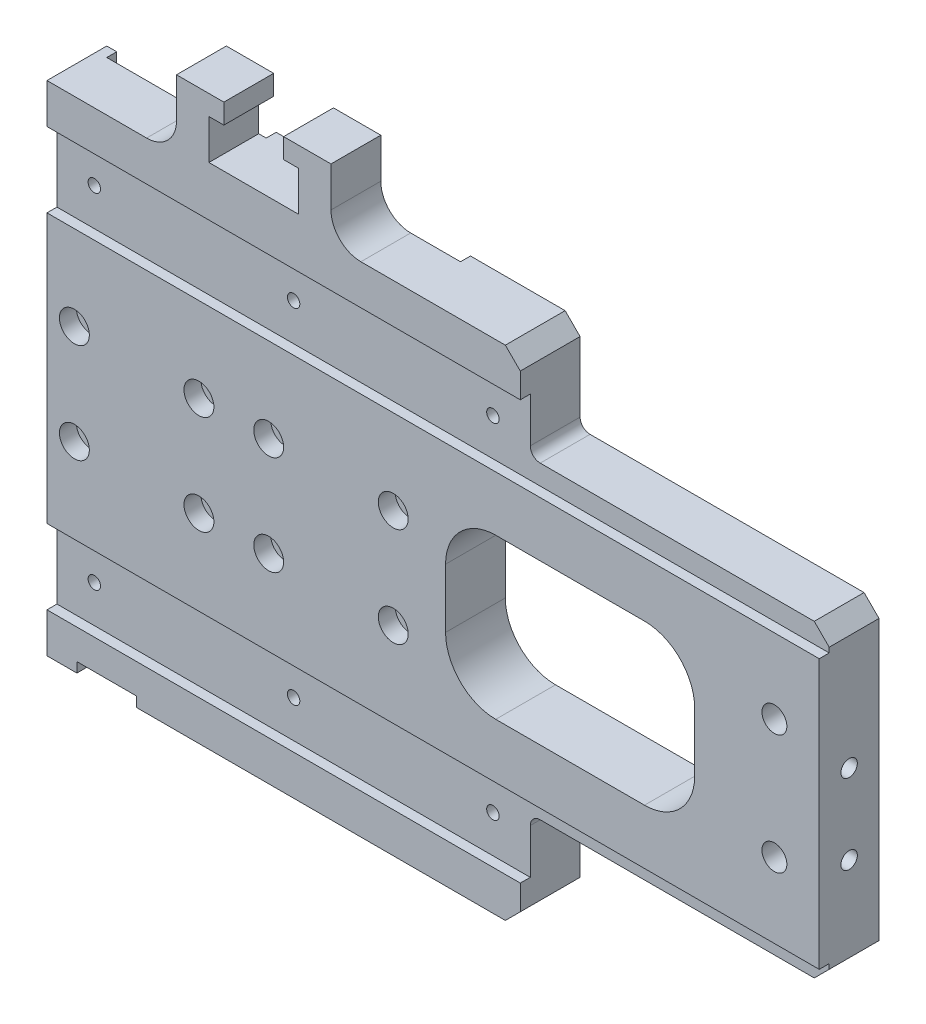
ISO-10303-21;
HEADER;
FILE_DESCRIPTION(('STEP AP214'),'2;1');
FILE_NAME('part.step','',(''),(''),'','','');
FILE_SCHEMA(('AUTOMOTIVE_DESIGN { 1 0 10303 214 1 1 1 1 }'));
ENDSEC;
DATA;
#1=APPLICATION_CONTEXT('core data for automotive mechanical design processes');
#2=APPLICATION_PROTOCOL_DEFINITION('international standard','automotive_design',2000,#1);
#3=PRODUCT_CONTEXT('',#1,'mechanical');
#4=PRODUCT('Part','Part','',(#3));
#5=PRODUCT_RELATED_PRODUCT_CATEGORY('part','',(#4));
#6=PRODUCT_DEFINITION_FORMATION('','',#4);
#7=PRODUCT_DEFINITION_CONTEXT('part definition',#1,'design');
#8=PRODUCT_DEFINITION('design','',#6,#7);
#9=PRODUCT_DEFINITION_SHAPE('','',#8);
#10=(LENGTH_UNIT() NAMED_UNIT(*) SI_UNIT(.MILLI.,.METRE.));
#11=(NAMED_UNIT(*) PLANE_ANGLE_UNIT() SI_UNIT($,.RADIAN.));
#12=(NAMED_UNIT(*) SI_UNIT($,.STERADIAN.) SOLID_ANGLE_UNIT());
#13=UNCERTAINTY_MEASURE_WITH_UNIT(LENGTH_MEASURE(1.E-05),#10,'distance_accuracy_value','');
#14=(GEOMETRIC_REPRESENTATION_CONTEXT(3) GLOBAL_UNCERTAINTY_ASSIGNED_CONTEXT((#13)) GLOBAL_UNIT_ASSIGNED_CONTEXT((#10,
#11,#12)) REPRESENTATION_CONTEXT('',''));
#15=CARTESIAN_POINT('',(0.,0.,0.));
#16=DIRECTION('',(0.,0.,1.));
#17=DIRECTION('',(1.,0.,0.));
#18=AXIS2_PLACEMENT_3D('',#15,#16,#17);
#19=CARTESIAN_POINT('',(-99.7970110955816,-85.6360584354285,12.));
#20=DIRECTION('',(0.,1.,0.));
#21=DIRECTION('',(0.,0.,1.));
#22=AXIS2_PLACEMENT_3D('',#19,#20,#21);
#23=PLANE('',#22);
#24=DIRECTION('',(1.,0.,0.));
#25=VECTOR('',#24,1.);
#26=CARTESIAN_POINT('',(-65.7970110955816,-85.6360584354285,2.));
#27=LINE('',#26,#25);
#28=CARTESIAN_POINT('',(-97.7970110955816,-85.6360584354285,2.));
#29=VERTEX_POINT('',#28);
#30=CARTESIAN_POINT('',(-93.7970110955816,-85.6360584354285,2.));
#31=VERTEX_POINT('',#30);
#32=EDGE_CURVE('E706',#29,#31,#27,.T.);
#33=ORIENTED_EDGE('',*,*,#32,.T.);
#34=DIRECTION('',(0.,0.,1.));
#35=VECTOR('',#34,1.);
#36=CARTESIAN_POINT('',(-93.7970110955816,-85.6360584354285,0.));
#37=LINE('',#36,#35);
#38=CARTESIAN_POINT('',(-93.7970110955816,-85.6360584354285,12.));
#39=VERTEX_POINT('',#38);
#40=EDGE_CURVE('E554',#31,#39,#37,.T.);
#41=ORIENTED_EDGE('',*,*,#40,.T.);
#42=DIRECTION('',(1.,0.,0.));
#43=VECTOR('',#42,1.);
#44=CARTESIAN_POINT('',(-99.7970110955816,-85.6360584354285,12.));
#45=LINE('',#44,#43);
#46=CARTESIAN_POINT('',(-99.7970110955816,-85.6360584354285,12.));
#47=VERTEX_POINT('',#46);
#48=EDGE_CURVE('E803',#47,#39,#45,.T.);
#49=ORIENTED_EDGE('',*,*,#48,.F.);
#50=DIRECTION('',(0.,0.,-1.));
#51=VECTOR('',#50,1.);
#52=CARTESIAN_POINT('',(-99.7970110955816,-85.6360584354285,12.));
#53=LINE('',#52,#51);
#54=CARTESIAN_POINT('',(-99.7970110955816,-85.6360584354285,0.));
#55=VERTEX_POINT('',#54);
#56=EDGE_CURVE('E1137',#47,#55,#53,.T.);
#57=ORIENTED_EDGE('',*,*,#56,.T.);
#58=DIRECTION('',(1.,0.,0.));
#59=VECTOR('',#58,1.);
#60=CARTESIAN_POINT('',(-99.7970110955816,-85.6360584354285,0.));
#61=LINE('',#60,#59);
#62=CARTESIAN_POINT('',(-97.7970110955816,-85.6360584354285,0.));
#63=VERTEX_POINT('',#62);
#64=EDGE_CURVE('E1205',#55,#63,#61,.T.);
#65=ORIENTED_EDGE('',*,*,#64,.T.);
#66=DIRECTION('',(0.,0.,1.));
#67=VECTOR('',#66,1.);
#68=CARTESIAN_POINT('',(-97.7970110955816,-85.6360584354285,0.));
#69=LINE('',#68,#67);
#70=EDGE_CURVE('E701',#63,#29,#69,.T.);
#71=ORIENTED_EDGE('',*,*,#70,.T.);
#72=EDGE_LOOP('',(#33,#41,#49,#57,#65,#71));
#73=FACE_BOUND('',#72,.T.);
#74=ADVANCED_FACE('F16',(#73),#23,.F.);
#75=CARTESIAN_POINT('',(0.,0.,0.));
#76=DIRECTION('',(0.,0.,1.));
#77=DIRECTION('',(1.,0.,0.));
#78=AXIS2_PLACEMENT_3D('',#75,#76,#77);
#79=PLANE('',#78);
#80=DIRECTION('',(0.,1.,0.));
#81=VECTOR('',#80,1.);
#82=CARTESIAN_POINT('',(-65.7970110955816,-85.6360584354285,0.));
#83=LINE('',#82,#81);
#84=CARTESIAN_POINT('',(-65.7970110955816,-85.6360584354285,0.));
#85=VERTEX_POINT('',#84);
#86=CARTESIAN_POINT('',(-65.7970110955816,16.3639415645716,0.));
#87=VERTEX_POINT('',#86);
#88=EDGE_CURVE('E709',#85,#87,#83,.T.);
#89=ORIENTED_EDGE('',*,*,#88,.T.);
#90=DIRECTION('',(1.,0.,0.));
#91=VECTOR('',#90,1.);
#92=CARTESIAN_POINT('',(-67.2970110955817,16.3639415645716,0.));
#93=LINE('',#92,#91);
#94=CARTESIAN_POINT('',(-58.7970110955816,16.3639415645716,0.));
#95=VERTEX_POINT('',#94);
#96=EDGE_CURVE('E600',#87,#95,#93,.T.);
#97=ORIENTED_EDGE('',*,*,#96,.T.);
#98=DIRECTION('',(0.,1.,0.));
#99=VECTOR('',#98,1.);
#100=CARTESIAN_POINT('',(-58.7970110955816,-85.6360584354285,0.));
#101=LINE('',#100,#99);
#102=CARTESIAN_POINT('',(-58.7970110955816,-85.6360584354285,0.));
#103=VERTEX_POINT('',#102);
#104=EDGE_CURVE('E743',#103,#95,#101,.T.);
#105=ORIENTED_EDGE('',*,*,#104,.F.);
#106=EDGE_CURVE('E1214',#85,#103,#61,.T.);
#107=ORIENTED_EDGE('',*,*,#106,.F.);
#108=EDGE_LOOP('',(#89,#97,#105,#107));
#109=FACE_BOUND('',#108,.T.);
#110=ADVANCED_FACE('F978',(#109),#79,.F.);
#111=CARTESIAN_POINT('',(-65.7970110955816,-85.6360584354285,0.));
#112=DIRECTION('',(1.,0.,0.));
#113=DIRECTION('',(0.,0.,-1.));
#114=AXIS2_PLACEMENT_3D('',#111,#112,#113);
#115=PLANE('',#114);
#116=DIRECTION('',(0.,1.,0.));
#117=VECTOR('',#116,1.);
#118=CARTESIAN_POINT('',(-65.7970110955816,-85.6360584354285,2.));
#119=LINE('',#118,#117);
#120=CARTESIAN_POINT('',(-65.7970110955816,-85.6360584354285,2.));
#121=VERTEX_POINT('',#120);
#122=CARTESIAN_POINT('',(-65.7970110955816,16.3639415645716,2.));
#123=VERTEX_POINT('',#122);
#124=EDGE_CURVE('E714',#121,#123,#119,.T.);
#125=ORIENTED_EDGE('',*,*,#124,.T.);
#126=DIRECTION('',(0.,0.,-1.));
#127=VECTOR('',#126,1.);
#128=CARTESIAN_POINT('',(-65.7970110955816,16.3639415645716,0.));
#129=LINE('',#128,#127);
#130=EDGE_CURVE('E639',#123,#87,#129,.T.);
#131=ORIENTED_EDGE('',*,*,#130,.T.);
#132=ORIENTED_EDGE('',*,*,#88,.F.);
#133=DIRECTION('',(0.,0.,-1.));
#134=VECTOR('',#133,1.);
#135=CARTESIAN_POINT('',(-65.7970110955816,-85.6360584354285,0.));
#136=LINE('',#135,#134);
#137=EDGE_CURVE('E698',#121,#85,#136,.T.);
#138=ORIENTED_EDGE('',*,*,#137,.F.);
#139=EDGE_LOOP('',(#125,#131,#132,#138));
#140=FACE_BOUND('',#139,.T.);
#141=ADVANCED_FACE('F987',(#140),#115,.F.);
#142=CARTESIAN_POINT('',(-73.7970110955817,28.3639415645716,0.));
#143=DIRECTION('',(0.,1.,0.));
#144=DIRECTION('',(0.,0.,1.));
#145=AXIS2_PLACEMENT_3D('',#142,#143,#144);
#146=PLANE('',#145);
#147=DIRECTION('',(0.,0.,1.));
#148=VECTOR('',#147,1.);
#149=CARTESIAN_POINT('',(-64.2970110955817,28.3639415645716,0.));
#150=LINE('',#149,#148);
#151=CARTESIAN_POINT('',(-64.2970110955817,28.3639415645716,2.));
#152=VERTEX_POINT('',#151);
#153=CARTESIAN_POINT('',(-64.2970110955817,28.3639415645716,12.));
#154=VERTEX_POINT('',#153);
#155=EDGE_CURVE('E632',#152,#154,#150,.T.);
#156=ORIENTED_EDGE('',*,*,#155,.F.);
#157=DIRECTION('',(1.,0.,0.));
#158=VECTOR('',#157,1.);
#159=CARTESIAN_POINT('',(-73.7970110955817,28.3639415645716,2.));
#160=LINE('',#159,#158);
#161=CARTESIAN_POINT('',(-73.7970110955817,28.3639415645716,2.));
#162=VERTEX_POINT('',#161);
#163=EDGE_CURVE('E1064',#162,#152,#160,.T.);
#164=ORIENTED_EDGE('',*,*,#163,.F.);
#165=DIRECTION('',(0.,0.,1.));
#166=VECTOR('',#165,1.);
#167=CARTESIAN_POINT('',(-73.7970110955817,28.3639415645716,0.));
#168=LINE('',#167,#166);
#169=CARTESIAN_POINT('',(-73.7970110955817,28.3639415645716,12.));
#170=VERTEX_POINT('',#169);
#171=EDGE_CURVE('E659',#162,#170,#168,.T.);
#172=ORIENTED_EDGE('',*,*,#171,.T.);
#173=DIRECTION('',(-1.,0.,0.));
#174=VECTOR('',#173,1.);
#175=CARTESIAN_POINT('',(-73.7970110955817,28.3639415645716,12.));
#176=LINE('',#175,#174);
#177=EDGE_CURVE('E658',#154,#170,#176,.T.);
#178=ORIENTED_EDGE('',*,*,#177,.F.);
#179=EDGE_LOOP('',(#156,#164,#172,#178));
#180=FACE_BOUND('',#179,.T.);
#181=ADVANCED_FACE('F954',(#180),#146,.T.);
#182=CARTESIAN_POINT('',(-99.7970110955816,14.3639415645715,12.));
#183=DIRECTION('',(0.,-1.,0.));
#184=DIRECTION('',(0.,0.,-1.));
#185=AXIS2_PLACEMENT_3D('',#182,#183,#184);
#186=PLANE('',#185);
#187=DIRECTION('',(-1.,0.,0.));
#188=VECTOR('',#187,1.);
#189=CARTESIAN_POINT('',(-99.7970110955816,14.3639415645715,12.));
#190=LINE('',#189,#188);
#191=CARTESIAN_POINT('',(-79.7970110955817,14.3639415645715,12.));
#192=VERTEX_POINT('',#191);
#193=CARTESIAN_POINT('',(-99.7970110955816,14.3639415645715,12.));
#194=VERTEX_POINT('',#193);
#195=EDGE_CURVE('E808',#192,#194,#190,.T.);
#196=ORIENTED_EDGE('',*,*,#195,.F.);
#197=DIRECTION('',(0.,0.,1.));
#198=VECTOR('',#197,1.);
#199=CARTESIAN_POINT('',(-79.7970110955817,14.3639415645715,12.));
#200=LINE('',#199,#198);
#201=CARTESIAN_POINT('',(-79.7970110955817,14.3639415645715,2.));
#202=VERTEX_POINT('',#201);
#203=EDGE_CURVE('E1091',#192,#202,#200,.F.);
#204=ORIENTED_EDGE('',*,*,#203,.T.);
#205=DIRECTION('',(1.,0.,0.));
#206=VECTOR('',#205,1.);
#207=CARTESIAN_POINT('',(-65.7970110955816,14.3639415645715,2.));
#208=LINE('',#207,#206);
#209=CARTESIAN_POINT('',(-97.7970110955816,14.3639415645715,2.));
#210=VERTEX_POINT('',#209);
#211=EDGE_CURVE('E702',#210,#202,#208,.T.);
#212=ORIENTED_EDGE('',*,*,#211,.F.);
#213=DIRECTION('',(0.,0.,1.));
#214=VECTOR('',#213,1.);
#215=CARTESIAN_POINT('',(-97.7970110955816,14.3639415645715,0.));
#216=LINE('',#215,#214);
#217=CARTESIAN_POINT('',(-97.7970110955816,14.3639415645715,0.));
#218=VERTEX_POINT('',#217);
#219=EDGE_CURVE('E697',#218,#210,#216,.T.);
#220=ORIENTED_EDGE('',*,*,#219,.F.);
#221=DIRECTION('',(-1.,0.,0.));
#222=VECTOR('',#221,1.);
#223=CARTESIAN_POINT('',(-99.7970110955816,14.3639415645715,0.));
#224=LINE('',#223,#222);
#225=CARTESIAN_POINT('',(-99.7970110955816,14.3639415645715,0.));
#226=VERTEX_POINT('',#225);
#227=EDGE_CURVE('E1130',#218,#226,#224,.T.);
#228=ORIENTED_EDGE('',*,*,#227,.T.);
#229=DIRECTION('',(0.,0.,-1.));
#230=VECTOR('',#229,1.);
#231=CARTESIAN_POINT('',(-99.7970110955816,14.3639415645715,12.));
#232=LINE('',#231,#230);
#233=EDGE_CURVE('E821',#194,#226,#232,.T.);
#234=ORIENTED_EDGE('',*,*,#233,.F.);
#235=EDGE_LOOP('',(#196,#204,#212,#220,#228,#234));
#236=FACE_BOUND('',#235,.T.);
#237=ADVANCED_FACE('F1254',(#236),#186,.F.);
#238=DIRECTION('',(1.,0.,0.));
#239=VECTOR('',#238,1.);
#240=CARTESIAN_POINT('',(20.1318653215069,-19.6360584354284,0.));
#241=LINE('',#240,#239);
#242=CARTESIAN_POINT('',(-9.7258875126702,-19.6360584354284,0.));
#243=VERTEX_POINT('',#242);
#244=CARTESIAN_POINT('',(20.1318653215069,-19.6360584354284,0.));
#245=VERTEX_POINT('',#244);
#246=EDGE_CURVE('E419',#243,#245,#241,.T.);
#247=ORIENTED_EDGE('',*,*,#246,.F.);
#248=CARTESIAN_POINT('',(-9.72588751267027,-29.7071820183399,0.));
#249=DIRECTION('',(0.,0.,-1.));
#250=DIRECTION('',(1.,0.,0.));
#251=AXIS2_PLACEMENT_3D('',#248,#249,#250);
#252=CIRCLE('',#251,10.0711235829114);
#253=CARTESIAN_POINT('',(-19.7970110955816,-29.7071820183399,0.));
#254=VERTEX_POINT('',#253);
#255=EDGE_CURVE('E33',#254,#243,#252,.T.);
#256=ORIENTED_EDGE('',*,*,#255,.F.);
#257=DIRECTION('',(0.,1.,0.));
#258=VECTOR('',#257,1.);
#259=CARTESIAN_POINT('',(-19.7970110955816,-29.7071820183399,0.));
#260=LINE('',#259,#258);
#261=CARTESIAN_POINT('',(-19.7970110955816,-41.564934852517,0.));
#262=VERTEX_POINT('',#261);
#263=EDGE_CURVE('E399',#262,#254,#260,.T.);
#264=ORIENTED_EDGE('',*,*,#263,.F.);
#265=CARTESIAN_POINT('',(-9.72588751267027,-41.5649348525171,0.));
#266=DIRECTION('',(0.,0.,-1.));
#267=DIRECTION('',(1.,0.,0.));
#268=AXIS2_PLACEMENT_3D('',#265,#266,#267);
#269=CIRCLE('',#268,10.0711235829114);
#270=CARTESIAN_POINT('',(-9.7258875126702,-51.6360584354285,0.));
#271=VERTEX_POINT('',#270);
#272=EDGE_CURVE('E402',#271,#262,#269,.T.);
#273=ORIENTED_EDGE('',*,*,#272,.F.);
#274=DIRECTION('',(-1.,0.,0.));
#275=VECTOR('',#274,1.);
#276=CARTESIAN_POINT('',(20.1318653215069,-51.6360584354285,0.));
#277=LINE('',#276,#275);
#278=CARTESIAN_POINT('',(20.1318653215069,-51.6360584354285,0.));
#279=VERTEX_POINT('',#278);
#280=EDGE_CURVE('E430',#279,#271,#277,.T.);
#281=ORIENTED_EDGE('',*,*,#280,.F.);
#282=CARTESIAN_POINT('',(20.131865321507,-41.5649348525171,0.));
#283=DIRECTION('',(0.,0.,-1.));
#284=DIRECTION('',(1.,0.,0.));
#285=AXIS2_PLACEMENT_3D('',#282,#283,#284);
#286=CIRCLE('',#285,10.0711235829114);
#287=CARTESIAN_POINT('',(30.2029889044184,-41.564934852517,0.));
#288=VERTEX_POINT('',#287);
#289=EDGE_CURVE('E427',#288,#279,#286,.T.);
#290=ORIENTED_EDGE('',*,*,#289,.F.);
#291=DIRECTION('',(0.,-1.,0.));
#292=VECTOR('',#291,1.);
#293=CARTESIAN_POINT('',(30.2029889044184,-29.7071820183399,0.));
#294=LINE('',#293,#292);
#295=CARTESIAN_POINT('',(30.2029889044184,-29.7071820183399,0.));
#296=VERTEX_POINT('',#295);
#297=EDGE_CURVE('E424',#296,#288,#294,.T.);
#298=ORIENTED_EDGE('',*,*,#297,.F.);
#299=CARTESIAN_POINT('',(20.131865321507,-29.7071820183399,0.));
#300=DIRECTION('',(0.,0.,-1.));
#301=DIRECTION('',(1.,0.,0.));
#302=AXIS2_PLACEMENT_3D('',#299,#300,#301);
#303=CIRCLE('',#302,10.0711235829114);
#304=EDGE_CURVE('E421',#245,#296,#303,.T.);
#305=ORIENTED_EDGE('',*,*,#304,.F.);
#306=EDGE_LOOP('',(#247,#256,#264,#273,#281,#290,#298,#305));
#307=FACE_BOUND('',#306,.T.);
#308=CARTESIAN_POINT('',(-12.2970110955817,-1.1360584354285,0.));
#309=DIRECTION('',(0.,0.,1.));
#310=DIRECTION('',(1.,0.,0.));
#311=AXIS2_PLACEMENT_3D('',#308,#309,#310);
#312=CIRCLE('',#311,1.25);
#313=CARTESIAN_POINT('',(-11.0470110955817,-1.1360584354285,0.));
#314=VERTEX_POINT('',#313);
#315=EDGE_CURVE('E566',#314,#314,#312,.T.);
#316=ORIENTED_EDGE('',*,*,#315,.T.);
#317=EDGE_LOOP('',(#316));
#318=FACE_BOUND('',#317,.T.);
#319=CARTESIAN_POINT('',(-12.2970110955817,-70.1360584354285,0.));
#320=DIRECTION('',(0.,0.,1.));
#321=DIRECTION('',(1.,0.,0.));
#322=AXIS2_PLACEMENT_3D('',#319,#320,#321);
#323=CIRCLE('',#322,1.25);
#324=CARTESIAN_POINT('',(-11.0470110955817,-70.1360584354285,0.));
#325=VERTEX_POINT('',#324);
#326=EDGE_CURVE('E584',#325,#325,#323,.T.);
#327=ORIENTED_EDGE('',*,*,#326,.T.);
#328=EDGE_LOOP('',(#327));
#329=FACE_BOUND('',#328,.T.);
#330=CARTESIAN_POINT('',(46.2029889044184,-23.6360584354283,0.));
#331=DIRECTION('',(0.,0.,1.));
#332=DIRECTION('',(1.,0.,0.));
#333=AXIS2_PLACEMENT_3D('',#330,#331,#332);
#334=CIRCLE('',#333,2.5);
#335=CARTESIAN_POINT('',(48.7029889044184,-23.6360584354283,0.));
#336=VERTEX_POINT('',#335);
#337=EDGE_CURVE('E667',#336,#336,#334,.T.);
#338=ORIENTED_EDGE('',*,*,#337,.T.);
#339=EDGE_LOOP('',(#338));
#340=FACE_BOUND('',#339,.T.);
#341=CARTESIAN_POINT('',(46.2029889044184,-47.6360584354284,0.));
#342=DIRECTION('',(0.,0.,1.));
#343=DIRECTION('',(1.,0.,0.));
#344=AXIS2_PLACEMENT_3D('',#341,#342,#343);
#345=CIRCLE('',#344,2.5);
#346=CARTESIAN_POINT('',(48.7029889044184,-47.6360584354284,0.));
#347=VERTEX_POINT('',#346);
#348=EDGE_CURVE('E673',#347,#347,#345,.T.);
#349=ORIENTED_EDGE('',*,*,#348,.T.);
#350=EDGE_LOOP('',(#349));
#351=FACE_BOUND('',#350,.T.);
#352=DIRECTION('',(0.,-1.,0.));
#353=VECTOR('',#352,1.);
#354=CARTESIAN_POINT('',(-4.79701109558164,-85.6360584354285,0.));
#355=LINE('',#354,#353);
#356=CARTESIAN_POINT('',(-4.79701109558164,-68.6360584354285,0.));
#357=VERTEX_POINT('',#356);
#358=CARTESIAN_POINT('',(-4.79701109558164,-82.6360584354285,0.));
#359=VERTEX_POINT('',#358);
#360=EDGE_CURVE('E679',#357,#359,#355,.T.);
#361=ORIENTED_EDGE('',*,*,#360,.T.);
#362=DIRECTION('',(0.707106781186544,0.707106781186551,0.));
#363=VECTOR('',#362,1.);
#364=CARTESIAN_POINT('',(-7.79701109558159,-85.6360584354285,0.));
#365=LINE('',#364,#363);
#366=CARTESIAN_POINT('',(-7.7970110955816,-85.6360584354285,0.));
#367=VERTEX_POINT('',#366);
#368=EDGE_CURVE('E1039',#359,#367,#365,.F.);
#369=ORIENTED_EDGE('',*,*,#368,.T.);
#370=CARTESIAN_POINT('',(-26.7970110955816,-85.6360584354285,0.));
#371=VERTEX_POINT('',#370);
#372=EDGE_CURVE('E1220',#371,#367,#61,.T.);
#373=ORIENTED_EDGE('',*,*,#372,.F.);
#374=DIRECTION('',(0.,1.,0.));
#375=VECTOR('',#374,1.);
#376=CARTESIAN_POINT('',(-26.7970110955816,-85.6360584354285,0.));
#377=LINE('',#376,#375);
#378=CARTESIAN_POINT('',(-26.7970110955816,14.3639415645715,0.));
#379=VERTEX_POINT('',#378);
#380=EDGE_CURVE('E732',#371,#379,#377,.T.);
#381=ORIENTED_EDGE('',*,*,#380,.T.);
#382=CARTESIAN_POINT('',(-7.79701109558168,14.3639415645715,0.));
#383=VERTEX_POINT('',#382);
#384=EDGE_CURVE('E1128',#383,#379,#224,.T.);
#385=ORIENTED_EDGE('',*,*,#384,.F.);
#386=DIRECTION('',(-0.70710678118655,0.707106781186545,0.));
#387=VECTOR('',#386,1.);
#388=CARTESIAN_POINT('',(-4.79701109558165,11.3639415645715,0.));
#389=LINE('',#388,#387);
#390=CARTESIAN_POINT('',(-4.79701109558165,11.3639415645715,0.));
#391=VERTEX_POINT('',#390);
#392=EDGE_CURVE('E1037',#383,#391,#389,.F.);
#393=ORIENTED_EDGE('',*,*,#392,.T.);
#394=DIRECTION('',(0.,-1.,0.));
#395=VECTOR('',#394,1.);
#396=CARTESIAN_POINT('',(-4.79701109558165,14.3639415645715,0.));
#397=LINE('',#396,#395);
#398=CARTESIAN_POINT('',(-4.79701109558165,-2.63605843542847,0.));
#399=VERTEX_POINT('',#398);
#400=EDGE_CURVE('E688',#391,#399,#397,.T.);
#401=ORIENTED_EDGE('',*,*,#400,.T.);
#402=CARTESIAN_POINT('',(-2.79701109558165,-2.63605843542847,0.));
#403=DIRECTION('',(0.,0.,1.));
#404=DIRECTION('',(1.,0.,0.));
#405=AXIS2_PLACEMENT_3D('',#402,#403,#404);
#406=CIRCLE('',#405,2.);
#407=CARTESIAN_POINT('',(-2.79701109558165,-4.63605843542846,0.));
#408=VERTEX_POINT('',#407);
#409=EDGE_CURVE('E1126',#399,#408,#406,.T.);
#410=ORIENTED_EDGE('',*,*,#409,.T.);
#411=DIRECTION('',(1.,0.,0.));
#412=VECTOR('',#411,1.);
#413=CARTESIAN_POINT('',(55.2029889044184,-4.63605843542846,0.));
#414=LINE('',#413,#412);
#415=CARTESIAN_POINT('',(52.2029889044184,-4.63605843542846,0.));
#416=VERTEX_POINT('',#415);
#417=EDGE_CURVE('E690',#408,#416,#414,.T.);
#418=ORIENTED_EDGE('',*,*,#417,.T.);
#419=DIRECTION('',(-0.707106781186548,0.707106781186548,0.));
#420=VECTOR('',#419,1.);
#421=CARTESIAN_POINT('',(55.2029889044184,-7.63605843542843,0.));
#422=LINE('',#421,#420);
#423=CARTESIAN_POINT('',(55.2029889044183,-7.63605843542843,0.));
#424=VERTEX_POINT('',#423);
#425=EDGE_CURVE('E1028',#416,#424,#422,.F.);
#426=ORIENTED_EDGE('',*,*,#425,.T.);
#427=DIRECTION('',(0.,1.,0.));
#428=VECTOR('',#427,1.);
#429=CARTESIAN_POINT('',(55.2029889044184,14.3639415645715,0.));
#430=LINE('',#429,#428);
#431=CARTESIAN_POINT('',(55.2029889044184,-63.6360584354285,0.));
#432=VERTEX_POINT('',#431);
#433=EDGE_CURVE('E1132',#432,#424,#430,.T.);
#434=ORIENTED_EDGE('',*,*,#433,.F.);
#435=DIRECTION('',(0.707106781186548,0.707106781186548,0.));
#436=VECTOR('',#435,1.);
#437=CARTESIAN_POINT('',(52.2029889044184,-66.6360584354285,0.));
#438=LINE('',#437,#436);
#439=CARTESIAN_POINT('',(52.2029889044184,-66.6360584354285,0.));
#440=VERTEX_POINT('',#439);
#441=EDGE_CURVE('E1035',#432,#440,#438,.F.);
#442=ORIENTED_EDGE('',*,*,#441,.T.);
#443=DIRECTION('',(-1.,0.,0.));
#444=VECTOR('',#443,1.);
#445=CARTESIAN_POINT('',(55.2029889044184,-66.6360584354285,0.));
#446=LINE('',#445,#444);
#447=CARTESIAN_POINT('',(-2.79701109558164,-66.6360584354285,0.));
#448=VERTEX_POINT('',#447);
#449=EDGE_CURVE('E677',#440,#448,#446,.T.);
#450=ORIENTED_EDGE('',*,*,#449,.T.);
#451=CARTESIAN_POINT('',(-2.79701109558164,-68.6360584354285,0.));
#452=DIRECTION('',(0.,0.,1.));
#453=DIRECTION('',(1.,0.,0.));
#454=AXIS2_PLACEMENT_3D('',#451,#452,#453);
#455=CIRCLE('',#454,2.);
#456=EDGE_CURVE('E1030',#448,#357,#455,.T.);
#457=ORIENTED_EDGE('',*,*,#456,.T.);
#458=EDGE_LOOP('',(#361,#369,#373,#381,#385,#393,#401,#410,#418,#426,#434,#442,#450,#457));
#459=FACE_BOUND('',#458,.T.);
#460=ADVANCED_FACE('F990',(#307,#318,#329,#340,#351,#459),#79,.F.);
#461=CARTESIAN_POINT('',(0.,0.,12.));
#462=DIRECTION('',(0.,0.,1.));
#463=DIRECTION('',(1.,0.,0.));
#464=AXIS2_PLACEMENT_3D('',#461,#462,#463);
#465=PLANE('',#464);
#466=DIRECTION('',(0.,-1.,0.));
#467=VECTOR('',#466,1.);
#468=CARTESIAN_POINT('',(-93.7970110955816,-85.6360584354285,12.));
#469=LINE('',#468,#467);
#470=CARTESIAN_POINT('',(-93.7970110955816,-83.6360584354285,12.));
#471=VERTEX_POINT('',#470);
#472=EDGE_CURVE('E546',#471,#39,#469,.T.);
#473=ORIENTED_EDGE('',*,*,#472,.F.);
#474=DIRECTION('',(-1.,0.,0.));
#475=VECTOR('',#474,1.);
#476=CARTESIAN_POINT('',(-93.7970110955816,-83.6360584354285,12.));
#477=LINE('',#476,#475);
#478=CARTESIAN_POINT('',(-81.7970110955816,-83.6360584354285,12.));
#479=VERTEX_POINT('',#478);
#480=EDGE_CURVE('E551',#479,#471,#477,.T.);
#481=ORIENTED_EDGE('',*,*,#480,.F.);
#482=DIRECTION('',(0.,1.,0.));
#483=VECTOR('',#482,1.);
#484=CARTESIAN_POINT('',(-81.7970110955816,-85.6360584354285,12.));
#485=LINE('',#484,#483);
#486=CARTESIAN_POINT('',(-81.7970110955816,-85.6360584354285,12.));
#487=VERTEX_POINT('',#486);
#488=EDGE_CURVE('E548',#487,#479,#485,.T.);
#489=ORIENTED_EDGE('',*,*,#488,.F.);
#490=CARTESIAN_POINT('',(-7.79701109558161,-85.6360584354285,12.));
#491=VERTEX_POINT('',#490);
#492=EDGE_CURVE('E800',#487,#491,#45,.T.);
#493=ORIENTED_EDGE('',*,*,#492,.T.);
#494=DIRECTION('',(-0.707106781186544,-0.707106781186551,0.));
#495=VECTOR('',#494,1.);
#496=CARTESIAN_POINT('',(38.9195236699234,-38.9195236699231,12.));
#497=LINE('',#496,#495);
#498=CARTESIAN_POINT('',(-4.79701109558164,-82.6360584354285,12.));
#499=VERTEX_POINT('',#498);
#500=EDGE_CURVE('E1020',#491,#499,#497,.F.);
#501=ORIENTED_EDGE('',*,*,#500,.T.);
#502=DIRECTION('',(0.,-1.,0.));
#503=VECTOR('',#502,1.);
#504=CARTESIAN_POINT('',(-4.79701109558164,-85.6360584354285,12.));
#505=LINE('',#504,#503);
#506=CARTESIAN_POINT('',(-4.79701109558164,-77.6360584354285,12.));
#507=VERTEX_POINT('',#506);
#508=EDGE_CURVE('E676',#507,#499,#505,.T.);
#509=ORIENTED_EDGE('',*,*,#508,.F.);
#510=DIRECTION('',(1.,0.,0.));
#511=VECTOR('',#510,1.);
#512=CARTESIAN_POINT('',(-99.7970110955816,-77.6360584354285,12.));
#513=LINE('',#512,#511);
#514=CARTESIAN_POINT('',(-99.7970110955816,-77.6360584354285,12.));
#515=VERTEX_POINT('',#514);
#516=EDGE_CURVE('E759',#515,#507,#513,.T.);
#517=ORIENTED_EDGE('',*,*,#516,.F.);
#518=DIRECTION('',(0.,-1.,0.));
#519=VECTOR('',#518,1.);
#520=CARTESIAN_POINT('',(-99.7970110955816,14.3639415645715,12.));
#521=LINE('',#520,#519);
#522=EDGE_CURVE('E802',#515,#47,#521,.T.);
#523=ORIENTED_EDGE('',*,*,#522,.T.);
#524=ORIENTED_EDGE('',*,*,#48,.T.);
#525=EDGE_LOOP('',(#473,#481,#489,#493,#501,#509,#517,#523,#524));
#526=FACE_BOUND('',#525,.T.);
#527=ADVANCED_FACE('F1018',(#526),#465,.T.);
#528=DIRECTION('',(0.,-1.,0.));
#529=VECTOR('',#528,1.);
#530=CARTESIAN_POINT('',(-64.2970110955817,28.3639415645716,12.));
#531=LINE('',#530,#529);
#532=CARTESIAN_POINT('',(-64.2970110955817,24.3639415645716,12.));
#533=VERTEX_POINT('',#532);
#534=EDGE_CURVE('E612',#154,#533,#531,.T.);
#535=ORIENTED_EDGE('',*,*,#534,.F.);
#536=ORIENTED_EDGE('',*,*,#177,.T.);
#537=DIRECTION('',(0.,-1.,0.));
#538=VECTOR('',#537,1.);
#539=CARTESIAN_POINT('',(-73.7970110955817,14.3639415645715,12.));
#540=LINE('',#539,#538);
#541=CARTESIAN_POINT('',(-73.7970110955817,20.3639415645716,12.));
#542=VERTEX_POINT('',#541);
#543=EDGE_CURVE('E653',#170,#542,#540,.T.);
#544=ORIENTED_EDGE('',*,*,#543,.T.);
#545=CARTESIAN_POINT('',(-79.7970110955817,20.3639415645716,12.));
#546=DIRECTION('',(0.,0.,1.));
#547=DIRECTION('',(1.,0.,0.));
#548=AXIS2_PLACEMENT_3D('',#545,#546,#547);
#549=CIRCLE('',#548,6.);
#550=EDGE_CURVE('E835',#542,#192,#549,.F.);
#551=ORIENTED_EDGE('',*,*,#550,.T.);
#552=ORIENTED_EDGE('',*,*,#195,.T.);
#553=CARTESIAN_POINT('',(-99.7970110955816,6.36394156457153,12.));
#554=VERTEX_POINT('',#553);
#555=EDGE_CURVE('E797',#194,#554,#521,.T.);
#556=ORIENTED_EDGE('',*,*,#555,.T.);
#557=DIRECTION('',(1.,0.,0.));
#558=VECTOR('',#557,1.);
#559=CARTESIAN_POINT('',(-99.7970110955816,6.36394156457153,12.));
#560=LINE('',#559,#558);
#561=CARTESIAN_POINT('',(-4.79701109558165,6.36394156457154,12.));
#562=VERTEX_POINT('',#561);
#563=EDGE_CURVE('E786',#554,#562,#560,.T.);
#564=ORIENTED_EDGE('',*,*,#563,.T.);
#565=DIRECTION('',(0.,-1.,0.));
#566=VECTOR('',#565,1.);
#567=CARTESIAN_POINT('',(-4.79701109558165,14.3639415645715,12.));
#568=LINE('',#567,#566);
#569=CARTESIAN_POINT('',(-4.79701109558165,11.3639415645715,12.));
#570=VERTEX_POINT('',#569);
#571=EDGE_CURVE('E687',#570,#562,#568,.T.);
#572=ORIENTED_EDGE('',*,*,#571,.F.);
#573=DIRECTION('',(0.70710678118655,-0.707106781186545,0.));
#574=VECTOR('',#573,1.);
#575=CARTESIAN_POINT('',(3.28346523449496,3.28346523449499,12.));
#576=LINE('',#575,#574);
#577=CARTESIAN_POINT('',(-7.79701109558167,14.3639415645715,12.));
#578=VERTEX_POINT('',#577);
#579=EDGE_CURVE('E1044',#570,#578,#576,.F.);
#580=ORIENTED_EDGE('',*,*,#579,.T.);
#581=CARTESIAN_POINT('',(-36.7970110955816,14.3639415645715,12.));
#582=VERTEX_POINT('',#581);
#583=EDGE_CURVE('E817',#578,#582,#190,.T.);
#584=ORIENTED_EDGE('',*,*,#583,.T.);
#585=CARTESIAN_POINT('',(-36.7970110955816,20.3639415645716,12.));
#586=DIRECTION('',(0.,0.,1.));
#587=DIRECTION('',(1.,0.,0.));
#588=AXIS2_PLACEMENT_3D('',#585,#586,#587);
#589=CIRCLE('',#588,6.);
#590=CARTESIAN_POINT('',(-42.7970110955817,20.3639415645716,12.));
#591=VERTEX_POINT('',#590);
#592=EDGE_CURVE('E839',#582,#591,#589,.F.);
#593=ORIENTED_EDGE('',*,*,#592,.T.);
#594=DIRECTION('',(0.,1.,0.));
#595=VECTOR('',#594,1.);
#596=CARTESIAN_POINT('',(-42.7970110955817,14.3639415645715,12.));
#597=LINE('',#596,#595);
#598=CARTESIAN_POINT('',(-42.7970110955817,28.3639415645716,12.));
#599=VERTEX_POINT('',#598);
#600=EDGE_CURVE('E828',#591,#599,#597,.T.);
#601=ORIENTED_EDGE('',*,*,#600,.T.);
#602=CARTESIAN_POINT('',(-52.2970110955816,28.3639415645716,12.));
#603=VERTEX_POINT('',#602);
#604=EDGE_CURVE('E654',#599,#603,#176,.T.);
#605=ORIENTED_EDGE('',*,*,#604,.T.);
#606=DIRECTION('',(0.,1.,0.));
#607=VECTOR('',#606,1.);
#608=CARTESIAN_POINT('',(-52.2970110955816,28.3639415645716,12.));
#609=LINE('',#608,#607);
#610=CARTESIAN_POINT('',(-52.2970110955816,24.3639415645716,12.));
#611=VERTEX_POINT('',#610);
#612=EDGE_CURVE('E610',#611,#603,#609,.T.);
#613=ORIENTED_EDGE('',*,*,#612,.F.);
#614=DIRECTION('',(-1.,0.,0.));
#615=VECTOR('',#614,1.);
#616=CARTESIAN_POINT('',(-52.2970110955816,24.3639415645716,12.));
#617=LINE('',#616,#615);
#618=CARTESIAN_POINT('',(-49.2970110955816,24.3639415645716,12.));
#619=VERTEX_POINT('',#618);
#620=EDGE_CURVE('E607',#619,#611,#617,.T.);
#621=ORIENTED_EDGE('',*,*,#620,.F.);
#622=DIRECTION('',(0.,1.,0.));
#623=VECTOR('',#622,1.);
#624=CARTESIAN_POINT('',(-49.2970110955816,24.3639415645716,12.));
#625=LINE('',#624,#623);
#626=CARTESIAN_POINT('',(-49.2970110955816,16.3639415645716,12.));
#627=VERTEX_POINT('',#626);
#628=EDGE_CURVE('E599',#627,#619,#625,.T.);
#629=ORIENTED_EDGE('',*,*,#628,.F.);
#630=DIRECTION('',(1.,0.,0.));
#631=VECTOR('',#630,1.);
#632=CARTESIAN_POINT('',(-67.2970110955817,16.3639415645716,12.));
#633=LINE('',#632,#631);
#634=CARTESIAN_POINT('',(-67.2970110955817,16.3639415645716,12.));
#635=VERTEX_POINT('',#634);
#636=EDGE_CURVE('E604',#635,#627,#633,.T.);
#637=ORIENTED_EDGE('',*,*,#636,.F.);
#638=DIRECTION('',(0.,-1.,0.));
#639=VECTOR('',#638,1.);
#640=CARTESIAN_POINT('',(-67.2970110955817,24.3639415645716,12.));
#641=LINE('',#640,#639);
#642=CARTESIAN_POINT('',(-67.2970110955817,24.3639415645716,12.));
#643=VERTEX_POINT('',#642);
#644=EDGE_CURVE('E618',#643,#635,#641,.T.);
#645=ORIENTED_EDGE('',*,*,#644,.F.);
#646=DIRECTION('',(-1.,0.,0.));
#647=VECTOR('',#646,1.);
#648=CARTESIAN_POINT('',(-64.2970110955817,24.3639415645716,12.));
#649=LINE('',#648,#647);
#650=EDGE_CURVE('E615',#533,#643,#649,.T.);
#651=ORIENTED_EDGE('',*,*,#650,.F.);
#652=EDGE_LOOP('',(#535,#536,#544,#551,#552,#556,#564,#572,#580,#584,#593,#601,#605,#613,#621,
#629,#637,#645,#651));
#653=FACE_BOUND('',#652,.T.);
#654=ADVANCED_FACE('F1005',(#653),#465,.T.);
#655=CARTESIAN_POINT('',(-99.7970110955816,14.3639415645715,12.));
#656=DIRECTION('',(1.,0.,0.));
#657=DIRECTION('',(0.,1.,0.));
#658=AXIS2_PLACEMENT_3D('',#655,#656,#657);
#659=PLANE('',#658);
#660=ORIENTED_EDGE('',*,*,#522,.F.);
#661=DIRECTION('',(0.,0.,-1.));
#662=VECTOR('',#661,1.);
#663=CARTESIAN_POINT('',(-99.7970110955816,-77.6360584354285,12.));
#664=LINE('',#663,#662);
#665=CARTESIAN_POINT('',(-99.7970110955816,-77.6360584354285,10.));
#666=VERTEX_POINT('',#665);
#667=EDGE_CURVE('E746',#515,#666,#664,.T.);
#668=ORIENTED_EDGE('',*,*,#667,.T.);
#669=DIRECTION('',(0.,1.,0.));
#670=VECTOR('',#669,1.);
#671=CARTESIAN_POINT('',(-99.7970110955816,-77.6360584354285,10.));
#672=LINE('',#671,#670);
#673=CARTESIAN_POINT('',(-99.7970110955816,-62.6360584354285,10.));
#674=VERTEX_POINT('',#673);
#675=EDGE_CURVE('E749',#666,#674,#672,.T.);
#676=ORIENTED_EDGE('',*,*,#675,.T.);
#677=DIRECTION('',(0.,0.,1.));
#678=VECTOR('',#677,1.);
#679=CARTESIAN_POINT('',(-99.7970110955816,-62.6360584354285,12.));
#680=LINE('',#679,#678);
#681=CARTESIAN_POINT('',(-99.7970110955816,-62.6360584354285,12.));
#682=VERTEX_POINT('',#681);
#683=EDGE_CURVE('E753',#674,#682,#680,.T.);
#684=ORIENTED_EDGE('',*,*,#683,.T.);
#685=CARTESIAN_POINT('',(-99.7970110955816,-8.63605843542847,12.));
#686=VERTEX_POINT('',#685);
#687=EDGE_CURVE('E801',#686,#682,#521,.T.);
#688=ORIENTED_EDGE('',*,*,#687,.F.);
#689=DIRECTION('',(0.,0.,-1.));
#690=VECTOR('',#689,1.);
#691=CARTESIAN_POINT('',(-99.7970110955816,-8.63605843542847,12.));
#692=LINE('',#691,#690);
#693=CARTESIAN_POINT('',(-99.7970110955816,-8.63605843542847,10.));
#694=VERTEX_POINT('',#693);
#695=EDGE_CURVE('E771',#686,#694,#692,.T.);
#696=ORIENTED_EDGE('',*,*,#695,.T.);
#697=DIRECTION('',(0.,1.,0.));
#698=VECTOR('',#697,1.);
#699=CARTESIAN_POINT('',(-99.7970110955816,6.36394156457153,10.));
#700=LINE('',#699,#698);
#701=CARTESIAN_POINT('',(-99.7970110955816,6.36394156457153,10.));
#702=VERTEX_POINT('',#701);
#703=EDGE_CURVE('E774',#694,#702,#700,.T.);
#704=ORIENTED_EDGE('',*,*,#703,.T.);
#705=DIRECTION('',(0.,0.,1.));
#706=VECTOR('',#705,1.);
#707=CARTESIAN_POINT('',(-99.7970110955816,6.36394156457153,12.));
#708=LINE('',#707,#706);
#709=EDGE_CURVE('E778',#702,#554,#708,.T.);
#710=ORIENTED_EDGE('',*,*,#709,.T.);
#711=ORIENTED_EDGE('',*,*,#555,.F.);
#712=ORIENTED_EDGE('',*,*,#233,.T.);
#713=DIRECTION('',(0.,-1.,0.));
#714=VECTOR('',#713,1.);
#715=CARTESIAN_POINT('',(-99.7970110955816,14.3639415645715,0.));
#716=LINE('',#715,#714);
#717=EDGE_CURVE('E789',#226,#55,#716,.T.);
#718=ORIENTED_EDGE('',*,*,#717,.T.);
#719=ORIENTED_EDGE('',*,*,#56,.F.);
#720=EDGE_LOOP('',(#660,#668,#676,#684,#688,#696,#704,#710,#711,#712,#718,#719));
#721=FACE_BOUND('',#720,.T.);
#722=ADVANCED_FACE('F996',(#721),#659,.F.);
#723=ORIENTED_EDGE('',*,*,#492,.F.);
#724=DIRECTION('',(0.,0.,1.));
#725=VECTOR('',#724,1.);
#726=CARTESIAN_POINT('',(-81.7970110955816,-85.6360584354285,0.));
#727=LINE('',#726,#725);
#728=CARTESIAN_POINT('',(-81.7970110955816,-85.6360584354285,2.));
#729=VERTEX_POINT('',#728);
#730=EDGE_CURVE('E560',#729,#487,#727,.T.);
#731=ORIENTED_EDGE('',*,*,#730,.F.);
#732=EDGE_CURVE('E705',#729,#121,#27,.T.);
#733=ORIENTED_EDGE('',*,*,#732,.T.);
#734=ORIENTED_EDGE('',*,*,#137,.T.);
#735=ORIENTED_EDGE('',*,*,#106,.T.);
#736=DIRECTION('',(0.,0.,1.));
#737=VECTOR('',#736,1.);
#738=CARTESIAN_POINT('',(-58.7970110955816,-85.6360584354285,0.));
#739=LINE('',#738,#737);
#740=CARTESIAN_POINT('',(-58.7970110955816,-85.6360584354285,2.));
#741=VERTEX_POINT('',#740);
#742=EDGE_CURVE('E725',#103,#741,#739,.T.);
#743=ORIENTED_EDGE('',*,*,#742,.T.);
#744=DIRECTION('',(1.,0.,0.));
#745=VECTOR('',#744,1.);
#746=CARTESIAN_POINT('',(-26.7970110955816,-85.6360584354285,2.));
#747=LINE('',#746,#745);
#748=CARTESIAN_POINT('',(-26.7970110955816,-85.6360584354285,2.));
#749=VERTEX_POINT('',#748);
#750=EDGE_CURVE('E729',#741,#749,#747,.T.);
#751=ORIENTED_EDGE('',*,*,#750,.T.);
#752=DIRECTION('',(0.,0.,-1.));
#753=VECTOR('',#752,1.);
#754=CARTESIAN_POINT('',(-26.7970110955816,-85.6360584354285,0.));
#755=LINE('',#754,#753);
#756=EDGE_CURVE('E722',#749,#371,#755,.T.);
#757=ORIENTED_EDGE('',*,*,#756,.T.);
#758=ORIENTED_EDGE('',*,*,#372,.T.);
#759=DIRECTION('',(0.,0.,1.));
#760=VECTOR('',#759,1.);
#761=CARTESIAN_POINT('',(-7.79701109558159,-85.6360584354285,12.));
#762=LINE('',#761,#760);
#763=EDGE_CURVE('E1013',#367,#491,#762,.T.);
#764=ORIENTED_EDGE('',*,*,#763,.T.);
#765=EDGE_LOOP('',(#723,#731,#733,#734,#735,#743,#751,#757,#758,#764));
#766=FACE_BOUND('',#765,.T.);
#767=ADVANCED_FACE('F981',(#766),#23,.F.);
#768=CARTESIAN_POINT('',(55.2029889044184,14.3639415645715,12.));
#769=DIRECTION('',(-1.,0.,0.));
#770=DIRECTION('',(0.,-1.,0.));
#771=AXIS2_PLACEMENT_3D('',#768,#769,#770);
#772=PLANE('',#771);
#773=CARTESIAN_POINT('',(55.2029889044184,-30.6360584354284,6.));
#774=DIRECTION('',(1.,0.,0.));
#775=DIRECTION('',(0.,0.,-1.));
#776=AXIS2_PLACEMENT_3D('',#773,#774,#775);
#777=CIRCLE('',#776,1.65);
#778=CARTESIAN_POINT('',(55.2029889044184,-30.6360584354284,4.35));
#779=VERTEX_POINT('',#778);
#780=EDGE_CURVE('E527',#779,#779,#777,.T.);
#781=ORIENTED_EDGE('',*,*,#780,.F.);
#782=EDGE_LOOP('',(#781));
#783=FACE_BOUND('',#782,.T.);
#784=CARTESIAN_POINT('',(55.2029889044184,-46.6360584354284,6.));
#785=DIRECTION('',(1.,0.,0.));
#786=DIRECTION('',(0.,0.,-1.));
#787=AXIS2_PLACEMENT_3D('',#784,#785,#786);
#788=CIRCLE('',#787,1.65);
#789=CARTESIAN_POINT('',(55.2029889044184,-46.6360584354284,4.35));
#790=VERTEX_POINT('',#789);
#791=EDGE_CURVE('E533',#790,#790,#788,.T.);
#792=ORIENTED_EDGE('',*,*,#791,.F.);
#793=EDGE_LOOP('',(#792));
#794=FACE_BOUND('',#793,.T.);
#795=DIRECTION('',(0.,1.,0.));
#796=VECTOR('',#795,1.);
#797=CARTESIAN_POINT('',(55.2029889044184,-77.6360584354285,10.));
#798=LINE('',#797,#796);
#799=CARTESIAN_POINT('',(55.2029889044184,-63.6360584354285,10.));
#800=VERTEX_POINT('',#799);
#801=CARTESIAN_POINT('',(55.2029889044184,-62.6360584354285,10.));
#802=VERTEX_POINT('',#801);
#803=EDGE_CURVE('E739',#800,#802,#798,.T.);
#804=ORIENTED_EDGE('',*,*,#803,.F.);
#805=DIRECTION('',(0.,0.,-1.));
#806=VECTOR('',#805,1.);
#807=CARTESIAN_POINT('',(55.2029889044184,-63.6360584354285,12.));
#808=LINE('',#807,#806);
#809=EDGE_CURVE('E1056',#800,#432,#808,.T.);
#810=ORIENTED_EDGE('',*,*,#809,.T.);
#811=ORIENTED_EDGE('',*,*,#433,.T.);
#812=DIRECTION('',(0.,0.,1.));
#813=VECTOR('',#812,1.);
#814=CARTESIAN_POINT('',(55.2029889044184,-7.63605843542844,12.));
#815=LINE('',#814,#813);
#816=CARTESIAN_POINT('',(55.2029889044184,-7.63605843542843,10.));
#817=VERTEX_POINT('',#816);
#818=EDGE_CURVE('E1053',#424,#817,#815,.T.);
#819=ORIENTED_EDGE('',*,*,#818,.T.);
#820=DIRECTION('',(0.,1.,0.));
#821=VECTOR('',#820,1.);
#822=CARTESIAN_POINT('',(55.2029889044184,6.36394156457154,10.));
#823=LINE('',#822,#821);
#824=CARTESIAN_POINT('',(55.2029889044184,-8.63605843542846,10.));
#825=VERTEX_POINT('',#824);
#826=EDGE_CURVE('E775',#825,#817,#823,.T.);
#827=ORIENTED_EDGE('',*,*,#826,.F.);
#828=DIRECTION('',(0.,0.,-1.));
#829=VECTOR('',#828,1.);
#830=CARTESIAN_POINT('',(55.2029889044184,-8.63605843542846,12.));
#831=LINE('',#830,#829);
#832=CARTESIAN_POINT('',(55.2029889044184,-8.63605843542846,12.));
#833=VERTEX_POINT('',#832);
#834=EDGE_CURVE('E762',#833,#825,#831,.T.);
#835=ORIENTED_EDGE('',*,*,#834,.F.);
#836=DIRECTION('',(0.,1.,0.));
#837=VECTOR('',#836,1.);
#838=CARTESIAN_POINT('',(55.2029889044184,14.3639415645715,12.));
#839=LINE('',#838,#837);
#840=CARTESIAN_POINT('',(55.2029889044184,-62.6360584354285,12.));
#841=VERTEX_POINT('',#840);
#842=EDGE_CURVE('E806',#841,#833,#839,.T.);
#843=ORIENTED_EDGE('',*,*,#842,.F.);
#844=DIRECTION('',(0.,0.,1.));
#845=VECTOR('',#844,1.);
#846=CARTESIAN_POINT('',(55.2029889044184,-62.6360584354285,12.));
#847=LINE('',#846,#845);
#848=EDGE_CURVE('E750',#802,#841,#847,.T.);
#849=ORIENTED_EDGE('',*,*,#848,.F.);
#850=EDGE_LOOP('',(#804,#810,#811,#819,#827,#835,#843,#849));
#851=FACE_BOUND('',#850,.T.);
#852=ADVANCED_FACE('F995',(#783,#794,#851),#772,.F.);
#853=DIRECTION('',(1.,0.,0.));
#854=VECTOR('',#853,1.);
#855=CARTESIAN_POINT('',(-26.7970110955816,14.3639415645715,2.));
#856=LINE('',#855,#854);
#857=CARTESIAN_POINT('',(-36.7970110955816,14.3639415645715,2.));
#858=VERTEX_POINT('',#857);
#859=CARTESIAN_POINT('',(-26.7970110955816,14.3639415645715,2.));
#860=VERTEX_POINT('',#859);
#861=EDGE_CURVE('E726',#858,#860,#856,.T.);
#862=ORIENTED_EDGE('',*,*,#861,.F.);
#863=DIRECTION('',(0.,0.,1.));
#864=VECTOR('',#863,1.);
#865=CARTESIAN_POINT('',(-36.7970110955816,14.3639415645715,12.));
#866=LINE('',#865,#864);
#867=EDGE_CURVE('E831',#858,#582,#866,.T.);
#868=ORIENTED_EDGE('',*,*,#867,.T.);
#869=ORIENTED_EDGE('',*,*,#583,.F.);
#870=DIRECTION('',(0.,0.,-1.));
#871=VECTOR('',#870,1.);
#872=CARTESIAN_POINT('',(-7.79701109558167,14.3639415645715,12.));
#873=LINE('',#872,#871);
#874=EDGE_CURVE('E1046',#578,#383,#873,.T.);
#875=ORIENTED_EDGE('',*,*,#874,.T.);
#876=ORIENTED_EDGE('',*,*,#384,.T.);
#877=DIRECTION('',(0.,0.,-1.));
#878=VECTOR('',#877,1.);
#879=CARTESIAN_POINT('',(-26.7970110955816,14.3639415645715,0.));
#880=LINE('',#879,#878);
#881=EDGE_CURVE('E717',#860,#379,#880,.T.);
#882=ORIENTED_EDGE('',*,*,#881,.F.);
#883=EDGE_LOOP('',(#862,#868,#869,#875,#876,#882));
#884=FACE_BOUND('',#883,.T.);
#885=ADVANCED_FACE('F1003',(#884),#186,.F.);
#886=CARTESIAN_POINT('',(-9.72588751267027,-29.7071820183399,12.));
#887=DIRECTION('',(0.,0.,-1.));
#888=DIRECTION('',(1.,0.,0.));
#889=AXIS2_PLACEMENT_3D('',#886,#887,#888);
#890=CIRCLE('',#889,10.0711235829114);
#891=CARTESIAN_POINT('',(-19.7970110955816,-29.7071820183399,12.));
#892=VERTEX_POINT('',#891);
#893=CARTESIAN_POINT('',(-9.7258875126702,-19.6360584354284,12.));
#894=VERTEX_POINT('',#893);
#895=EDGE_CURVE('E382',#892,#894,#890,.T.);
#896=ORIENTED_EDGE('',*,*,#895,.T.);
#897=DIRECTION('',(1.,0.,0.));
#898=VECTOR('',#897,1.);
#899=CARTESIAN_POINT('',(20.1318653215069,-19.6360584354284,12.));
#900=LINE('',#899,#898);
#901=CARTESIAN_POINT('',(20.1318653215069,-19.6360584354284,12.));
#902=VERTEX_POINT('',#901);
#903=EDGE_CURVE('E391',#894,#902,#900,.T.);
#904=ORIENTED_EDGE('',*,*,#903,.T.);
#905=CARTESIAN_POINT('',(20.131865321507,-29.7071820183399,12.));
#906=DIRECTION('',(0.,0.,-1.));
#907=DIRECTION('',(1.,0.,0.));
#908=AXIS2_PLACEMENT_3D('',#905,#906,#907);
#909=CIRCLE('',#908,10.0711235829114);
#910=CARTESIAN_POINT('',(30.2029889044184,-29.7071820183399,12.));
#911=VERTEX_POINT('',#910);
#912=EDGE_CURVE('E41',#902,#911,#909,.T.);
#913=ORIENTED_EDGE('',*,*,#912,.T.);
#914=DIRECTION('',(0.,-1.,0.));
#915=VECTOR('',#914,1.);
#916=CARTESIAN_POINT('',(30.2029889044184,-29.7071820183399,12.));
#917=LINE('',#916,#915);
#918=CARTESIAN_POINT('',(30.2029889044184,-41.564934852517,12.));
#919=VERTEX_POINT('',#918);
#920=EDGE_CURVE('E406',#911,#919,#917,.T.);
#921=ORIENTED_EDGE('',*,*,#920,.T.);
#922=CARTESIAN_POINT('',(20.131865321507,-41.5649348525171,12.));
#923=DIRECTION('',(0.,0.,-1.));
#924=DIRECTION('',(1.,0.,0.));
#925=AXIS2_PLACEMENT_3D('',#922,#923,#924);
#926=CIRCLE('',#925,10.0711235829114);
#927=CARTESIAN_POINT('',(20.1318653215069,-51.6360584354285,12.));
#928=VERTEX_POINT('',#927);
#929=EDGE_CURVE('E409',#919,#928,#926,.T.);
#930=ORIENTED_EDGE('',*,*,#929,.T.);
#931=DIRECTION('',(-1.,0.,0.));
#932=VECTOR('',#931,1.);
#933=CARTESIAN_POINT('',(20.1318653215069,-51.6360584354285,12.));
#934=LINE('',#933,#932);
#935=CARTESIAN_POINT('',(-9.7258875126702,-51.6360584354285,12.));
#936=VERTEX_POINT('',#935);
#937=EDGE_CURVE('E412',#928,#936,#934,.T.);
#938=ORIENTED_EDGE('',*,*,#937,.T.);
#939=CARTESIAN_POINT('',(-9.72588751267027,-41.5649348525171,12.));
#940=DIRECTION('',(0.,0.,-1.));
#941=DIRECTION('',(1.,0.,0.));
#942=AXIS2_PLACEMENT_3D('',#939,#940,#941);
#943=CIRCLE('',#942,10.0711235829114);
#944=CARTESIAN_POINT('',(-19.7970110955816,-41.564934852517,12.));
#945=VERTEX_POINT('',#944);
#946=EDGE_CURVE('E415',#936,#945,#943,.T.);
#947=ORIENTED_EDGE('',*,*,#946,.T.);
#948=DIRECTION('',(0.,1.,0.));
#949=VECTOR('',#948,1.);
#950=CARTESIAN_POINT('',(-19.7970110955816,-29.7071820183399,12.));
#951=LINE('',#950,#949);
#952=EDGE_CURVE('E388',#945,#892,#951,.T.);
#953=ORIENTED_EDGE('',*,*,#952,.T.);
#954=EDGE_LOOP('',(#896,#904,#913,#921,#930,#938,#947,#953));
#955=FACE_BOUND('',#954,.T.);
#956=CARTESIAN_POINT('',(-55.2970110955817,-25.6360584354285,12.));
#957=DIRECTION('',(0.,0.,1.));
#958=DIRECTION('',(1.,0.,0.));
#959=AXIS2_PLACEMENT_3D('',#956,#957,#958);
#960=CIRCLE('',#959,3.);
#961=CARTESIAN_POINT('',(-52.2970110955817,-25.6360584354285,12.));
#962=VERTEX_POINT('',#961);
#963=EDGE_CURVE('E437',#962,#962,#960,.T.);
#964=ORIENTED_EDGE('',*,*,#963,.F.);
#965=EDGE_LOOP('',(#964));
#966=FACE_BOUND('',#965,.T.);
#967=CARTESIAN_POINT('',(-69.2970110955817,-25.6360584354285,12.));
#968=DIRECTION('',(0.,0.,1.));
#969=DIRECTION('',(1.,0.,0.));
#970=AXIS2_PLACEMENT_3D('',#967,#968,#969);
#971=CIRCLE('',#970,3.);
#972=CARTESIAN_POINT('',(-66.2970110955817,-25.6360584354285,12.));
#973=VERTEX_POINT('',#972);
#974=EDGE_CURVE('E457',#973,#973,#971,.T.);
#975=ORIENTED_EDGE('',*,*,#974,.F.);
#976=EDGE_LOOP('',(#975));
#977=FACE_BOUND('',#976,.T.);
#978=CARTESIAN_POINT('',(-30.2970110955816,-25.6360584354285,12.));
#979=DIRECTION('',(0.,0.,1.));
#980=DIRECTION('',(1.,0.,0.));
#981=AXIS2_PLACEMENT_3D('',#978,#979,#980);
#982=CIRCLE('',#981,3.);
#983=CARTESIAN_POINT('',(-27.2970110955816,-25.6360584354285,12.));
#984=VERTEX_POINT('',#983);
#985=EDGE_CURVE('E467',#984,#984,#982,.T.);
#986=ORIENTED_EDGE('',*,*,#985,.F.);
#987=EDGE_LOOP('',(#986));
#988=FACE_BOUND('',#987,.T.);
#989=CARTESIAN_POINT('',(-94.2970110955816,-25.6360584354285,12.));
#990=DIRECTION('',(0.,0.,1.));
#991=DIRECTION('',(1.,0.,0.));
#992=AXIS2_PLACEMENT_3D('',#989,#990,#991);
#993=CIRCLE('',#992,3.);
#994=CARTESIAN_POINT('',(-91.2970110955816,-25.6360584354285,12.));
#995=VERTEX_POINT('',#994);
#996=EDGE_CURVE('E477',#995,#995,#993,.T.);
#997=ORIENTED_EDGE('',*,*,#996,.F.);
#998=EDGE_LOOP('',(#997));
#999=FACE_BOUND('',#998,.T.);
#1000=CARTESIAN_POINT('',(-94.2970110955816,-45.6360584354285,12.));
#1001=DIRECTION('',(0.,0.,1.));
#1002=DIRECTION('',(1.,0.,0.));
#1003=AXIS2_PLACEMENT_3D('',#1000,#1001,#1002);
#1004=CIRCLE('',#1003,3.);
#1005=CARTESIAN_POINT('',(-91.2970110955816,-45.6360584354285,12.));
#1006=VERTEX_POINT('',#1005);
#1007=EDGE_CURVE('E487',#1006,#1006,#1004,.T.);
#1008=ORIENTED_EDGE('',*,*,#1007,.F.);
#1009=EDGE_LOOP('',(#1008));
#1010=FACE_BOUND('',#1009,.T.);
#1011=CARTESIAN_POINT('',(-69.2970110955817,-45.5975413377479,12.));
#1012=DIRECTION('',(0.,0.,1.));
#1013=DIRECTION('',(1.,0.,0.));
#1014=AXIS2_PLACEMENT_3D('',#1011,#1012,#1013);
#1015=CIRCLE('',#1014,3.);
#1016=CARTESIAN_POINT('',(-66.2970110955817,-45.5975413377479,12.));
#1017=VERTEX_POINT('',#1016);
#1018=EDGE_CURVE('E497',#1017,#1017,#1015,.T.);
#1019=ORIENTED_EDGE('',*,*,#1018,.F.);
#1020=EDGE_LOOP('',(#1019));
#1021=FACE_BOUND('',#1020,.T.);
#1022=CARTESIAN_POINT('',(-55.2970110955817,-45.5975413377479,12.));
#1023=DIRECTION('',(0.,0.,1.));
#1024=DIRECTION('',(1.,0.,0.));
#1025=AXIS2_PLACEMENT_3D('',#1022,#1023,#1024);
#1026=CIRCLE('',#1025,3.);
#1027=CARTESIAN_POINT('',(-52.2970110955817,-45.5975413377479,12.));
#1028=VERTEX_POINT('',#1027);
#1029=EDGE_CURVE('E507',#1028,#1028,#1026,.T.);
#1030=ORIENTED_EDGE('',*,*,#1029,.F.);
#1031=EDGE_LOOP('',(#1030));
#1032=FACE_BOUND('',#1031,.T.);
#1033=CARTESIAN_POINT('',(-30.2970110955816,-45.5975413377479,12.));
#1034=DIRECTION('',(0.,0.,1.));
#1035=DIRECTION('',(1.,0.,0.));
#1036=AXIS2_PLACEMENT_3D('',#1033,#1034,#1035);
#1037=CIRCLE('',#1036,3.);
#1038=CARTESIAN_POINT('',(-27.2970110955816,-45.5975413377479,12.));
#1039=VERTEX_POINT('',#1038);
#1040=EDGE_CURVE('E517',#1039,#1039,#1037,.T.);
#1041=ORIENTED_EDGE('',*,*,#1040,.F.);
#1042=EDGE_LOOP('',(#1041));
#1043=FACE_BOUND('',#1042,.T.);
#1044=CARTESIAN_POINT('',(46.2029889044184,-23.6360584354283,12.));
#1045=DIRECTION('',(0.,0.,1.));
#1046=DIRECTION('',(1.,0.,0.));
#1047=AXIS2_PLACEMENT_3D('',#1044,#1045,#1046);
#1048=CIRCLE('',#1047,2.5);
#1049=CARTESIAN_POINT('',(48.7029889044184,-23.6360584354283,12.));
#1050=VERTEX_POINT('',#1049);
#1051=EDGE_CURVE('E662',#1050,#1050,#1048,.T.);
#1052=ORIENTED_EDGE('',*,*,#1051,.F.);
#1053=EDGE_LOOP('',(#1052));
#1054=FACE_BOUND('',#1053,.T.);
#1055=CARTESIAN_POINT('',(46.2029889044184,-47.6360584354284,12.));
#1056=DIRECTION('',(0.,0.,1.));
#1057=DIRECTION('',(1.,0.,0.));
#1058=AXIS2_PLACEMENT_3D('',#1055,#1056,#1057);
#1059=CIRCLE('',#1058,2.5);
#1060=CARTESIAN_POINT('',(48.7029889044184,-47.6360584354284,12.));
#1061=VERTEX_POINT('',#1060);
#1062=EDGE_CURVE('E670',#1061,#1061,#1059,.T.);
#1063=ORIENTED_EDGE('',*,*,#1062,.F.);
#1064=EDGE_LOOP('',(#1063));
#1065=FACE_BOUND('',#1064,.T.);
#1066=DIRECTION('',(1.,0.,0.));
#1067=VECTOR('',#1066,1.);
#1068=CARTESIAN_POINT('',(-99.7970110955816,-62.6360584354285,12.));
#1069=LINE('',#1068,#1067);
#1070=EDGE_CURVE('E763',#682,#841,#1069,.T.);
#1071=ORIENTED_EDGE('',*,*,#1070,.T.);
#1072=ORIENTED_EDGE('',*,*,#842,.T.);
#1073=DIRECTION('',(1.,0.,0.));
#1074=VECTOR('',#1073,1.);
#1075=CARTESIAN_POINT('',(-99.7970110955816,-8.63605843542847,12.));
#1076=LINE('',#1075,#1074);
#1077=EDGE_CURVE('E781',#686,#833,#1076,.T.);
#1078=ORIENTED_EDGE('',*,*,#1077,.F.);
#1079=ORIENTED_EDGE('',*,*,#687,.T.);
#1080=EDGE_LOOP('',(#1071,#1072,#1078,#1079));
#1081=FACE_BOUND('',#1080,.T.);
#1082=ADVANCED_FACE('F395',(#955,#966,#977,#988,#999,#1010,#1021,#1032,#1043,#1054,#1065,#1081),
#465,.T.);
#1083=ORIENTED_EDGE('',*,*,#227,.F.);
#1084=DIRECTION('',(0.,1.,0.));
#1085=VECTOR('',#1084,1.);
#1086=CARTESIAN_POINT('',(-97.7970110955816,-85.6360584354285,0.));
#1087=LINE('',#1086,#1085);
#1088=EDGE_CURVE('E720',#63,#218,#1087,.T.);
#1089=ORIENTED_EDGE('',*,*,#1088,.F.);
#1090=ORIENTED_EDGE('',*,*,#64,.F.);
#1091=ORIENTED_EDGE('',*,*,#717,.F.);
#1092=EDGE_LOOP('',(#1083,#1089,#1090,#1091));
#1093=FACE_BOUND('',#1092,.T.);
#1094=ADVANCED_FACE('F991',(#1093),#79,.F.);
#1095=CARTESIAN_POINT('',(-99.7970110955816,6.36394156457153,12.));
#1096=DIRECTION('',(0.,1.,0.));
#1097=DIRECTION('',(-1.,0.,0.));
#1098=AXIS2_PLACEMENT_3D('',#1095,#1096,#1097);
#1099=PLANE('',#1098);
#1100=DIRECTION('',(1.,0.,0.));
#1101=VECTOR('',#1100,1.);
#1102=CARTESIAN_POINT('',(-99.7970110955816,6.36394156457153,10.));
#1103=LINE('',#1102,#1101);
#1104=CARTESIAN_POINT('',(-4.79701109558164,6.36394156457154,10.));
#1105=VERTEX_POINT('',#1104);
#1106=EDGE_CURVE('E790',#702,#1105,#1103,.T.);
#1107=ORIENTED_EDGE('',*,*,#1106,.T.);
#1108=DIRECTION('',(0.,0.,1.));
#1109=VECTOR('',#1108,1.);
#1110=CARTESIAN_POINT('',(-4.79701109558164,6.36394156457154,12.));
#1111=LINE('',#1110,#1109);
#1112=EDGE_CURVE('E693',#1105,#562,#1111,.T.);
#1113=ORIENTED_EDGE('',*,*,#1112,.T.);
#1114=ORIENTED_EDGE('',*,*,#563,.F.);
#1115=ORIENTED_EDGE('',*,*,#709,.F.);
#1116=EDGE_LOOP('',(#1107,#1113,#1114,#1115));
#1117=FACE_BOUND('',#1116,.T.);
#1118=ADVANCED_FACE('F1296',(#1117),#1099,.F.);
#1119=CARTESIAN_POINT('',(-99.7970110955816,6.36394156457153,10.));
#1120=DIRECTION('',(0.,0.,-1.));
#1121=DIRECTION('',(0.,1.,0.));
#1122=AXIS2_PLACEMENT_3D('',#1119,#1120,#1121);
#1123=PLANE('',#1122);
#1124=CARTESIAN_POINT('',(-12.2970110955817,-1.1360584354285,10.));
#1125=DIRECTION('',(0.,0.,1.));
#1126=DIRECTION('',(1.,0.,0.));
#1127=AXIS2_PLACEMENT_3D('',#1124,#1125,#1126);
#1128=CIRCLE('',#1127,1.24999999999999);
#1129=CARTESIAN_POINT('',(-11.0470110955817,-1.1360584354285,10.));
#1130=VERTEX_POINT('',#1129);
#1131=EDGE_CURVE('E557',#1130,#1130,#1128,.T.);
#1132=ORIENTED_EDGE('',*,*,#1131,.F.);
#1133=EDGE_LOOP('',(#1132));
#1134=FACE_BOUND('',#1133,.T.);
#1135=CARTESIAN_POINT('',(-52.2970110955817,-1.13605843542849,10.));
#1136=DIRECTION('',(0.,0.,1.));
#1137=DIRECTION('',(1.,0.,0.));
#1138=AXIS2_PLACEMENT_3D('',#1135,#1136,#1137);
#1139=CIRCLE('',#1138,1.24999999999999);
#1140=CARTESIAN_POINT('',(-51.0470110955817,-1.13605843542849,10.));
#1141=VERTEX_POINT('',#1140);
#1142=EDGE_CURVE('E569',#1141,#1141,#1139,.T.);
#1143=ORIENTED_EDGE('',*,*,#1142,.F.);
#1144=EDGE_LOOP('',(#1143));
#1145=FACE_BOUND('',#1144,.T.);
#1146=CARTESIAN_POINT('',(-92.2970110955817,-1.13605843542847,10.));
#1147=DIRECTION('',(0.,0.,1.));
#1148=DIRECTION('',(1.,0.,0.));
#1149=AXIS2_PLACEMENT_3D('',#1146,#1147,#1148);
#1150=CIRCLE('',#1149,1.24999999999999);
#1151=CARTESIAN_POINT('',(-91.0470110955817,-1.13605843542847,10.));
#1152=VERTEX_POINT('',#1151);
#1153=EDGE_CURVE('E575',#1152,#1152,#1150,.T.);
#1154=ORIENTED_EDGE('',*,*,#1153,.F.);
#1155=EDGE_LOOP('',(#1154));
#1156=FACE_BOUND('',#1155,.T.);
#1157=ORIENTED_EDGE('',*,*,#826,.T.);
#1158=DIRECTION('',(0.707106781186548,-0.707106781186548,0.));
#1159=VECTOR('',#1158,1.);
#1160=CARTESIAN_POINT('',(55.2029889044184,-7.63605843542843,10.));
#1161=LINE('',#1160,#1159);
#1162=CARTESIAN_POINT('',(52.2029889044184,-4.63605843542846,10.));
#1163=VERTEX_POINT('',#1162);
#1164=EDGE_CURVE('E1057',#817,#1163,#1161,.F.);
#1165=ORIENTED_EDGE('',*,*,#1164,.T.);
#1166=DIRECTION('',(-1.,0.,0.));
#1167=VECTOR('',#1166,1.);
#1168=CARTESIAN_POINT('',(-99.7970110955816,-4.63605843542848,10.));
#1169=LINE('',#1168,#1167);
#1170=CARTESIAN_POINT('',(-2.79701109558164,-4.63605843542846,10.));
#1171=VERTEX_POINT('',#1170);
#1172=EDGE_CURVE('E1142',#1163,#1171,#1169,.T.);
#1173=ORIENTED_EDGE('',*,*,#1172,.T.);
#1174=CARTESIAN_POINT('',(-2.79701109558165,-2.63605843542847,10.));
#1175=DIRECTION('',(0.,0.,-1.));
#1176=DIRECTION('',(0.,1.,0.));
#1177=AXIS2_PLACEMENT_3D('',#1174,#1175,#1176);
#1178=CIRCLE('',#1177,2.);
#1179=CARTESIAN_POINT('',(-4.79701109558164,-2.63605843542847,10.));
#1180=VERTEX_POINT('',#1179);
#1181=EDGE_CURVE('E1160',#1171,#1180,#1178,.T.);
#1182=ORIENTED_EDGE('',*,*,#1181,.T.);
#1183=DIRECTION('',(0.,1.,0.));
#1184=VECTOR('',#1183,1.);
#1185=CARTESIAN_POINT('',(-4.79701109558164,6.36394156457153,10.));
#1186=LINE('',#1185,#1184);
#1187=EDGE_CURVE('E1140',#1180,#1105,#1186,.T.);
#1188=ORIENTED_EDGE('',*,*,#1187,.T.);
#1189=ORIENTED_EDGE('',*,*,#1106,.F.);
#1190=ORIENTED_EDGE('',*,*,#703,.F.);
#1191=DIRECTION('',(1.,0.,0.));
#1192=VECTOR('',#1191,1.);
#1193=CARTESIAN_POINT('',(-99.7970110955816,-8.63605843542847,10.));
#1194=LINE('',#1193,#1192);
#1195=EDGE_CURVE('E793',#694,#825,#1194,.T.);
#1196=ORIENTED_EDGE('',*,*,#1195,.T.);
#1197=EDGE_LOOP('',(#1157,#1165,#1173,#1182,#1188,#1189,#1190,#1196));
#1198=FACE_BOUND('',#1197,.T.);
#1199=ADVANCED_FACE('F1299',(#1134,#1145,#1156,#1198),#1123,.F.);
#1200=CARTESIAN_POINT('',(-99.7970110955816,-8.63605843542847,12.));
#1201=DIRECTION('',(0.,-1.,0.));
#1202=DIRECTION('',(1.,0.,0.));
#1203=AXIS2_PLACEMENT_3D('',#1200,#1201,#1202);
#1204=PLANE('',#1203);
#1205=ORIENTED_EDGE('',*,*,#834,.T.);
#1206=ORIENTED_EDGE('',*,*,#1195,.F.);
#1207=ORIENTED_EDGE('',*,*,#695,.F.);
#1208=ORIENTED_EDGE('',*,*,#1077,.T.);
#1209=EDGE_LOOP('',(#1205,#1206,#1207,#1208));
#1210=FACE_BOUND('',#1209,.T.);
#1211=ADVANCED_FACE('F1295',(#1210),#1204,.F.);
#1212=CARTESIAN_POINT('',(-99.7970110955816,-77.6360584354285,12.));
#1213=DIRECTION('',(0.,-1.,0.));
#1214=DIRECTION('',(1.,0.,0.));
#1215=AXIS2_PLACEMENT_3D('',#1212,#1213,#1214);
#1216=PLANE('',#1215);
#1217=ORIENTED_EDGE('',*,*,#516,.T.);
#1218=DIRECTION('',(0.,0.,-1.));
#1219=VECTOR('',#1218,1.);
#1220=CARTESIAN_POINT('',(-4.79701109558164,-77.6360584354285,12.));
#1221=LINE('',#1220,#1219);
#1222=CARTESIAN_POINT('',(-4.79701109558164,-77.6360584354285,10.));
#1223=VERTEX_POINT('',#1222);
#1224=EDGE_CURVE('E682',#507,#1223,#1221,.T.);
#1225=ORIENTED_EDGE('',*,*,#1224,.T.);
#1226=DIRECTION('',(1.,0.,0.));
#1227=VECTOR('',#1226,1.);
#1228=CARTESIAN_POINT('',(-99.7970110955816,-77.6360584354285,10.));
#1229=LINE('',#1228,#1227);
#1230=EDGE_CURVE('E756',#666,#1223,#1229,.T.);
#1231=ORIENTED_EDGE('',*,*,#1230,.F.);
#1232=ORIENTED_EDGE('',*,*,#667,.F.);
#1233=EDGE_LOOP('',(#1217,#1225,#1231,#1232));
#1234=FACE_BOUND('',#1233,.T.);
#1235=ADVANCED_FACE('F1198',(#1234),#1216,.F.);
#1236=CARTESIAN_POINT('',(-99.7970110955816,-62.6360584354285,12.));
#1237=DIRECTION('',(0.,1.,0.));
#1238=DIRECTION('',(-1.,0.,0.));
#1239=AXIS2_PLACEMENT_3D('',#1236,#1237,#1238);
#1240=PLANE('',#1239);
#1241=ORIENTED_EDGE('',*,*,#848,.T.);
#1242=ORIENTED_EDGE('',*,*,#1070,.F.);
#1243=ORIENTED_EDGE('',*,*,#683,.F.);
#1244=DIRECTION('',(1.,0.,0.));
#1245=VECTOR('',#1244,1.);
#1246=CARTESIAN_POINT('',(-99.7970110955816,-62.6360584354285,10.));
#1247=LINE('',#1246,#1245);
#1248=EDGE_CURVE('E766',#674,#802,#1247,.T.);
#1249=ORIENTED_EDGE('',*,*,#1248,.T.);
#1250=EDGE_LOOP('',(#1241,#1242,#1243,#1249));
#1251=FACE_BOUND('',#1250,.T.);
#1252=ADVANCED_FACE('F1189',(#1251),#1240,.F.);
#1253=CARTESIAN_POINT('',(-99.7970110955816,-77.6360584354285,10.));
#1254=DIRECTION('',(0.,0.,-1.));
#1255=DIRECTION('',(0.,1.,0.));
#1256=AXIS2_PLACEMENT_3D('',#1253,#1254,#1255);
#1257=PLANE('',#1256);
#1258=CARTESIAN_POINT('',(-12.2970110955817,-70.1360584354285,10.));
#1259=DIRECTION('',(0.,0.,1.));
#1260=DIRECTION('',(1.,0.,0.));
#1261=AXIS2_PLACEMENT_3D('',#1258,#1259,#1260);
#1262=CIRCLE('',#1261,1.24999999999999);
#1263=CARTESIAN_POINT('',(-11.0470110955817,-70.1360584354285,10.));
#1264=VERTEX_POINT('',#1263);
#1265=EDGE_CURVE('E581',#1264,#1264,#1262,.T.);
#1266=ORIENTED_EDGE('',*,*,#1265,.F.);
#1267=EDGE_LOOP('',(#1266));
#1268=FACE_BOUND('',#1267,.T.);
#1269=CARTESIAN_POINT('',(-52.2970110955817,-70.1360584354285,10.));
#1270=DIRECTION('',(0.,0.,1.));
#1271=DIRECTION('',(1.,0.,0.));
#1272=AXIS2_PLACEMENT_3D('',#1269,#1270,#1271);
#1273=CIRCLE('',#1272,1.24999999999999);
#1274=CARTESIAN_POINT('',(-51.0470110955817,-70.1360584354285,10.));
#1275=VERTEX_POINT('',#1274);
#1276=EDGE_CURVE('E587',#1275,#1275,#1273,.T.);
#1277=ORIENTED_EDGE('',*,*,#1276,.F.);
#1278=EDGE_LOOP('',(#1277));
#1279=FACE_BOUND('',#1278,.T.);
#1280=CARTESIAN_POINT('',(-92.2970110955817,-70.1360584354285,10.));
#1281=DIRECTION('',(0.,0.,1.));
#1282=DIRECTION('',(1.,0.,0.));
#1283=AXIS2_PLACEMENT_3D('',#1280,#1281,#1282);
#1284=CIRCLE('',#1283,1.24999999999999);
#1285=CARTESIAN_POINT('',(-91.0470110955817,-70.1360584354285,10.));
#1286=VERTEX_POINT('',#1285);
#1287=EDGE_CURVE('E593',#1286,#1286,#1284,.T.);
#1288=ORIENTED_EDGE('',*,*,#1287,.F.);
#1289=EDGE_LOOP('',(#1288));
#1290=FACE_BOUND('',#1289,.T.);
#1291=DIRECTION('',(1.,0.,0.));
#1292=VECTOR('',#1291,1.);
#1293=CARTESIAN_POINT('',(-99.7970110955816,-66.6360584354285,10.));
#1294=LINE('',#1293,#1292);
#1295=CARTESIAN_POINT('',(-2.79701109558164,-66.6360584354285,10.));
#1296=VERTEX_POINT('',#1295);
#1297=CARTESIAN_POINT('',(52.2029889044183,-66.6360584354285,10.));
#1298=VERTEX_POINT('',#1297);
#1299=EDGE_CURVE('E1144',#1296,#1298,#1294,.T.);
#1300=ORIENTED_EDGE('',*,*,#1299,.T.);
#1301=DIRECTION('',(-0.707106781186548,-0.707106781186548,0.));
#1302=VECTOR('',#1301,1.);
#1303=CARTESIAN_POINT('',(52.2029889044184,-66.6360584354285,10.));
#1304=LINE('',#1303,#1302);
#1305=EDGE_CURVE('E1051',#1298,#800,#1304,.F.);
#1306=ORIENTED_EDGE('',*,*,#1305,.T.);
#1307=ORIENTED_EDGE('',*,*,#803,.T.);
#1308=ORIENTED_EDGE('',*,*,#1248,.F.);
#1309=ORIENTED_EDGE('',*,*,#675,.F.);
#1310=ORIENTED_EDGE('',*,*,#1230,.T.);
#1311=DIRECTION('',(0.,1.,0.));
#1312=VECTOR('',#1311,1.);
#1313=CARTESIAN_POINT('',(-4.79701109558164,-77.6360584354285,10.));
#1314=LINE('',#1313,#1312);
#1315=CARTESIAN_POINT('',(-4.79701109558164,-68.6360584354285,10.));
#1316=VERTEX_POINT('',#1315);
#1317=EDGE_CURVE('E1147',#1223,#1316,#1314,.T.);
#1318=ORIENTED_EDGE('',*,*,#1317,.T.);
#1319=CARTESIAN_POINT('',(-2.79701109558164,-68.6360584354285,10.));
#1320=DIRECTION('',(0.,0.,-1.));
#1321=DIRECTION('',(0.,1.,0.));
#1322=AXIS2_PLACEMENT_3D('',#1319,#1320,#1321);
#1323=CIRCLE('',#1322,2.);
#1324=EDGE_CURVE('E1163',#1316,#1296,#1323,.T.);
#1325=ORIENTED_EDGE('',*,*,#1324,.T.);
#1326=EDGE_LOOP('',(#1300,#1306,#1307,#1308,#1309,#1310,#1318,#1325));
#1327=FACE_BOUND('',#1326,.T.);
#1328=ADVANCED_FACE('F1174',(#1268,#1279,#1290,#1327),#1257,.F.);
#1329=CARTESIAN_POINT('',(-26.7970110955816,-85.6360584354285,0.));
#1330=DIRECTION('',(1.,0.,0.));
#1331=DIRECTION('',(0.,0.,-1.));
#1332=AXIS2_PLACEMENT_3D('',#1329,#1330,#1331);
#1333=PLANE('',#1332);
#1334=ORIENTED_EDGE('',*,*,#881,.T.);
#1335=ORIENTED_EDGE('',*,*,#380,.F.);
#1336=ORIENTED_EDGE('',*,*,#756,.F.);
#1337=DIRECTION('',(0.,1.,0.));
#1338=VECTOR('',#1337,1.);
#1339=CARTESIAN_POINT('',(-26.7970110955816,-85.6360584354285,2.));
#1340=LINE('',#1339,#1338);
#1341=EDGE_CURVE('E736',#749,#860,#1340,.T.);
#1342=ORIENTED_EDGE('',*,*,#1341,.T.);
#1343=EDGE_LOOP('',(#1334,#1335,#1336,#1342));
#1344=FACE_BOUND('',#1343,.T.);
#1345=ADVANCED_FACE('F1224',(#1344),#1333,.F.);
#1346=CARTESIAN_POINT('',(-26.7970110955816,-85.6360584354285,2.));
#1347=DIRECTION('',(0.,0.,1.));
#1348=DIRECTION('',(1.,0.,0.));
#1349=AXIS2_PLACEMENT_3D('',#1346,#1347,#1348);
#1350=PLANE('',#1349);
#1351=CARTESIAN_POINT('',(-55.2970110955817,-25.6360584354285,2.));
#1352=DIRECTION('',(0.,0.,1.));
#1353=DIRECTION('',(1.,0.,0.));
#1354=AXIS2_PLACEMENT_3D('',#1351,#1352,#1353);
#1355=CIRCLE('',#1354,1.7);
#1356=CARTESIAN_POINT('',(-53.5970110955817,-25.6360584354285,2.));
#1357=VERTEX_POINT('',#1356);
#1358=EDGE_CURVE('E20',#1357,#1357,#1355,.T.);
#1359=ORIENTED_EDGE('',*,*,#1358,.T.);
#1360=EDGE_LOOP('',(#1359));
#1361=FACE_BOUND('',#1360,.T.);
#1362=CARTESIAN_POINT('',(-30.2970110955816,-25.6360584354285,2.));
#1363=DIRECTION('',(0.,0.,1.));
#1364=DIRECTION('',(1.,0.,0.));
#1365=AXIS2_PLACEMENT_3D('',#1362,#1363,#1364);
#1366=CIRCLE('',#1365,1.7);
#1367=CARTESIAN_POINT('',(-28.5970110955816,-25.6360584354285,2.));
#1368=VERTEX_POINT('',#1367);
#1369=EDGE_CURVE('E476',#1368,#1368,#1366,.T.);
#1370=ORIENTED_EDGE('',*,*,#1369,.T.);
#1371=EDGE_LOOP('',(#1370));
#1372=FACE_BOUND('',#1371,.T.);
#1373=CARTESIAN_POINT('',(-55.2970110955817,-45.5975413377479,2.));
#1374=DIRECTION('',(0.,0.,1.));
#1375=DIRECTION('',(1.,0.,0.));
#1376=AXIS2_PLACEMENT_3D('',#1373,#1374,#1375);
#1377=CIRCLE('',#1376,1.7);
#1378=CARTESIAN_POINT('',(-53.5970110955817,-45.5975413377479,2.));
#1379=VERTEX_POINT('',#1378);
#1380=EDGE_CURVE('E516',#1379,#1379,#1377,.T.);
#1381=ORIENTED_EDGE('',*,*,#1380,.T.);
#1382=EDGE_LOOP('',(#1381));
#1383=FACE_BOUND('',#1382,.T.);
#1384=CARTESIAN_POINT('',(-30.2970110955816,-45.5975413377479,2.));
#1385=DIRECTION('',(0.,0.,1.));
#1386=DIRECTION('',(1.,0.,0.));
#1387=AXIS2_PLACEMENT_3D('',#1384,#1385,#1386);
#1388=CIRCLE('',#1387,1.7);
#1389=CARTESIAN_POINT('',(-28.5970110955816,-45.5975413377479,2.));
#1390=VERTEX_POINT('',#1389);
#1391=EDGE_CURVE('E526',#1390,#1390,#1388,.T.);
#1392=ORIENTED_EDGE('',*,*,#1391,.T.);
#1393=EDGE_LOOP('',(#1392));
#1394=FACE_BOUND('',#1393,.T.);
#1395=CARTESIAN_POINT('',(-52.2970110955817,-1.13605843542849,2.));
#1396=DIRECTION('',(0.,0.,1.));
#1397=DIRECTION('',(1.,0.,0.));
#1398=AXIS2_PLACEMENT_3D('',#1395,#1396,#1397);
#1399=CIRCLE('',#1398,1.25);
#1400=CARTESIAN_POINT('',(-51.0470110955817,-1.13605843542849,2.));
#1401=VERTEX_POINT('',#1400);
#1402=EDGE_CURVE('E572',#1401,#1401,#1399,.T.);
#1403=ORIENTED_EDGE('',*,*,#1402,.T.);
#1404=EDGE_LOOP('',(#1403));
#1405=FACE_BOUND('',#1404,.T.);
#1406=CARTESIAN_POINT('',(-52.2970110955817,-70.1360584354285,2.));
#1407=DIRECTION('',(0.,0.,1.));
#1408=DIRECTION('',(1.,0.,0.));
#1409=AXIS2_PLACEMENT_3D('',#1406,#1407,#1408);
#1410=CIRCLE('',#1409,1.25);
#1411=CARTESIAN_POINT('',(-51.0470110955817,-70.1360584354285,2.));
#1412=VERTEX_POINT('',#1411);
#1413=EDGE_CURVE('E590',#1412,#1412,#1410,.T.);
#1414=ORIENTED_EDGE('',*,*,#1413,.T.);
#1415=EDGE_LOOP('',(#1414));
#1416=FACE_BOUND('',#1415,.T.);
#1417=DIRECTION('',(0.,1.,0.));
#1418=VECTOR('',#1417,1.);
#1419=CARTESIAN_POINT('',(-49.2970110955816,-85.6360584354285,2.));
#1420=LINE('',#1419,#1418);
#1421=CARTESIAN_POINT('',(-49.2970110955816,16.3639415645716,2.));
#1422=VERTEX_POINT('',#1421);
#1423=CARTESIAN_POINT('',(-49.2970110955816,24.3639415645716,2.));
#1424=VERTEX_POINT('',#1423);
#1425=EDGE_CURVE('E1087',#1422,#1424,#1420,.T.);
#1426=ORIENTED_EDGE('',*,*,#1425,.T.);
#1427=DIRECTION('',(-1.,0.,0.));
#1428=VECTOR('',#1427,1.);
#1429=CARTESIAN_POINT('',(-26.7970110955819,24.3639415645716,2.));
#1430=LINE('',#1429,#1428);
#1431=CARTESIAN_POINT('',(-52.2970110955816,24.3639415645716,2.));
#1432=VERTEX_POINT('',#1431);
#1433=EDGE_CURVE('E1084',#1424,#1432,#1430,.T.);
#1434=ORIENTED_EDGE('',*,*,#1433,.T.);
#1435=DIRECTION('',(0.,1.,0.));
#1436=VECTOR('',#1435,1.);
#1437=CARTESIAN_POINT('',(-52.2970110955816,-85.6360584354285,2.));
#1438=LINE('',#1437,#1436);
#1439=CARTESIAN_POINT('',(-52.2970110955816,28.3639415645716,2.));
#1440=VERTEX_POINT('',#1439);
#1441=EDGE_CURVE('E625',#1432,#1440,#1438,.T.);
#1442=ORIENTED_EDGE('',*,*,#1441,.T.);
#1443=DIRECTION('',(1.,0.,0.));
#1444=VECTOR('',#1443,1.);
#1445=CARTESIAN_POINT('',(-73.7970110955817,28.3639415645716,2.));
#1446=LINE('',#1445,#1444);
#1447=CARTESIAN_POINT('',(-42.7970110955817,28.3639415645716,2.));
#1448=VERTEX_POINT('',#1447);
#1449=EDGE_CURVE('E651',#1440,#1448,#1446,.T.);
#1450=ORIENTED_EDGE('',*,*,#1449,.T.);
#1451=DIRECTION('',(0.,-1.,0.));
#1452=VECTOR('',#1451,1.);
#1453=CARTESIAN_POINT('',(-42.7970110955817,14.3639415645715,2.));
#1454=LINE('',#1453,#1452);
#1455=CARTESIAN_POINT('',(-42.7970110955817,20.3639415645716,2.));
#1456=VERTEX_POINT('',#1455);
#1457=EDGE_CURVE('E1060',#1448,#1456,#1454,.T.);
#1458=ORIENTED_EDGE('',*,*,#1457,.T.);
#1459=CARTESIAN_POINT('',(-36.7970110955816,20.3639415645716,2.));
#1460=DIRECTION('',(0.,0.,1.));
#1461=DIRECTION('',(1.,0.,0.));
#1462=AXIS2_PLACEMENT_3D('',#1459,#1460,#1461);
#1463=CIRCLE('',#1462,6.);
#1464=EDGE_CURVE('E841',#1456,#858,#1463,.T.);
#1465=ORIENTED_EDGE('',*,*,#1464,.T.);
#1466=ORIENTED_EDGE('',*,*,#861,.T.);
#1467=ORIENTED_EDGE('',*,*,#1341,.F.);
#1468=ORIENTED_EDGE('',*,*,#750,.F.);
#1469=DIRECTION('',(0.,1.,0.));
#1470=VECTOR('',#1469,1.);
#1471=CARTESIAN_POINT('',(-58.7970110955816,-85.6360584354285,2.));
#1472=LINE('',#1471,#1470);
#1473=CARTESIAN_POINT('',(-58.7970110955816,16.3639415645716,2.));
#1474=VERTEX_POINT('',#1473);
#1475=EDGE_CURVE('E740',#741,#1474,#1472,.T.);
#1476=ORIENTED_EDGE('',*,*,#1475,.T.);
#1477=DIRECTION('',(1.,0.,0.));
#1478=VECTOR('',#1477,1.);
#1479=CARTESIAN_POINT('',(-26.7970110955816,16.3639415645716,2.));
#1480=LINE('',#1479,#1478);
#1481=EDGE_CURVE('E645',#1474,#1422,#1480,.T.);
#1482=ORIENTED_EDGE('',*,*,#1481,.T.);
#1483=EDGE_LOOP('',(#1426,#1434,#1442,#1450,#1458,#1465,#1466,#1467,#1468,#1476,#1482));
#1484=FACE_BOUND('',#1483,.T.);
#1485=ADVANCED_FACE('F1225',(#1361,#1372,#1383,#1394,#1405,#1416,#1484),#1350,.F.);
#1486=CARTESIAN_POINT('',(-58.7970110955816,-85.6360584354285,0.));
#1487=DIRECTION('',(-1.,0.,0.));
#1488=DIRECTION('',(0.,0.,1.));
#1489=AXIS2_PLACEMENT_3D('',#1486,#1487,#1488);
#1490=PLANE('',#1489);
#1491=ORIENTED_EDGE('',*,*,#104,.T.);
#1492=DIRECTION('',(0.,0.,1.));
#1493=VECTOR('',#1492,1.);
#1494=CARTESIAN_POINT('',(-58.7970110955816,16.3639415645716,0.));
#1495=LINE('',#1494,#1493);
#1496=EDGE_CURVE('E642',#95,#1474,#1495,.T.);
#1497=ORIENTED_EDGE('',*,*,#1496,.T.);
#1498=ORIENTED_EDGE('',*,*,#1475,.F.);
#1499=ORIENTED_EDGE('',*,*,#742,.F.);
#1500=EDGE_LOOP('',(#1491,#1497,#1498,#1499));
#1501=FACE_BOUND('',#1500,.T.);
#1502=ADVANCED_FACE('F1273',(#1501),#1490,.F.);
#1503=CARTESIAN_POINT('',(-65.7970110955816,-85.6360584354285,2.));
#1504=DIRECTION('',(0.,0.,1.));
#1505=DIRECTION('',(1.,0.,0.));
#1506=AXIS2_PLACEMENT_3D('',#1503,#1504,#1505);
#1507=PLANE('',#1506);
#1508=CARTESIAN_POINT('',(-69.2970110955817,-25.6360584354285,2.));
#1509=DIRECTION('',(0.,0.,1.));
#1510=DIRECTION('',(1.,0.,0.));
#1511=AXIS2_PLACEMENT_3D('',#1508,#1509,#1510);
#1512=CIRCLE('',#1511,1.7);
#1513=CARTESIAN_POINT('',(-67.5970110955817,-25.6360584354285,2.));
#1514=VERTEX_POINT('',#1513);
#1515=EDGE_CURVE('E466',#1514,#1514,#1512,.T.);
#1516=ORIENTED_EDGE('',*,*,#1515,.T.);
#1517=EDGE_LOOP('',(#1516));
#1518=FACE_BOUND('',#1517,.T.);
#1519=CARTESIAN_POINT('',(-94.2970110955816,-25.6360584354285,2.));
#1520=DIRECTION('',(0.,0.,1.));
#1521=DIRECTION('',(1.,0.,0.));
#1522=AXIS2_PLACEMENT_3D('',#1519,#1520,#1521);
#1523=CIRCLE('',#1522,1.7);
#1524=CARTESIAN_POINT('',(-92.5970110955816,-25.6360584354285,2.));
#1525=VERTEX_POINT('',#1524);
#1526=EDGE_CURVE('E486',#1525,#1525,#1523,.T.);
#1527=ORIENTED_EDGE('',*,*,#1526,.T.);
#1528=EDGE_LOOP('',(#1527));
#1529=FACE_BOUND('',#1528,.T.);
#1530=CARTESIAN_POINT('',(-94.2970110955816,-45.6360584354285,2.));
#1531=DIRECTION('',(0.,0.,1.));
#1532=DIRECTION('',(1.,0.,0.));
#1533=AXIS2_PLACEMENT_3D('',#1530,#1531,#1532);
#1534=CIRCLE('',#1533,1.7);
#1535=CARTESIAN_POINT('',(-92.5970110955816,-45.6360584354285,2.));
#1536=VERTEX_POINT('',#1535);
#1537=EDGE_CURVE('E496',#1536,#1536,#1534,.T.);
#1538=ORIENTED_EDGE('',*,*,#1537,.T.);
#1539=EDGE_LOOP('',(#1538));
#1540=FACE_BOUND('',#1539,.T.);
#1541=CARTESIAN_POINT('',(-69.2970110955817,-45.5975413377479,2.));
#1542=DIRECTION('',(0.,0.,1.));
#1543=DIRECTION('',(1.,0.,0.));
#1544=AXIS2_PLACEMENT_3D('',#1541,#1542,#1543);
#1545=CIRCLE('',#1544,1.7);
#1546=CARTESIAN_POINT('',(-67.5970110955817,-45.5975413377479,2.));
#1547=VERTEX_POINT('',#1546);
#1548=EDGE_CURVE('E506',#1547,#1547,#1545,.T.);
#1549=ORIENTED_EDGE('',*,*,#1548,.T.);
#1550=EDGE_LOOP('',(#1549));
#1551=FACE_BOUND('',#1550,.T.);
#1552=CARTESIAN_POINT('',(-92.2970110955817,-1.13605843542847,2.));
#1553=DIRECTION('',(0.,0.,1.));
#1554=DIRECTION('',(1.,0.,0.));
#1555=AXIS2_PLACEMENT_3D('',#1552,#1553,#1554);
#1556=CIRCLE('',#1555,1.25);
#1557=CARTESIAN_POINT('',(-91.0470110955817,-1.13605843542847,2.));
#1558=VERTEX_POINT('',#1557);
#1559=EDGE_CURVE('E578',#1558,#1558,#1556,.T.);
#1560=ORIENTED_EDGE('',*,*,#1559,.T.);
#1561=EDGE_LOOP('',(#1560));
#1562=FACE_BOUND('',#1561,.T.);
#1563=CARTESIAN_POINT('',(-92.2970110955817,-70.1360584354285,2.));
#1564=DIRECTION('',(0.,0.,1.));
#1565=DIRECTION('',(1.,0.,0.));
#1566=AXIS2_PLACEMENT_3D('',#1563,#1564,#1565);
#1567=CIRCLE('',#1566,1.25);
#1568=CARTESIAN_POINT('',(-91.0470110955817,-70.1360584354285,2.));
#1569=VERTEX_POINT('',#1568);
#1570=EDGE_CURVE('E596',#1569,#1569,#1567,.T.);
#1571=ORIENTED_EDGE('',*,*,#1570,.T.);
#1572=EDGE_LOOP('',(#1571));
#1573=FACE_BOUND('',#1572,.T.);
#1574=DIRECTION('',(-1.,0.,0.));
#1575=VECTOR('',#1574,1.);
#1576=CARTESIAN_POINT('',(-65.7970110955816,-83.6360584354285,2.));
#1577=LINE('',#1576,#1575);
#1578=CARTESIAN_POINT('',(-81.7970110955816,-83.6360584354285,2.));
#1579=VERTEX_POINT('',#1578);
#1580=CARTESIAN_POINT('',(-93.7970110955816,-83.6360584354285,2.));
#1581=VERTEX_POINT('',#1580);
#1582=EDGE_CURVE('E25',#1579,#1581,#1577,.T.);
#1583=ORIENTED_EDGE('',*,*,#1582,.T.);
#1584=DIRECTION('',(0.,-1.,0.));
#1585=VECTOR('',#1584,1.);
#1586=CARTESIAN_POINT('',(-93.7970110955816,-85.6360584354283,2.));
#1587=LINE('',#1586,#1585);
#1588=EDGE_CURVE('E11',#1581,#31,#1587,.T.);
#1589=ORIENTED_EDGE('',*,*,#1588,.T.);
#1590=ORIENTED_EDGE('',*,*,#32,.F.);
#1591=DIRECTION('',(0.,1.,0.));
#1592=VECTOR('',#1591,1.);
#1593=CARTESIAN_POINT('',(-97.7970110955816,-85.6360584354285,2.));
#1594=LINE('',#1593,#1592);
#1595=EDGE_CURVE('E718',#29,#210,#1594,.T.);
#1596=ORIENTED_EDGE('',*,*,#1595,.T.);
#1597=ORIENTED_EDGE('',*,*,#211,.T.);
#1598=CARTESIAN_POINT('',(-79.7970110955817,20.3639415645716,2.));
#1599=DIRECTION('',(0.,0.,1.));
#1600=DIRECTION('',(1.,0.,0.));
#1601=AXIS2_PLACEMENT_3D('',#1598,#1599,#1600);
#1602=CIRCLE('',#1601,6.);
#1603=CARTESIAN_POINT('',(-73.7970110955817,20.3639415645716,2.));
#1604=VERTEX_POINT('',#1603);
#1605=EDGE_CURVE('E837',#202,#1604,#1602,.T.);
#1606=ORIENTED_EDGE('',*,*,#1605,.T.);
#1607=DIRECTION('',(0.,-1.,0.));
#1608=VECTOR('',#1607,1.);
#1609=CARTESIAN_POINT('',(-73.7970110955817,28.3639665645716,2.));
#1610=LINE('',#1609,#1608);
#1611=EDGE_CURVE('E648',#162,#1604,#1610,.T.);
#1612=ORIENTED_EDGE('',*,*,#1611,.F.);
#1613=ORIENTED_EDGE('',*,*,#163,.T.);
#1614=DIRECTION('',(0.,1.,0.));
#1615=VECTOR('',#1614,1.);
#1616=CARTESIAN_POINT('',(-64.2970110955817,28.3639415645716,2.));
#1617=LINE('',#1616,#1615);
#1618=CARTESIAN_POINT('',(-64.2970110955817,24.3639415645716,2.));
#1619=VERTEX_POINT('',#1618);
#1620=EDGE_CURVE('E843',#1619,#152,#1617,.T.);
#1621=ORIENTED_EDGE('',*,*,#1620,.F.);
#1622=DIRECTION('',(-1.,0.,0.));
#1623=VECTOR('',#1622,1.);
#1624=CARTESIAN_POINT('',(-65.7970110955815,24.3639415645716,2.));
#1625=LINE('',#1624,#1623);
#1626=CARTESIAN_POINT('',(-67.2970110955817,24.3639415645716,2.));
#1627=VERTEX_POINT('',#1626);
#1628=EDGE_CURVE('E1075',#1619,#1627,#1625,.T.);
#1629=ORIENTED_EDGE('',*,*,#1628,.T.);
#1630=DIRECTION('',(0.,-1.,0.));
#1631=VECTOR('',#1630,1.);
#1632=CARTESIAN_POINT('',(-67.2970110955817,-85.6360584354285,2.));
#1633=LINE('',#1632,#1631);
#1634=CARTESIAN_POINT('',(-67.2970110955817,16.3639415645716,2.));
#1635=VERTEX_POINT('',#1634);
#1636=EDGE_CURVE('E1078',#1627,#1635,#1633,.T.);
#1637=ORIENTED_EDGE('',*,*,#1636,.T.);
#1638=DIRECTION('',(1.,0.,0.));
#1639=VECTOR('',#1638,1.);
#1640=CARTESIAN_POINT('',(-65.7970110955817,16.3639415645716,2.));
#1641=LINE('',#1640,#1639);
#1642=EDGE_CURVE('E1081',#1635,#123,#1641,.T.);
#1643=ORIENTED_EDGE('',*,*,#1642,.T.);
#1644=ORIENTED_EDGE('',*,*,#124,.F.);
#1645=ORIENTED_EDGE('',*,*,#732,.F.);
#1646=DIRECTION('',(0.,1.,0.));
#1647=VECTOR('',#1646,1.);
#1648=CARTESIAN_POINT('',(-81.7970110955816,-85.6360584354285,2.));
#1649=LINE('',#1648,#1647);
#1650=EDGE_CURVE('E846',#729,#1579,#1649,.T.);
#1651=ORIENTED_EDGE('',*,*,#1650,.T.);
#1652=EDGE_LOOP('',(#1583,#1589,#1590,#1596,#1597,#1606,#1612,#1613,#1621,#1629,#1637,#1643,
#1644,#1645,#1651));
#1653=FACE_BOUND('',#1652,.T.);
#1654=ADVANCED_FACE('F1210',(#1518,#1529,#1540,#1551,#1562,#1573,#1653),#1507,.F.);
#1655=CARTESIAN_POINT('',(-97.7970110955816,-85.6360584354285,0.));
#1656=DIRECTION('',(-1.,0.,0.));
#1657=DIRECTION('',(0.,0.,1.));
#1658=AXIS2_PLACEMENT_3D('',#1655,#1656,#1657);
#1659=PLANE('',#1658);
#1660=ORIENTED_EDGE('',*,*,#219,.T.);
#1661=ORIENTED_EDGE('',*,*,#1595,.F.);
#1662=ORIENTED_EDGE('',*,*,#70,.F.);
#1663=ORIENTED_EDGE('',*,*,#1088,.T.);
#1664=EDGE_LOOP('',(#1660,#1661,#1662,#1663));
#1665=FACE_BOUND('',#1664,.T.);
#1666=ADVANCED_FACE('F1263',(#1665),#1659,.F.);
#1667=CARTESIAN_POINT('',(55.2029889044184,-4.63605843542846,0.));
#1668=DIRECTION('',(0.,-1.,0.));
#1669=DIRECTION('',(1.,0.,0.));
#1670=AXIS2_PLACEMENT_3D('',#1667,#1668,#1669);
#1671=PLANE('',#1670);
#1672=ORIENTED_EDGE('',*,*,#1172,.F.);
#1673=DIRECTION('',(0.,0.,-1.));
#1674=VECTOR('',#1673,1.);
#1675=CARTESIAN_POINT('',(52.2029889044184,-4.63605843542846,0.));
#1676=LINE('',#1675,#1674);
#1677=EDGE_CURVE('E822',#1163,#416,#1676,.T.);
#1678=ORIENTED_EDGE('',*,*,#1677,.T.);
#1679=ORIENTED_EDGE('',*,*,#417,.F.);
#1680=DIRECTION('',(0.,0.,1.));
#1681=VECTOR('',#1680,1.);
#1682=CARTESIAN_POINT('',(-2.79701109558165,-4.63605843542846,10.));
#1683=LINE('',#1682,#1681);
#1684=EDGE_CURVE('E1150',#408,#1171,#1683,.T.);
#1685=ORIENTED_EDGE('',*,*,#1684,.T.);
#1686=EDGE_LOOP('',(#1672,#1678,#1679,#1685));
#1687=FACE_BOUND('',#1686,.T.);
#1688=ADVANCED_FACE('F1265',(#1687),#1671,.F.);
#1689=CARTESIAN_POINT('',(-4.79701109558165,14.3639415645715,0.));
#1690=DIRECTION('',(-1.,0.,0.));
#1691=DIRECTION('',(0.,0.,1.));
#1692=AXIS2_PLACEMENT_3D('',#1689,#1690,#1691);
#1693=PLANE('',#1692);
#1694=ORIENTED_EDGE('',*,*,#400,.F.);
#1695=DIRECTION('',(0.,0.,1.));
#1696=VECTOR('',#1695,1.);
#1697=CARTESIAN_POINT('',(-4.79701109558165,11.3639415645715,0.));
#1698=LINE('',#1697,#1696);
#1699=EDGE_CURVE('E1041',#391,#570,#1698,.T.);
#1700=ORIENTED_EDGE('',*,*,#1699,.T.);
#1701=ORIENTED_EDGE('',*,*,#571,.T.);
#1702=ORIENTED_EDGE('',*,*,#1112,.F.);
#1703=ORIENTED_EDGE('',*,*,#1187,.F.);
#1704=DIRECTION('',(0.,0.,1.));
#1705=VECTOR('',#1704,1.);
#1706=CARTESIAN_POINT('',(-4.79701109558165,-2.63605843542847,0.));
#1707=LINE('',#1706,#1705);
#1708=EDGE_CURVE('E1123',#1180,#399,#1707,.F.);
#1709=ORIENTED_EDGE('',*,*,#1708,.T.);
#1710=EDGE_LOOP('',(#1694,#1700,#1701,#1702,#1703,#1709));
#1711=FACE_BOUND('',#1710,.T.);
#1712=ADVANCED_FACE('F1118',(#1711),#1693,.F.);
#1713=CARTESIAN_POINT('',(-4.79701109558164,-85.6360584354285,0.));
#1714=DIRECTION('',(-1.,0.,0.));
#1715=DIRECTION('',(0.,0.,1.));
#1716=AXIS2_PLACEMENT_3D('',#1713,#1714,#1715);
#1717=PLANE('',#1716);
#1718=ORIENTED_EDGE('',*,*,#508,.T.);
#1719=DIRECTION('',(0.,0.,-1.));
#1720=VECTOR('',#1719,1.);
#1721=CARTESIAN_POINT('',(-4.79701109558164,-82.6360584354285,0.));
#1722=LINE('',#1721,#1720);
#1723=EDGE_CURVE('E1026',#499,#359,#1722,.T.);
#1724=ORIENTED_EDGE('',*,*,#1723,.T.);
#1725=ORIENTED_EDGE('',*,*,#360,.F.);
#1726=DIRECTION('',(0.,0.,1.));
#1727=VECTOR('',#1726,1.);
#1728=CARTESIAN_POINT('',(-4.79701109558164,-68.6360584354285,10.));
#1729=LINE('',#1728,#1727);
#1730=EDGE_CURVE('E1154',#357,#1316,#1729,.T.);
#1731=ORIENTED_EDGE('',*,*,#1730,.T.);
#1732=ORIENTED_EDGE('',*,*,#1317,.F.);
#1733=ORIENTED_EDGE('',*,*,#1224,.F.);
#1734=EDGE_LOOP('',(#1718,#1724,#1725,#1731,#1732,#1733));
#1735=FACE_BOUND('',#1734,.T.);
#1736=ADVANCED_FACE('F1171',(#1735),#1717,.F.);
#1737=CARTESIAN_POINT('',(55.2029889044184,-66.6360584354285,0.));
#1738=DIRECTION('',(0.,1.,0.));
#1739=DIRECTION('',(-1.,0.,0.));
#1740=AXIS2_PLACEMENT_3D('',#1737,#1738,#1739);
#1741=PLANE('',#1740);
#1742=ORIENTED_EDGE('',*,*,#449,.F.);
#1743=DIRECTION('',(0.,0.,1.));
#1744=VECTOR('',#1743,1.);
#1745=CARTESIAN_POINT('',(52.2029889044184,-66.6360584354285,0.));
#1746=LINE('',#1745,#1744);
#1747=EDGE_CURVE('E1048',#440,#1298,#1746,.T.);
#1748=ORIENTED_EDGE('',*,*,#1747,.T.);
#1749=ORIENTED_EDGE('',*,*,#1299,.F.);
#1750=DIRECTION('',(0.,0.,1.));
#1751=VECTOR('',#1750,1.);
#1752=CARTESIAN_POINT('',(-2.79701109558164,-66.6360584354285,0.));
#1753=LINE('',#1752,#1751);
#1754=EDGE_CURVE('E1157',#1296,#448,#1753,.F.);
#1755=ORIENTED_EDGE('',*,*,#1754,.T.);
#1756=EDGE_LOOP('',(#1742,#1748,#1749,#1755));
#1757=FACE_BOUND('',#1756,.T.);
#1758=ADVANCED_FACE('F973',(#1757),#1741,.F.);
#1759=CARTESIAN_POINT('',(46.2029889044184,-47.6360584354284,12.));
#1760=DIRECTION('',(0.,0.,1.));
#1761=DIRECTION('',(1.,0.,0.));
#1762=AXIS2_PLACEMENT_3D('',#1759,#1760,#1761);
#1763=CYLINDRICAL_SURFACE('',#1762,2.5);
#1764=CARTESIAN_POINT('',(48.7029889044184,-47.6360584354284,4.68755952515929));
#1765=CARTESIAN_POINT('',(48.7029872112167,-47.5713547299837,4.63826160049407));
#1766=CARTESIAN_POINT('',(48.7004642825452,-47.5029749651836,4.59374829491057));
#1767=CARTESIAN_POINT('',(48.6888128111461,-47.3608181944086,4.51547904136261));
#1768=CARTESIAN_POINT('',(48.6796854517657,-47.2870421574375,4.48172116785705));
#1769=CARTESIAN_POINT('',(48.653744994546,-47.1364225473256,4.42564271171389));
#1770=CARTESIAN_POINT('',(48.6369213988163,-47.0595749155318,4.40333783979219));
#1771=CARTESIAN_POINT('',(48.5952249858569,-46.9056001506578,4.37026008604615));
#1772=CARTESIAN_POINT('',(48.5703517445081,-46.8284730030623,4.35948781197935));
#1773=CARTESIAN_POINT('',(48.5133005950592,-46.6774722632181,4.34880666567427));
#1774=CARTESIAN_POINT('',(48.4812289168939,-46.6035683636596,4.34874901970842));
#1775=CARTESIAN_POINT('',(48.410382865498,-46.4596827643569,4.35786744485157));
#1776=CARTESIAN_POINT('',(48.3716053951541,-46.3897028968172,4.36704779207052));
#1777=CARTESIAN_POINT('',(48.2713870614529,-46.227469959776,4.39847845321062));
#1778=CARTESIAN_POINT('',(48.2071308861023,-46.1376860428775,4.4245181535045));
#1779=CARTESIAN_POINT('',(48.0697630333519,-45.9696229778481,4.48789009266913));
#1780=CARTESIAN_POINT('',(47.9966325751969,-45.8913690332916,4.52524654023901));
#1781=CARTESIAN_POINT('',(47.8138548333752,-45.7186477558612,4.62371069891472));
#1782=CARTESIAN_POINT('',(47.7010155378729,-45.629597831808,4.68841856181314));
#1783=CARTESIAN_POINT('',(47.5241193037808,-45.5124684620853,4.79056128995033));
#1784=CARTESIAN_POINT('',(47.4638024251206,-45.4761318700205,4.82550161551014));
#1785=CARTESIAN_POINT('',(47.340642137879,-45.4088039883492,4.89604127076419));
#1786=CARTESIAN_POINT('',(47.2777996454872,-45.3778107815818,4.93164035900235));
#1787=CARTESIAN_POINT('',(47.1245267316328,-45.3100556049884,5.01605860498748));
#1788=CARTESIAN_POINT('',(47.0328591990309,-45.2757267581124,5.06464353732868));
#1789=CARTESIAN_POINT('',(46.8908164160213,-45.2320347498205,5.13284528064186));
#1790=CARTESIAN_POINT('',(46.8427422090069,-45.2187765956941,5.15478811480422));
#1791=CARTESIAN_POINT('',(46.7448475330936,-45.1949667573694,5.19606033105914));
#1792=CARTESIAN_POINT('',(46.6950281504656,-45.184413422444,5.21539130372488));
#1793=CARTESIAN_POINT('',(46.5821753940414,-45.1641787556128,5.25391537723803));
#1794=CARTESIAN_POINT('',(46.518660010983,-45.1552087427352,5.27212889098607));
#1795=CARTESIAN_POINT('',(46.389338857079,-45.1421744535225,5.29924959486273));
#1796=CARTESIAN_POINT('',(46.3235448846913,-45.1380879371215,5.30819895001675));
#1797=CARTESIAN_POINT('',(46.1907133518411,-45.1352015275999,5.3144723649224));
#1798=CARTESIAN_POINT('',(46.1236700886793,-45.1364432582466,5.31170489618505));
#1799=CARTESIAN_POINT('',(45.9911514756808,-45.144157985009,5.29515686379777));
#1800=CARTESIAN_POINT('',(45.9256828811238,-45.1506504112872,5.28133539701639));
#1801=CARTESIAN_POINT('',(45.7615502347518,-45.1732585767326,5.23604363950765));
#1802=CARTESIAN_POINT('',(45.6649804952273,-45.1927361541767,5.19901640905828));
#1803=CARTESIAN_POINT('',(45.4778973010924,-45.2415528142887,5.116723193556));
#1804=CARTESIAN_POINT('',(45.3874162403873,-45.2709403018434,5.0714172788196));
#1805=CARTESIAN_POINT('',(45.2272646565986,-45.333033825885,4.98664680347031));
#1806=CARTESIAN_POINT('',(45.1567747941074,-45.364196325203,4.94759422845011));
#1807=CARTESIAN_POINT('',(45.0188784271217,-45.4329175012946,4.86966439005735));
#1808=CARTESIAN_POINT('',(44.9514737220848,-45.470479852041,4.83078724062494));
#1809=CARTESIAN_POINT('',(44.7542281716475,-45.5927864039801,4.71686120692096));
#1810=CARTESIAN_POINT('',(44.628751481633,-45.687382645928,4.64417048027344));
#1811=CARTESIAN_POINT('',(44.4361377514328,-45.864451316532,4.53932846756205));
#1812=CARTESIAN_POINT('',(44.3643469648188,-45.9388777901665,4.50203587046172));
#1813=CARTESIAN_POINT('',(44.2287889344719,-46.0987009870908,4.43758575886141));
#1814=CARTESIAN_POINT('',(44.1650109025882,-46.1840826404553,4.41041451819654));
#1815=CARTESIAN_POINT('',(44.0582694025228,-46.348432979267,4.37349051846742));
#1816=CARTESIAN_POINT('',(44.013625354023,-46.4257938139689,4.36148409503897));
#1817=CARTESIAN_POINT('',(43.9326018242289,-46.585654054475,4.34882721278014));
#1818=CARTESIAN_POINT('',(43.8962172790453,-46.6681502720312,4.34816977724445));
#1819=CARTESIAN_POINT('',(43.8326181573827,-46.8363864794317,4.36002506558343));
#1820=CARTESIAN_POINT('',(43.8054653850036,-46.9221442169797,4.37262432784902));
#1821=CARTESIAN_POINT('',(43.7611024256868,-47.0929480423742,4.41210156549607));
#1822=CARTESIAN_POINT('',(43.7438886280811,-47.1779943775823,4.43897434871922));
#1823=CARTESIAN_POINT('',(43.7200979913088,-47.3346481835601,4.50305445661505));
#1824=CARTESIAN_POINT('',(43.7125663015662,-47.4067101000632,4.53881618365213));
#1825=CARTESIAN_POINT('',(43.7036809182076,-47.545112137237,4.62065747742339));
#1826=CARTESIAN_POINT('',(43.7023279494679,-47.6114515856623,4.66673825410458));
#1827=CARTESIAN_POINT('',(43.7042496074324,-47.7381231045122,4.76924675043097));
#1828=CARTESIAN_POINT('',(43.7076354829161,-47.7982739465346,4.82589522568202));
#1829=CARTESIAN_POINT('',(43.7173457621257,-47.909357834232,4.94738810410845));
#1830=CARTESIAN_POINT('',(43.7236714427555,-47.9602868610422,5.01223605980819));
#1831=CARTESIAN_POINT('',(43.7380267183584,-48.0562217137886,5.15517726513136));
#1832=CARTESIAN_POINT('',(43.7461608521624,-48.1002127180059,5.23394310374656));
#1833=CARTESIAN_POINT('',(43.7614342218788,-48.1748231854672,5.39767197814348));
#1834=CARTESIAN_POINT('',(43.7685733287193,-48.2054409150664,5.48263581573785));
#1835=CARTESIAN_POINT('',(43.7802294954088,-48.2532055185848,5.65943796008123));
#1836=CARTESIAN_POINT('',(43.7846543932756,-48.2698852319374,5.75140968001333));
#1837=CARTESIAN_POINT('',(43.7893331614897,-48.2874826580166,5.93694028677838));
#1838=CARTESIAN_POINT('',(43.7895881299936,-48.288404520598,6.03049874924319));
#1839=CARTESIAN_POINT('',(43.7859280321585,-48.2746967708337,6.21328516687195));
#1840=CARTESIAN_POINT('',(43.7821491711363,-48.2605751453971,6.30255463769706));
#1841=CARTESIAN_POINT('',(43.7715745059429,-48.2180365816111,6.47743942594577));
#1842=CARTESIAN_POINT('',(43.7647779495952,-48.1896160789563,6.56305382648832));
#1843=CARTESIAN_POINT('',(43.7497822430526,-48.1188567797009,6.72944127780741));
#1844=CARTESIAN_POINT('',(43.7415668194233,-48.0763505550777,6.8101415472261));
#1845=CARTESIAN_POINT('',(43.7260707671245,-47.9785790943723,6.96354191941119));
#1846=CARTESIAN_POINT('',(43.7187903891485,-47.9233104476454,7.03623987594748));
#1847=CARTESIAN_POINT('',(43.7075893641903,-47.8000321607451,7.17317092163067));
#1848=CARTESIAN_POINT('',(43.7037450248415,-47.73177214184,7.2371861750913));
#1849=CARTESIAN_POINT('',(43.7024355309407,-47.5853722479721,7.3527679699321));
#1850=CARTESIAN_POINT('',(43.7049652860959,-47.5072403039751,7.40434440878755));
#1851=CARTESIAN_POINT('',(43.7182689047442,-47.3497853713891,7.49015167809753));
#1852=CARTESIAN_POINT('',(43.7284427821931,-47.2709435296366,7.52535626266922));
#1853=CARTESIAN_POINT('',(43.7575572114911,-47.1102085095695,7.58270438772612));
#1854=CARTESIAN_POINT('',(43.7764934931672,-47.0283168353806,7.60485427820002));
#1855=CARTESIAN_POINT('',(43.8216482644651,-46.8709371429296,7.63501256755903));
#1856=CARTESIAN_POINT('',(43.8472036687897,-46.7954356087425,7.64396805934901));
#1857=CARTESIAN_POINT('',(43.9056472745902,-46.64681504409,7.6516433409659));
#1858=CARTESIAN_POINT('',(43.9385370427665,-46.5736965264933,7.65036094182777));
#1859=CARTESIAN_POINT('',(44.0128508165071,-46.42759484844,7.63850965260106));
#1860=CARTESIAN_POINT('',(44.054648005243,-46.3548458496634,7.62742773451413));
#1861=CARTESIAN_POINT('',(44.1443742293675,-46.2151376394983,7.59701155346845));
#1862=CARTESIAN_POINT('',(44.1923060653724,-46.1481810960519,7.57767351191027));
#1863=CARTESIAN_POINT('',(44.3214853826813,-45.9849962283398,7.51978472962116));
#1864=CARTESIAN_POINT('',(44.4063832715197,-45.8933169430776,7.47653629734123));
#1865=CARTESIAN_POINT('',(44.5855955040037,-45.7257722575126,7.37959740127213));
#1866=CARTESIAN_POINT('',(44.679941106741,-45.6499621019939,7.32587167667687));
#1867=CARTESIAN_POINT('',(44.8419542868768,-45.5375741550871,7.23254029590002));
#1868=CARTESIAN_POINT('',(44.9075000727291,-45.4965175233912,7.19451538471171));
#1869=CARTESIAN_POINT('',(45.0416927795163,-45.420807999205,7.1174010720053));
#1870=CARTESIAN_POINT('',(45.110342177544,-45.3861603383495,7.07831083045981));
#1871=CARTESIAN_POINT('',(45.2507213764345,-45.32324618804,7.00075523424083));
#1872=CARTESIAN_POINT('',(45.3224475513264,-45.29497242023,6.96228921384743));
#1873=CARTESIAN_POINT('',(45.4694661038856,-45.2448303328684,6.88824033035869));
#1874=CARTESIAN_POINT('',(45.544753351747,-45.2229531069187,6.85265350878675));
#1875=CARTESIAN_POINT('',(45.6884062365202,-45.1886458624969,6.79278464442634));
#1876=CARTESIAN_POINT('',(45.7561676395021,-45.1753008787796,6.76761008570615));
#1877=CARTESIAN_POINT('',(45.8949473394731,-45.1541261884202,6.72590141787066));
#1878=CARTESIAN_POINT('',(45.9659468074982,-45.1462680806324,6.70932293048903));
#1879=CARTESIAN_POINT('',(46.0992590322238,-45.1374621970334,6.69051449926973));
#1880=CARTESIAN_POINT('',(46.1612418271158,-45.1356421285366,6.68647945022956));
#1881=CARTESIAN_POINT('',(46.2850094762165,-45.136636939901,6.68864714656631));
#1882=CARTESIAN_POINT('',(46.346794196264,-45.1394544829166,6.69485577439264));
#1883=CARTESIAN_POINT('',(46.490373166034,-45.1512399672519,6.7197570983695));
#1884=CARTESIAN_POINT('',(46.5713321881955,-45.1620621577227,6.74214964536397));
#1885=CARTESIAN_POINT('',(46.7289233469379,-45.1906779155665,6.79643378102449));
#1886=CARTESIAN_POINT('',(46.805526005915,-45.2085136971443,6.8283826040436));
#1887=CARTESIAN_POINT('',(46.9528450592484,-45.2499728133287,6.8959968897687));
#1888=CARTESIAN_POINT('',(47.0236620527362,-45.2734359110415,6.93154595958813));
#1889=CARTESIAN_POINT('',(47.1622012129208,-45.3262075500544,7.00439977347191));
#1890=CARTESIAN_POINT('',(47.2299206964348,-45.3555210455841,7.04170598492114));
#1891=CARTESIAN_POINT('',(47.3624364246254,-45.4199586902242,7.11625671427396));
#1892=CARTESIAN_POINT('',(47.42723648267,-45.4550749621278,7.15350124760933));
#1893=CARTESIAN_POINT('',(47.5540231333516,-45.5312603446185,7.22666736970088));
#1894=CARTESIAN_POINT('',(47.6160095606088,-45.5723298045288,7.26258888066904));
#1895=CARTESIAN_POINT('',(47.7686222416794,-45.6836748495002,7.35010224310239));
#1896=CARTESIAN_POINT('',(47.8572923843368,-45.7579992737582,7.40007641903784));
#1897=CARTESIAN_POINT('',(48.0258629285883,-45.9211749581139,7.48999863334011));
#1898=CARTESIAN_POINT('',(48.105779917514,-46.0099979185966,7.52996582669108));
#1899=CARTESIAN_POINT('',(48.236445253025,-46.17881033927,7.58724889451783));
#1900=CARTESIAN_POINT('',(48.2896043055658,-46.2558535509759,7.6076937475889));
#1901=CARTESIAN_POINT('',(48.3877010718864,-46.4170786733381,7.63745305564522));
#1902=CARTESIAN_POINT('',(48.4326433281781,-46.5012566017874,7.64677367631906));
#1903=CARTESIAN_POINT('',(48.5130768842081,-46.675451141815,7.65184687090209));
#1904=CARTESIAN_POINT('',(48.5484781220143,-46.7655140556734,7.64747475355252));
#1905=CARTESIAN_POINT('',(48.6081031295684,-46.9471904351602,7.62298126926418));
#1906=CARTESIAN_POINT('',(48.6323370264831,-47.0388024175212,7.60287421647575));
#1907=CARTESIAN_POINT('',(48.6670369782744,-47.2062617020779,7.55046536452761));
#1908=CARTESIAN_POINT('',(48.6789765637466,-47.282489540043,7.52031933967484));
#1909=CARTESIAN_POINT('',(48.6956093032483,-47.4302223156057,7.4486343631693));
#1910=CARTESIAN_POINT('',(48.7003022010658,-47.5017270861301,7.40709500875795));
#1911=CARTESIAN_POINT('',(48.703880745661,-47.6364242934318,7.3146539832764));
#1912=CARTESIAN_POINT('',(48.7028797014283,-47.6997534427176,7.26395429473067));
#1913=CARTESIAN_POINT('',(48.6970505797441,-47.8182062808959,7.15393525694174));
#1914=CARTESIAN_POINT('',(48.6922212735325,-47.873327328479,7.09461314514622));
#1915=CARTESIAN_POINT('',(48.6800079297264,-47.978762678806,6.96300464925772));
#1916=CARTESIAN_POINT('',(48.6724332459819,-48.0281993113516,6.8900322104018));
#1917=CARTESIAN_POINT('',(48.6571080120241,-48.1148497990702,6.73715803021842));
#1918=CARTESIAN_POINT('',(48.6493574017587,-48.1520594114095,6.65725389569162));
#1919=CARTESIAN_POINT('',(48.6352329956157,-48.2151116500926,6.48758881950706));
#1920=CARTESIAN_POINT('',(48.62896522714,-48.2401691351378,6.39752495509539));
#1921=CARTESIAN_POINT('',(48.6200983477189,-48.2747350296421,6.21430064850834));
#1922=CARTESIAN_POINT('',(48.6174980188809,-48.28424860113,6.12114124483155));
#1923=CARTESIAN_POINT('',(48.6166603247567,-48.2873577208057,5.93695452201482));
#1924=CARTESIAN_POINT('',(48.6183118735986,-48.2813585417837,5.84593436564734));
#1925=CARTESIAN_POINT('',(48.6253253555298,-48.2545032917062,5.6662451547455));
#1926=CARTESIAN_POINT('',(48.6306883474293,-48.2336429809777,5.57757677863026));
#1927=CARTESIAN_POINT('',(48.6437333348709,-48.177883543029,5.40551260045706));
#1928=CARTESIAN_POINT('',(48.6514025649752,-48.1430613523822,5.32209075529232));
#1929=CARTESIAN_POINT('',(48.6670858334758,-48.0603125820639,5.16208206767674));
#1930=CARTESIAN_POINT('',(48.6750997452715,-48.012390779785,5.08549274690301));
#1931=CARTESIAN_POINT('',(48.6880578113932,-47.9127480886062,4.95194326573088));
#1932=CARTESIAN_POINT('',(48.6932826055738,-47.8626888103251,4.89376451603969));
#1933=CARTESIAN_POINT('',(48.7007485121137,-47.7548613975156,4.78482589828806));
#1934=CARTESIAN_POINT('',(48.7029905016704,-47.6970955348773,4.73406385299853));
#1935=CARTESIAN_POINT('',(48.7029889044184,-47.6360584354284,4.68755952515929));
#1936=B_SPLINE_CURVE_WITH_KNOTS('',3,(#1764,#1765,#1766,#1767,#1768,#1769,#1770,#1771,#1772,
#1773,#1774,#1775,#1776,#1777,#1778,#1779,#1780,#1781,#1782,#1783,#1784,#1785,#1786,#1787,#1788,
#1789,#1790,#1791,#1792,#1793,#1794,#1795,#1796,#1797,#1798,#1799,#1800,#1801,#1802,#1803,#1804,
#1805,#1806,#1807,#1808,#1809,#1810,#1811,#1812,#1813,#1814,#1815,#1816,#1817,#1818,#1819,#1820,
#1821,#1822,#1823,#1824,#1825,#1826,#1827,#1828,#1829,#1830,#1831,#1832,#1833,#1834,#1835,#1836,
#1837,#1838,#1839,#1840,#1841,#1842,#1843,#1844,#1845,#1846,#1847,#1848,#1849,#1850,#1851,#1852,
#1853,#1854,#1855,#1856,#1857,#1858,#1859,#1860,#1861,#1862,#1863,#1864,#1865,#1866,#1867,#1868,
#1869,#1870,#1871,#1872,#1873,#1874,#1875,#1876,#1877,#1878,#1879,#1880,#1881,#1882,#1883,#1884,
#1885,#1886,#1887,#1888,#1889,#1890,#1891,#1892,#1893,#1894,#1895,#1896,#1897,#1898,#1899,#1900,
#1901,#1902,#1903,#1904,#1905,#1906,#1907,#1908,#1909,#1910,#1911,#1912,#1913,#1914,#1915,#1916,
#1917,#1918,#1919,#1920,#1921,#1922,#1923,#1924,#1925,#1926,#1927,#1928,#1929,#1930,#1931,#1932,
#1933,#1934,#1935),.UNSPECIFIED.,.T.,.F.,(4,2,2,2,2,2,2,2,2,2,2,2,2,2,2,2,2,2,2,2,2,2,2,2,2,2,2,
2,2,2,2,2,2,2,2,2,2,2,2,2,2,2,2,2,2,2,2,2,2,2,2,2,2,2,2,2,2,2,2,2,2,2,2,2,2,2,2,2,2,2,2,2,2,2,2,
2,2,2,2,2,2,2,2,2,2,4),(0.,0.243782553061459,0.487521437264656,0.731593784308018,
0.975678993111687,1.21637479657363,1.4571820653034,1.7955956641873,2.13473836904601,
2.6049147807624,2.84058105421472,3.07616259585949,3.40322140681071,3.5665542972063,
3.7297872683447,3.92918811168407,4.12767735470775,4.32771998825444,4.52850628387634,
4.84249282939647,5.15803580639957,5.41691640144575,5.67594611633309,6.19182522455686,
6.52060407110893,6.84893540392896,7.11822356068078,7.3873461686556,7.65823654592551,
7.92902845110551,8.17030642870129,8.41161271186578,8.6586798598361,8.90585442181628,
9.17639127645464,9.44696319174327,9.72627648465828,10.0055162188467,10.2756168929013,
10.5457849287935,10.8192869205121,11.0928620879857,11.3723718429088,11.6516584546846,
11.9110539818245,12.1703232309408,12.4098813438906,12.649490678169,12.9024396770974,
13.1555045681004,13.549973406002,13.9457934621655,14.2040702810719,14.4625570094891,
14.7207470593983,14.9785758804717,15.1985916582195,15.4174599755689,15.6028918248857,
15.7884301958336,16.0409993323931,16.2951125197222,16.5427057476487,16.7905095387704,
17.0379796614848,17.2854643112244,17.6622442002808,18.0382972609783,18.324655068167,
18.6108540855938,18.899666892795,19.1882172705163,19.4354927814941,19.682777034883,
19.9251577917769,20.16761637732,20.431872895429,20.6962210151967,20.9759128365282,
21.2555117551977,21.5278803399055,21.800326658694,22.071291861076,22.3421583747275,
22.5721940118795,22.8021619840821),.UNSPECIFIED.);
#1937=CARTESIAN_POINT('',(48.7029889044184,-47.6360584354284,4.68755952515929));
#1938=VERTEX_POINT('',#1937);
#1939=EDGE_CURVE('E539',#1938,#1938,#1936,.T.);
#1940=ORIENTED_EDGE('',*,*,#1939,.T.);
#1941=EDGE_LOOP('',(#1940));
#1942=FACE_BOUND('',#1941,.T.);
#1943=ORIENTED_EDGE('',*,*,#348,.F.);
#1944=EDGE_LOOP('',(#1943));
#1945=FACE_BOUND('',#1944,.T.);
#1946=ORIENTED_EDGE('',*,*,#1062,.T.);
#1947=EDGE_LOOP('',(#1946));
#1948=FACE_BOUND('',#1947,.T.);
#1949=ADVANCED_FACE('F859',(#1942,#1945,#1948),#1763,.F.);
#1950=CARTESIAN_POINT('',(46.2029889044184,-23.6360584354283,12.));
#1951=DIRECTION('',(0.,0.,1.));
#1952=DIRECTION('',(1.,0.,0.));
#1953=AXIS2_PLACEMENT_3D('',#1950,#1951,#1952);
#1954=CYLINDRICAL_SURFACE('',#1953,2.5);
#1955=ORIENTED_EDGE('',*,*,#337,.F.);
#1956=EDGE_LOOP('',(#1955));
#1957=FACE_BOUND('',#1956,.T.);
#1958=ORIENTED_EDGE('',*,*,#1051,.T.);
#1959=EDGE_LOOP('',(#1958));
#1960=FACE_BOUND('',#1959,.T.);
#1961=ADVANCED_FACE('F961',(#1957,#1960),#1954,.F.);
#1962=CARTESIAN_POINT('',(-2.79701109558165,-2.63605843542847,0.));
#1963=DIRECTION('',(0.,0.,-1.));
#1964=DIRECTION('',(-1.,0.,0.));
#1965=AXIS2_PLACEMENT_3D('',#1962,#1963,#1964);
#1966=CYLINDRICAL_SURFACE('',#1965,2.);
#1967=ORIENTED_EDGE('',*,*,#409,.F.);
#1968=ORIENTED_EDGE('',*,*,#1708,.F.);
#1969=ORIENTED_EDGE('',*,*,#1181,.F.);
#1970=ORIENTED_EDGE('',*,*,#1684,.F.);
#1971=EDGE_LOOP('',(#1967,#1968,#1969,#1970));
#1972=FACE_BOUND('',#1971,.T.);
#1973=ADVANCED_FACE('F963',(#1972),#1966,.F.);
#1974=CARTESIAN_POINT('',(-2.79701109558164,-68.6360584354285,0.));
#1975=DIRECTION('',(0.,0.,-1.));
#1976=DIRECTION('',(-1.,0.,0.));
#1977=AXIS2_PLACEMENT_3D('',#1974,#1975,#1976);
#1978=CYLINDRICAL_SURFACE('',#1977,2.);
#1979=ORIENTED_EDGE('',*,*,#456,.F.);
#1980=ORIENTED_EDGE('',*,*,#1754,.F.);
#1981=ORIENTED_EDGE('',*,*,#1324,.F.);
#1982=ORIENTED_EDGE('',*,*,#1730,.F.);
#1983=EDGE_LOOP('',(#1979,#1980,#1981,#1982));
#1984=FACE_BOUND('',#1983,.T.);
#1985=ADVANCED_FACE('F970',(#1984),#1978,.F.);
#1986=CARTESIAN_POINT('',(-7.79701109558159,-85.6360584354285,12.));
#1987=DIRECTION('',(-0.707106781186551,0.707106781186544,0.));
#1988=DIRECTION('',(0.,0.,1.));
#1989=AXIS2_PLACEMENT_3D('',#1986,#1987,#1988);
#1990=PLANE('',#1989);
#1991=ORIENTED_EDGE('',*,*,#368,.F.);
#1992=ORIENTED_EDGE('',*,*,#1723,.F.);
#1993=ORIENTED_EDGE('',*,*,#500,.F.);
#1994=ORIENTED_EDGE('',*,*,#763,.F.);
#1995=EDGE_LOOP('',(#1991,#1992,#1993,#1994));
#1996=FACE_BOUND('',#1995,.T.);
#1997=ADVANCED_FACE('F1025',(#1996),#1990,.F.);
#1998=CARTESIAN_POINT('',(-4.79701109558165,11.3639415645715,0.));
#1999=DIRECTION('',(-0.707106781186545,-0.70710678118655,0.));
#2000=DIRECTION('',(0.,0.,1.));
#2001=AXIS2_PLACEMENT_3D('',#1998,#1999,#2000);
#2002=PLANE('',#2001);
#2003=ORIENTED_EDGE('',*,*,#392,.F.);
#2004=ORIENTED_EDGE('',*,*,#874,.F.);
#2005=ORIENTED_EDGE('',*,*,#579,.F.);
#2006=ORIENTED_EDGE('',*,*,#1699,.F.);
#2007=EDGE_LOOP('',(#2003,#2004,#2005,#2006));
#2008=FACE_BOUND('',#2007,.T.);
#2009=ADVANCED_FACE('F1115',(#2008),#2002,.F.);
#2010=CARTESIAN_POINT('',(52.2029889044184,-66.6360584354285,0.));
#2011=DIRECTION('',(-0.707106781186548,0.707106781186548,0.));
#2012=DIRECTION('',(0.,0.,1.));
#2013=AXIS2_PLACEMENT_3D('',#2010,#2011,#2012);
#2014=PLANE('',#2013);
#2015=ORIENTED_EDGE('',*,*,#441,.F.);
#2016=ORIENTED_EDGE('',*,*,#809,.F.);
#2017=ORIENTED_EDGE('',*,*,#1305,.F.);
#2018=ORIENTED_EDGE('',*,*,#1747,.F.);
#2019=EDGE_LOOP('',(#2015,#2016,#2017,#2018));
#2020=FACE_BOUND('',#2019,.T.);
#2021=ADVANCED_FACE('F1179',(#2020),#2014,.F.);
#2022=CARTESIAN_POINT('',(55.2029889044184,-7.63605843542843,12.));
#2023=DIRECTION('',(-0.707106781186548,-0.707106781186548,0.));
#2024=DIRECTION('',(0.,0.,1.));
#2025=AXIS2_PLACEMENT_3D('',#2022,#2023,#2024);
#2026=PLANE('',#2025);
#2027=ORIENTED_EDGE('',*,*,#425,.F.);
#2028=ORIENTED_EDGE('',*,*,#1677,.F.);
#2029=ORIENTED_EDGE('',*,*,#1164,.F.);
#2030=ORIENTED_EDGE('',*,*,#818,.F.);
#2031=EDGE_LOOP('',(#2027,#2028,#2029,#2030));
#2032=FACE_BOUND('',#2031,.T.);
#2033=ADVANCED_FACE('F959',(#2032),#2026,.F.);
#2034=CARTESIAN_POINT('',(-73.7970110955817,14.3639415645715,0.));
#2035=DIRECTION('',(-1.,0.,0.));
#2036=DIRECTION('',(0.,0.,1.));
#2037=AXIS2_PLACEMENT_3D('',#2034,#2035,#2036);
#2038=PLANE('',#2037);
#2039=ORIENTED_EDGE('',*,*,#1611,.T.);
#2040=DIRECTION('',(0.,0.,1.));
#2041=VECTOR('',#2040,1.);
#2042=CARTESIAN_POINT('',(-73.7970110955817,20.3639415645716,0.));
#2043=LINE('',#2042,#2041);
#2044=EDGE_CURVE('E1089',#1604,#542,#2043,.T.);
#2045=ORIENTED_EDGE('',*,*,#2044,.T.);
#2046=ORIENTED_EDGE('',*,*,#543,.F.);
#2047=ORIENTED_EDGE('',*,*,#171,.F.);
#2048=EDGE_LOOP('',(#2039,#2045,#2046,#2047));
#2049=FACE_BOUND('',#2048,.T.);
#2050=ADVANCED_FACE('F952',(#2049),#2038,.T.);
#2051=DIRECTION('',(0.,0.,-1.));
#2052=VECTOR('',#2051,1.);
#2053=CARTESIAN_POINT('',(-52.2970110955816,28.3639415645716,0.));
#2054=LINE('',#2053,#2052);
#2055=EDGE_CURVE('E1068',#603,#1440,#2054,.T.);
#2056=ORIENTED_EDGE('',*,*,#2055,.F.);
#2057=ORIENTED_EDGE('',*,*,#604,.F.);
#2058=DIRECTION('',(0.,0.,1.));
#2059=VECTOR('',#2058,1.);
#2060=CARTESIAN_POINT('',(-42.7970110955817,28.3639415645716,0.));
#2061=LINE('',#2060,#2059);
#2062=EDGE_CURVE('E657',#1448,#599,#2061,.T.);
#2063=ORIENTED_EDGE('',*,*,#2062,.F.);
#2064=ORIENTED_EDGE('',*,*,#1449,.F.);
#2065=EDGE_LOOP('',(#2056,#2057,#2063,#2064));
#2066=FACE_BOUND('',#2065,.T.);
#2067=ADVANCED_FACE('F949',(#2066),#146,.T.);
#2068=CARTESIAN_POINT('',(-42.7970110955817,14.3639415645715,0.));
#2069=DIRECTION('',(1.,0.,0.));
#2070=DIRECTION('',(0.,0.,-1.));
#2071=AXIS2_PLACEMENT_3D('',#2068,#2069,#2070);
#2072=PLANE('',#2071);
#2073=ORIENTED_EDGE('',*,*,#600,.F.);
#2074=DIRECTION('',(0.,0.,1.));
#2075=VECTOR('',#2074,1.);
#2076=CARTESIAN_POINT('',(-42.7970110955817,20.3639415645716,0.));
#2077=LINE('',#2076,#2075);
#2078=EDGE_CURVE('E832',#591,#1456,#2077,.F.);
#2079=ORIENTED_EDGE('',*,*,#2078,.T.);
#2080=ORIENTED_EDGE('',*,*,#1457,.F.);
#2081=ORIENTED_EDGE('',*,*,#2062,.T.);
#2082=EDGE_LOOP('',(#2073,#2079,#2080,#2081));
#2083=FACE_BOUND('',#2082,.T.);
#2084=ADVANCED_FACE('F947',(#2083),#2072,.T.);
#2085=CARTESIAN_POINT('',(-49.2970110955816,24.3639415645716,0.));
#2086=DIRECTION('',(1.,0.,0.));
#2087=DIRECTION('',(0.,0.,-1.));
#2088=AXIS2_PLACEMENT_3D('',#2085,#2086,#2087);
#2089=PLANE('',#2088);
#2090=DIRECTION('',(0.,0.,1.));
#2091=VECTOR('',#2090,1.);
#2092=CARTESIAN_POINT('',(-49.2970110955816,16.3639415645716,0.));
#2093=LINE('',#2092,#2091);
#2094=EDGE_CURVE('E623',#1422,#627,#2093,.T.);
#2095=ORIENTED_EDGE('',*,*,#2094,.T.);
#2096=ORIENTED_EDGE('',*,*,#628,.T.);
#2097=DIRECTION('',(0.,0.,1.));
#2098=VECTOR('',#2097,1.);
#2099=CARTESIAN_POINT('',(-49.2970110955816,24.3639415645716,0.));
#2100=LINE('',#2099,#2098);
#2101=EDGE_CURVE('E603',#1424,#619,#2100,.T.);
#2102=ORIENTED_EDGE('',*,*,#2101,.F.);
#2103=ORIENTED_EDGE('',*,*,#1425,.F.);
#2104=EDGE_LOOP('',(#2095,#2096,#2102,#2103));
#2105=FACE_BOUND('',#2104,.T.);
#2106=ADVANCED_FACE('F943',(#2105),#2089,.F.);
#2107=CARTESIAN_POINT('',(-52.2970110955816,24.3639415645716,0.));
#2108=DIRECTION('',(0.,1.,0.));
#2109=DIRECTION('',(-1.,0.,0.));
#2110=AXIS2_PLACEMENT_3D('',#2107,#2108,#2109);
#2111=PLANE('',#2110);
#2112=ORIENTED_EDGE('',*,*,#2101,.T.);
#2113=ORIENTED_EDGE('',*,*,#620,.T.);
#2114=DIRECTION('',(0.,0.,1.));
#2115=VECTOR('',#2114,1.);
#2116=CARTESIAN_POINT('',(-52.2970110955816,24.3639415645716,0.));
#2117=LINE('',#2116,#2115);
#2118=EDGE_CURVE('E634',#1432,#611,#2117,.T.);
#2119=ORIENTED_EDGE('',*,*,#2118,.F.);
#2120=ORIENTED_EDGE('',*,*,#1433,.F.);
#2121=EDGE_LOOP('',(#2112,#2113,#2119,#2120));
#2122=FACE_BOUND('',#2121,.T.);
#2123=ADVANCED_FACE('F923',(#2122),#2111,.F.);
#2124=CARTESIAN_POINT('',(-67.2970110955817,16.3639415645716,0.));
#2125=DIRECTION('',(0.,-1.,0.));
#2126=DIRECTION('',(1.,0.,0.));
#2127=AXIS2_PLACEMENT_3D('',#2124,#2125,#2126);
#2128=PLANE('',#2127);
#2129=ORIENTED_EDGE('',*,*,#1496,.F.);
#2130=ORIENTED_EDGE('',*,*,#96,.F.);
#2131=ORIENTED_EDGE('',*,*,#130,.F.);
#2132=ORIENTED_EDGE('',*,*,#1642,.F.);
#2133=DIRECTION('',(0.,0.,1.));
#2134=VECTOR('',#2133,1.);
#2135=CARTESIAN_POINT('',(-67.2970110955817,16.3639415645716,0.));
#2136=LINE('',#2135,#2134);
#2137=EDGE_CURVE('E626',#1635,#635,#2136,.T.);
#2138=ORIENTED_EDGE('',*,*,#2137,.T.);
#2139=ORIENTED_EDGE('',*,*,#636,.T.);
#2140=ORIENTED_EDGE('',*,*,#2094,.F.);
#2141=ORIENTED_EDGE('',*,*,#1481,.F.);
#2142=EDGE_LOOP('',(#2129,#2130,#2131,#2132,#2138,#2139,#2140,#2141));
#2143=FACE_BOUND('',#2142,.T.);
#2144=ADVANCED_FACE('F919',(#2143),#2128,.F.);
#2145=CARTESIAN_POINT('',(-67.2970110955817,24.3639415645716,0.));
#2146=DIRECTION('',(-1.,0.,0.));
#2147=DIRECTION('',(0.,0.,1.));
#2148=AXIS2_PLACEMENT_3D('',#2145,#2146,#2147);
#2149=PLANE('',#2148);
#2150=DIRECTION('',(0.,0.,1.));
#2151=VECTOR('',#2150,1.);
#2152=CARTESIAN_POINT('',(-67.2970110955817,24.3639415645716,0.));
#2153=LINE('',#2152,#2151);
#2154=EDGE_CURVE('E628',#1627,#643,#2153,.T.);
#2155=ORIENTED_EDGE('',*,*,#2154,.T.);
#2156=ORIENTED_EDGE('',*,*,#644,.T.);
#2157=ORIENTED_EDGE('',*,*,#2137,.F.);
#2158=ORIENTED_EDGE('',*,*,#1636,.F.);
#2159=EDGE_LOOP('',(#2155,#2156,#2157,#2158));
#2160=FACE_BOUND('',#2159,.T.);
#2161=ADVANCED_FACE('F922',(#2160),#2149,.F.);
#2162=CARTESIAN_POINT('',(-64.2970110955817,24.3639415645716,0.));
#2163=DIRECTION('',(0.,1.,0.));
#2164=DIRECTION('',(-1.,0.,0.));
#2165=AXIS2_PLACEMENT_3D('',#2162,#2163,#2164);
#2166=PLANE('',#2165);
#2167=ORIENTED_EDGE('',*,*,#1628,.F.);
#2168=DIRECTION('',(0.,0.,1.));
#2169=VECTOR('',#2168,1.);
#2170=CARTESIAN_POINT('',(-64.2970110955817,24.3639415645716,0.));
#2171=LINE('',#2170,#2169);
#2172=EDGE_CURVE('E630',#1619,#533,#2171,.T.);
#2173=ORIENTED_EDGE('',*,*,#2172,.T.);
#2174=ORIENTED_EDGE('',*,*,#650,.T.);
#2175=ORIENTED_EDGE('',*,*,#2154,.F.);
#2176=EDGE_LOOP('',(#2167,#2173,#2174,#2175));
#2177=FACE_BOUND('',#2176,.T.);
#2178=ADVANCED_FACE('F927',(#2177),#2166,.F.);
#2179=CARTESIAN_POINT('',(-52.2970110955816,28.3639415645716,0.));
#2180=DIRECTION('',(1.,0.,0.));
#2181=DIRECTION('',(0.,0.,-1.));
#2182=AXIS2_PLACEMENT_3D('',#2179,#2180,#2181);
#2183=PLANE('',#2182);
#2184=ORIENTED_EDGE('',*,*,#2118,.T.);
#2185=ORIENTED_EDGE('',*,*,#612,.T.);
#2186=ORIENTED_EDGE('',*,*,#2055,.T.);
#2187=ORIENTED_EDGE('',*,*,#1441,.F.);
#2188=EDGE_LOOP('',(#2184,#2185,#2186,#2187));
#2189=FACE_BOUND('',#2188,.T.);
#2190=ADVANCED_FACE('F931',(#2189),#2183,.F.);
#2191=CARTESIAN_POINT('',(-64.2970110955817,28.3639415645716,0.));
#2192=DIRECTION('',(-1.,0.,0.));
#2193=DIRECTION('',(0.,0.,1.));
#2194=AXIS2_PLACEMENT_3D('',#2191,#2192,#2193);
#2195=PLANE('',#2194);
#2196=ORIENTED_EDGE('',*,*,#2172,.F.);
#2197=ORIENTED_EDGE('',*,*,#1620,.T.);
#2198=ORIENTED_EDGE('',*,*,#155,.T.);
#2199=ORIENTED_EDGE('',*,*,#534,.T.);
#2200=EDGE_LOOP('',(#2196,#2197,#2198,#2199));
#2201=FACE_BOUND('',#2200,.T.);
#2202=ADVANCED_FACE('F933',(#2201),#2195,.F.);
#2203=CARTESIAN_POINT('',(-79.7970110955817,20.3639415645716,0.));
#2204=DIRECTION('',(0.,0.,1.));
#2205=DIRECTION('',(1.,0.,0.));
#2206=AXIS2_PLACEMENT_3D('',#2203,#2204,#2205);
#2207=CYLINDRICAL_SURFACE('',#2206,6.);
#2208=ORIENTED_EDGE('',*,*,#1605,.F.);
#2209=ORIENTED_EDGE('',*,*,#203,.F.);
#2210=ORIENTED_EDGE('',*,*,#550,.F.);
#2211=ORIENTED_EDGE('',*,*,#2044,.F.);
#2212=EDGE_LOOP('',(#2208,#2209,#2210,#2211));
#2213=FACE_BOUND('',#2212,.T.);
#2214=ADVANCED_FACE('F936',(#2213),#2207,.F.);
#2215=CARTESIAN_POINT('',(-36.7970110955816,20.3639415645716,12.));
#2216=DIRECTION('',(0.,0.,1.));
#2217=DIRECTION('',(1.,0.,0.));
#2218=AXIS2_PLACEMENT_3D('',#2215,#2216,#2217);
#2219=CYLINDRICAL_SURFACE('',#2218,6.);
#2220=ORIENTED_EDGE('',*,*,#1464,.F.);
#2221=ORIENTED_EDGE('',*,*,#2078,.F.);
#2222=ORIENTED_EDGE('',*,*,#592,.F.);
#2223=ORIENTED_EDGE('',*,*,#867,.F.);
#2224=EDGE_LOOP('',(#2220,#2221,#2222,#2223));
#2225=FACE_BOUND('',#2224,.T.);
#2226=ADVANCED_FACE('F18',(#2225),#2219,.F.);
#2227=CARTESIAN_POINT('',(-92.2970110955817,-70.1360584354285,10.));
#2228=DIRECTION('',(0.,0.,1.));
#2229=DIRECTION('',(1.,0.,0.));
#2230=AXIS2_PLACEMENT_3D('',#2227,#2228,#2229);
#2231=CYLINDRICAL_SURFACE('',#2230,1.25);
#2232=ORIENTED_EDGE('',*,*,#1287,.T.);
#2233=EDGE_LOOP('',(#2232));
#2234=FACE_BOUND('',#2233,.T.);
#2235=ORIENTED_EDGE('',*,*,#1570,.F.);
#2236=EDGE_LOOP('',(#2235));
#2237=FACE_BOUND('',#2236,.T.);
#2238=ADVANCED_FACE('F914',(#2234,#2237),#2231,.F.);
#2239=CARTESIAN_POINT('',(-52.2970110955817,-70.1360584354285,10.));
#2240=DIRECTION('',(0.,0.,1.));
#2241=DIRECTION('',(1.,0.,0.));
#2242=AXIS2_PLACEMENT_3D('',#2239,#2240,#2241);
#2243=CYLINDRICAL_SURFACE('',#2242,1.25);
#2244=ORIENTED_EDGE('',*,*,#1276,.T.);
#2245=EDGE_LOOP('',(#2244));
#2246=FACE_BOUND('',#2245,.T.);
#2247=ORIENTED_EDGE('',*,*,#1413,.F.);
#2248=EDGE_LOOP('',(#2247));
#2249=FACE_BOUND('',#2248,.T.);
#2250=ADVANCED_FACE('F910',(#2246,#2249),#2243,.F.);
#2251=CARTESIAN_POINT('',(-12.2970110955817,-70.1360584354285,10.));
#2252=DIRECTION('',(0.,0.,1.));
#2253=DIRECTION('',(1.,0.,0.));
#2254=AXIS2_PLACEMENT_3D('',#2251,#2252,#2253);
#2255=CYLINDRICAL_SURFACE('',#2254,1.25);
#2256=ORIENTED_EDGE('',*,*,#326,.F.);
#2257=EDGE_LOOP('',(#2256));
#2258=FACE_BOUND('',#2257,.T.);
#2259=ORIENTED_EDGE('',*,*,#1265,.T.);
#2260=EDGE_LOOP('',(#2259));
#2261=FACE_BOUND('',#2260,.T.);
#2262=ADVANCED_FACE('F906',(#2258,#2261),#2255,.F.);
#2263=CARTESIAN_POINT('',(-92.2970110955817,-1.13605843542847,10.));
#2264=DIRECTION('',(0.,0.,1.));
#2265=DIRECTION('',(1.,0.,0.));
#2266=AXIS2_PLACEMENT_3D('',#2263,#2264,#2265);
#2267=CYLINDRICAL_SURFACE('',#2266,1.25);
#2268=ORIENTED_EDGE('',*,*,#1153,.T.);
#2269=EDGE_LOOP('',(#2268));
#2270=FACE_BOUND('',#2269,.T.);
#2271=ORIENTED_EDGE('',*,*,#1559,.F.);
#2272=EDGE_LOOP('',(#2271));
#2273=FACE_BOUND('',#2272,.T.);
#2274=ADVANCED_FACE('F902',(#2270,#2273),#2267,.F.);
#2275=CARTESIAN_POINT('',(-52.2970110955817,-1.13605843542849,10.));
#2276=DIRECTION('',(0.,0.,1.));
#2277=DIRECTION('',(1.,0.,0.));
#2278=AXIS2_PLACEMENT_3D('',#2275,#2276,#2277);
#2279=CYLINDRICAL_SURFACE('',#2278,1.25);
#2280=ORIENTED_EDGE('',*,*,#1142,.T.);
#2281=EDGE_LOOP('',(#2280));
#2282=FACE_BOUND('',#2281,.T.);
#2283=ORIENTED_EDGE('',*,*,#1402,.F.);
#2284=EDGE_LOOP('',(#2283));
#2285=FACE_BOUND('',#2284,.T.);
#2286=ADVANCED_FACE('F898',(#2282,#2285),#2279,.F.);
#2287=CARTESIAN_POINT('',(-12.2970110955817,-1.1360584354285,10.));
#2288=DIRECTION('',(0.,0.,1.));
#2289=DIRECTION('',(1.,0.,0.));
#2290=AXIS2_PLACEMENT_3D('',#2287,#2288,#2289);
#2291=CYLINDRICAL_SURFACE('',#2290,1.25);
#2292=ORIENTED_EDGE('',*,*,#315,.F.);
#2293=EDGE_LOOP('',(#2292));
#2294=FACE_BOUND('',#2293,.T.);
#2295=ORIENTED_EDGE('',*,*,#1131,.T.);
#2296=EDGE_LOOP('',(#2295));
#2297=FACE_BOUND('',#2296,.T.);
#2298=ADVANCED_FACE('F894',(#2294,#2297),#2291,.F.);
#2299=CARTESIAN_POINT('',(-93.7970110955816,-85.6360584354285,0.));
#2300=DIRECTION('',(-1.,0.,0.));
#2301=DIRECTION('',(0.,-1.,0.));
#2302=AXIS2_PLACEMENT_3D('',#2299,#2300,#2301);
#2303=PLANE('',#2302);
#2304=DIRECTION('',(0.,0.,1.));
#2305=VECTOR('',#2304,1.);
#2306=CARTESIAN_POINT('',(-93.7970110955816,-83.6360584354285,0.));
#2307=LINE('',#2306,#2305);
#2308=EDGE_CURVE('E555',#1581,#471,#2307,.T.);
#2309=ORIENTED_EDGE('',*,*,#2308,.T.);
#2310=ORIENTED_EDGE('',*,*,#472,.T.);
#2311=ORIENTED_EDGE('',*,*,#40,.F.);
#2312=ORIENTED_EDGE('',*,*,#1588,.F.);
#2313=EDGE_LOOP('',(#2309,#2310,#2311,#2312));
#2314=FACE_BOUND('',#2313,.T.);
#2315=ADVANCED_FACE('F887',(#2314),#2303,.F.);
#2316=CARTESIAN_POINT('',(-93.7970110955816,-83.6360584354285,0.));
#2317=DIRECTION('',(0.,1.,0.));
#2318=DIRECTION('',(0.,0.,1.));
#2319=AXIS2_PLACEMENT_3D('',#2316,#2317,#2318);
#2320=PLANE('',#2319);
#2321=CARTESIAN_POINT('',(-87.7970110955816,-83.6360584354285,6.));
#2322=DIRECTION('',(0.,-1.,0.));
#2323=DIRECTION('',(0.,0.,-1.));
#2324=AXIS2_PLACEMENT_3D('',#2321,#2322,#2323);
#2325=CIRCLE('',#2324,2.5);
#2326=CARTESIAN_POINT('',(-87.7970110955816,-83.6360584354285,3.5));
#2327=VERTEX_POINT('',#2326);
#2328=EDGE_CURVE('E540',#2327,#2327,#2325,.T.);
#2329=ORIENTED_EDGE('',*,*,#2328,.F.);
#2330=EDGE_LOOP('',(#2329));
#2331=FACE_BOUND('',#2330,.T.);
#2332=DIRECTION('',(0.,0.,1.));
#2333=VECTOR('',#2332,1.);
#2334=CARTESIAN_POINT('',(-81.7970110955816,-83.6360584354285,0.));
#2335=LINE('',#2334,#2333);
#2336=EDGE_CURVE('E558',#1579,#479,#2335,.T.);
#2337=ORIENTED_EDGE('',*,*,#2336,.T.);
#2338=ORIENTED_EDGE('',*,*,#480,.T.);
#2339=ORIENTED_EDGE('',*,*,#2308,.F.);
#2340=ORIENTED_EDGE('',*,*,#1582,.F.);
#2341=EDGE_LOOP('',(#2337,#2338,#2339,#2340));
#2342=FACE_BOUND('',#2341,.T.);
#2343=ADVANCED_FACE('F884',(#2331,#2342),#2320,.F.);
#2344=CARTESIAN_POINT('',(-81.7970110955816,-85.6360584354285,0.));
#2345=DIRECTION('',(1.,0.,0.));
#2346=DIRECTION('',(0.,0.,-1.));
#2347=AXIS2_PLACEMENT_3D('',#2344,#2345,#2346);
#2348=PLANE('',#2347);
#2349=ORIENTED_EDGE('',*,*,#730,.T.);
#2350=ORIENTED_EDGE('',*,*,#488,.T.);
#2351=ORIENTED_EDGE('',*,*,#2336,.F.);
#2352=ORIENTED_EDGE('',*,*,#1650,.F.);
#2353=EDGE_LOOP('',(#2349,#2350,#2351,#2352));
#2354=FACE_BOUND('',#2353,.T.);
#2355=ADVANCED_FACE('F882',(#2354),#2348,.F.);
#2356=CARTESIAN_POINT('',(-87.7970110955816,-70.6360584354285,6.));
#2357=DIRECTION('',(0.,-1.,0.));
#2358=DIRECTION('',(0.,0.,-1.));
#2359=AXIS2_PLACEMENT_3D('',#2356,#2357,#2358);
#2360=CONICAL_SURFACE('',#2359,2.5,1.02974425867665);
#2361=CARTESIAN_POINT('',(-87.7970110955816,-69.1339068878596,6.));
#2362=VERTEX_POINT('',#2361);
#2363=VERTEX_LOOP('',#2362);
#2364=FACE_BOUND('',#2363,.T.);
#2365=CARTESIAN_POINT('',(-87.7970110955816,-70.6360584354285,6.));
#2366=DIRECTION('',(0.,-1.,0.));
#2367=DIRECTION('',(0.,0.,-1.));
#2368=AXIS2_PLACEMENT_3D('',#2365,#2366,#2367);
#2369=CIRCLE('',#2368,2.5);
#2370=CARTESIAN_POINT('',(-87.7970110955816,-70.6360584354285,3.5));
#2371=VERTEX_POINT('',#2370);
#2372=EDGE_CURVE('E543',#2371,#2371,#2369,.T.);
#2373=ORIENTED_EDGE('',*,*,#2372,.T.);
#2374=EDGE_LOOP('',(#2373));
#2375=FACE_BOUND('',#2374,.T.);
#2376=ADVANCED_FACE('F878',(#2364,#2375),#2360,.F.);
#2377=CARTESIAN_POINT('',(-87.7970110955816,-83.6360584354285,6.));
#2378=DIRECTION('',(0.,-1.,0.));
#2379=DIRECTION('',(0.,0.,-1.));
#2380=AXIS2_PLACEMENT_3D('',#2377,#2378,#2379);
#2381=CYLINDRICAL_SURFACE('',#2380,2.5);
#2382=ORIENTED_EDGE('',*,*,#2372,.F.);
#2383=EDGE_LOOP('',(#2382));
#2384=FACE_BOUND('',#2383,.T.);
#2385=ORIENTED_EDGE('',*,*,#2328,.T.);
#2386=EDGE_LOOP('',(#2385));
#2387=FACE_BOUND('',#2386,.T.);
#2388=ADVANCED_FACE('F869',(#2384,#2387),#2381,.F.);
#2389=CARTESIAN_POINT('',(55.2029889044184,-46.6360584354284,6.));
#2390=DIRECTION('',(1.,0.,0.));
#2391=DIRECTION('',(0.,0.,-1.));
#2392=AXIS2_PLACEMENT_3D('',#2389,#2390,#2391);
#2393=CYLINDRICAL_SURFACE('',#2392,1.65);
#2394=ORIENTED_EDGE('',*,*,#791,.T.);
#2395=EDGE_LOOP('',(#2394));
#2396=FACE_BOUND('',#2395,.T.);
#2397=CARTESIAN_POINT('',(39.7029889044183,-46.6360584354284,6.));
#2398=DIRECTION('',(1.,0.,0.));
#2399=DIRECTION('',(0.,0.,-1.));
#2400=AXIS2_PLACEMENT_3D('',#2397,#2398,#2399);
#2401=CIRCLE('',#2400,1.65);
#2402=CARTESIAN_POINT('',(39.7029889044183,-46.6360584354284,4.35));
#2403=VERTEX_POINT('',#2402);
#2404=EDGE_CURVE('E536',#2403,#2403,#2401,.T.);
#2405=ORIENTED_EDGE('',*,*,#2404,.F.);
#2406=EDGE_LOOP('',(#2405));
#2407=FACE_BOUND('',#2406,.T.);
#2408=ORIENTED_EDGE('',*,*,#1939,.F.);
#2409=EDGE_LOOP('',(#2408));
#2410=FACE_BOUND('',#2409,.T.);
#2411=ADVANCED_FACE('F863',(#2396,#2407,#2410),#2393,.F.);
#2412=CARTESIAN_POINT('',(39.7029889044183,-46.6360584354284,6.));
#2413=DIRECTION('',(1.,0.,0.));
#2414=DIRECTION('',(0.,0.,-1.));
#2415=AXIS2_PLACEMENT_3D('',#2412,#2413,#2414);
#2416=CONICAL_SURFACE('',#2415,1.65,1.02974425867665);
#2417=CARTESIAN_POINT('',(38.7115688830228,-46.6360584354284,6.));
#2418=VERTEX_POINT('',#2417);
#2419=VERTEX_LOOP('',#2418);
#2420=FACE_BOUND('',#2419,.T.);
#2421=ORIENTED_EDGE('',*,*,#2404,.T.);
#2422=EDGE_LOOP('',(#2421));
#2423=FACE_BOUND('',#2422,.T.);
#2424=ADVANCED_FACE('F868',(#2420,#2423),#2416,.F.);
#2425=CARTESIAN_POINT('',(39.7029889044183,-30.6360584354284,6.));
#2426=DIRECTION('',(1.,0.,0.));
#2427=DIRECTION('',(0.,0.,-1.));
#2428=AXIS2_PLACEMENT_3D('',#2425,#2426,#2427);
#2429=CONICAL_SURFACE('',#2428,1.65,1.02974425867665);
#2430=CARTESIAN_POINT('',(38.7115688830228,-30.6360584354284,6.));
#2431=VERTEX_POINT('',#2430);
#2432=VERTEX_LOOP('',#2431);
#2433=FACE_BOUND('',#2432,.T.);
#2434=CARTESIAN_POINT('',(39.7029889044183,-30.6360584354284,6.));
#2435=DIRECTION('',(1.,0.,0.));
#2436=DIRECTION('',(0.,0.,-1.));
#2437=AXIS2_PLACEMENT_3D('',#2434,#2435,#2436);
#2438=CIRCLE('',#2437,1.65);
#2439=CARTESIAN_POINT('',(39.7029889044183,-30.6360584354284,4.35));
#2440=VERTEX_POINT('',#2439);
#2441=EDGE_CURVE('E530',#2440,#2440,#2438,.T.);
#2442=ORIENTED_EDGE('',*,*,#2441,.T.);
#2443=EDGE_LOOP('',(#2442));
#2444=FACE_BOUND('',#2443,.T.);
#2445=ADVANCED_FACE('F871',(#2433,#2444),#2429,.F.);
#2446=CARTESIAN_POINT('',(55.2029889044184,-30.6360584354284,6.));
#2447=DIRECTION('',(1.,0.,0.));
#2448=DIRECTION('',(0.,0.,-1.));
#2449=AXIS2_PLACEMENT_3D('',#2446,#2447,#2448);
#2450=CYLINDRICAL_SURFACE('',#2449,1.65);
#2451=ORIENTED_EDGE('',*,*,#2441,.F.);
#2452=EDGE_LOOP('',(#2451));
#2453=FACE_BOUND('',#2452,.T.);
#2454=ORIENTED_EDGE('',*,*,#780,.T.);
#2455=EDGE_LOOP('',(#2454));
#2456=FACE_BOUND('',#2455,.T.);
#2457=ADVANCED_FACE('F1469',(#2453,#2456),#2450,.F.);
#2458=CARTESIAN_POINT('',(-30.2970110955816,-45.5975413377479,12.));
#2459=DIRECTION('',(0.,0.,1.));
#2460=DIRECTION('',(1.,0.,0.));
#2461=AXIS2_PLACEMENT_3D('',#2458,#2459,#2460);
#2462=CYLINDRICAL_SURFACE('',#2461,1.7);
#2463=CARTESIAN_POINT('',(-30.2970110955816,-45.5975413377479,8.6));
#2464=DIRECTION('',(0.,0.,1.));
#2465=DIRECTION('',(1.,0.,0.));
#2466=AXIS2_PLACEMENT_3D('',#2463,#2464,#2465);
#2467=CIRCLE('',#2466,1.7);
#2468=CARTESIAN_POINT('',(-28.5970110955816,-45.5975413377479,8.6));
#2469=VERTEX_POINT('',#2468);
#2470=EDGE_CURVE('E523',#2469,#2469,#2467,.T.);
#2471=ORIENTED_EDGE('',*,*,#2470,.T.);
#2472=EDGE_LOOP('',(#2471));
#2473=FACE_BOUND('',#2472,.T.);
#2474=ORIENTED_EDGE('',*,*,#1391,.F.);
#2475=EDGE_LOOP('',(#2474));
#2476=FACE_BOUND('',#2475,.T.);
#2477=ADVANCED_FACE('F1477',(#2473,#2476),#2462,.F.);
#2478=CARTESIAN_POINT('',(-28.5970110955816,-45.5975413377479,8.6));
#2479=DIRECTION('',(0.,0.,-1.));
#2480=DIRECTION('',(-1.,0.,0.));
#2481=AXIS2_PLACEMENT_3D('',#2478,#2479,#2480);
#2482=PLANE('',#2481);
#2483=ORIENTED_EDGE('',*,*,#2470,.F.);
#2484=EDGE_LOOP('',(#2483));
#2485=FACE_BOUND('',#2484,.T.);
#2486=CARTESIAN_POINT('',(-30.2970110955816,-45.5975413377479,8.6));
#2487=DIRECTION('',(0.,0.,1.));
#2488=DIRECTION('',(1.,0.,0.));
#2489=AXIS2_PLACEMENT_3D('',#2486,#2487,#2488);
#2490=CIRCLE('',#2489,3.);
#2491=CARTESIAN_POINT('',(-27.2970110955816,-45.5975413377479,8.6));
#2492=VERTEX_POINT('',#2491);
#2493=EDGE_CURVE('E520',#2492,#2492,#2490,.T.);
#2494=ORIENTED_EDGE('',*,*,#2493,.T.);
#2495=EDGE_LOOP('',(#2494));
#2496=FACE_BOUND('',#2495,.T.);
#2497=ADVANCED_FACE('F1485',(#2485,#2496),#2482,.F.);
#2498=CARTESIAN_POINT('',(-30.2970110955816,-45.5975413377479,12.));
#2499=DIRECTION('',(0.,0.,1.));
#2500=DIRECTION('',(1.,0.,0.));
#2501=AXIS2_PLACEMENT_3D('',#2498,#2499,#2500);
#2502=CYLINDRICAL_SURFACE('',#2501,3.);
#2503=ORIENTED_EDGE('',*,*,#2493,.F.);
#2504=EDGE_LOOP('',(#2503));
#2505=FACE_BOUND('',#2504,.T.);
#2506=ORIENTED_EDGE('',*,*,#1040,.T.);
#2507=EDGE_LOOP('',(#2506));
#2508=FACE_BOUND('',#2507,.T.);
#2509=ADVANCED_FACE('F1494',(#2505,#2508),#2502,.F.);
#2510=CARTESIAN_POINT('',(-55.2970110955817,-45.5975413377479,12.));
#2511=DIRECTION('',(0.,0.,1.));
#2512=DIRECTION('',(1.,0.,0.));
#2513=AXIS2_PLACEMENT_3D('',#2510,#2511,#2512);
#2514=CYLINDRICAL_SURFACE('',#2513,1.7);
#2515=CARTESIAN_POINT('',(-55.2970110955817,-45.5975413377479,8.6));
#2516=DIRECTION('',(0.,0.,1.));
#2517=DIRECTION('',(1.,0.,0.));
#2518=AXIS2_PLACEMENT_3D('',#2515,#2516,#2517);
#2519=CIRCLE('',#2518,1.7);
#2520=CARTESIAN_POINT('',(-53.5970110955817,-45.5975413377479,8.6));
#2521=VERTEX_POINT('',#2520);
#2522=EDGE_CURVE('E513',#2521,#2521,#2519,.T.);
#2523=ORIENTED_EDGE('',*,*,#2522,.T.);
#2524=EDGE_LOOP('',(#2523));
#2525=FACE_BOUND('',#2524,.T.);
#2526=ORIENTED_EDGE('',*,*,#1380,.F.);
#2527=EDGE_LOOP('',(#2526));
#2528=FACE_BOUND('',#2527,.T.);
#2529=ADVANCED_FACE('F1503',(#2525,#2528),#2514,.F.);
#2530=CARTESIAN_POINT('',(-53.5970110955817,-45.5975413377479,8.6));
#2531=DIRECTION('',(0.,0.,-1.));
#2532=DIRECTION('',(-1.,0.,0.));
#2533=AXIS2_PLACEMENT_3D('',#2530,#2531,#2532);
#2534=PLANE('',#2533);
#2535=ORIENTED_EDGE('',*,*,#2522,.F.);
#2536=EDGE_LOOP('',(#2535));
#2537=FACE_BOUND('',#2536,.T.);
#2538=CARTESIAN_POINT('',(-55.2970110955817,-45.5975413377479,8.6));
#2539=DIRECTION('',(0.,0.,1.));
#2540=DIRECTION('',(1.,0.,0.));
#2541=AXIS2_PLACEMENT_3D('',#2538,#2539,#2540);
#2542=CIRCLE('',#2541,3.);
#2543=CARTESIAN_POINT('',(-52.2970110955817,-45.5975413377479,8.6));
#2544=VERTEX_POINT('',#2543);
#2545=EDGE_CURVE('E510',#2544,#2544,#2542,.T.);
#2546=ORIENTED_EDGE('',*,*,#2545,.T.);
#2547=EDGE_LOOP('',(#2546));
#2548=FACE_BOUND('',#2547,.T.);
#2549=ADVANCED_FACE('F1512',(#2537,#2548),#2534,.F.);
#2550=CARTESIAN_POINT('',(-55.2970110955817,-45.5975413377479,12.));
#2551=DIRECTION('',(0.,0.,1.));
#2552=DIRECTION('',(1.,0.,0.));
#2553=AXIS2_PLACEMENT_3D('',#2550,#2551,#2552);
#2554=CYLINDRICAL_SURFACE('',#2553,3.);
#2555=ORIENTED_EDGE('',*,*,#2545,.F.);
#2556=EDGE_LOOP('',(#2555));
#2557=FACE_BOUND('',#2556,.T.);
#2558=ORIENTED_EDGE('',*,*,#1029,.T.);
#2559=EDGE_LOOP('',(#2558));
#2560=FACE_BOUND('',#2559,.T.);
#2561=ADVANCED_FACE('F1521',(#2557,#2560),#2554,.F.);
#2562=CARTESIAN_POINT('',(-69.2970110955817,-45.5975413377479,12.));
#2563=DIRECTION('',(0.,0.,1.));
#2564=DIRECTION('',(1.,0.,0.));
#2565=AXIS2_PLACEMENT_3D('',#2562,#2563,#2564);
#2566=CYLINDRICAL_SURFACE('',#2565,1.7);
#2567=CARTESIAN_POINT('',(-69.2970110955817,-45.5975413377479,8.6));
#2568=DIRECTION('',(0.,0.,1.));
#2569=DIRECTION('',(1.,0.,0.));
#2570=AXIS2_PLACEMENT_3D('',#2567,#2568,#2569);
#2571=CIRCLE('',#2570,1.7);
#2572=CARTESIAN_POINT('',(-67.5970110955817,-45.5975413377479,8.6));
#2573=VERTEX_POINT('',#2572);
#2574=EDGE_CURVE('E503',#2573,#2573,#2571,.T.);
#2575=ORIENTED_EDGE('',*,*,#2574,.T.);
#2576=EDGE_LOOP('',(#2575));
#2577=FACE_BOUND('',#2576,.T.);
#2578=ORIENTED_EDGE('',*,*,#1548,.F.);
#2579=EDGE_LOOP('',(#2578));
#2580=FACE_BOUND('',#2579,.T.);
#2581=ADVANCED_FACE('F1530',(#2577,#2580),#2566,.F.);
#2582=CARTESIAN_POINT('',(-67.5970110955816,-45.5975413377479,8.6));
#2583=DIRECTION('',(0.,0.,-1.));
#2584=DIRECTION('',(-1.,0.,0.));
#2585=AXIS2_PLACEMENT_3D('',#2582,#2583,#2584);
#2586=PLANE('',#2585);
#2587=ORIENTED_EDGE('',*,*,#2574,.F.);
#2588=EDGE_LOOP('',(#2587));
#2589=FACE_BOUND('',#2588,.T.);
#2590=CARTESIAN_POINT('',(-69.2970110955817,-45.5975413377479,8.6));
#2591=DIRECTION('',(0.,0.,1.));
#2592=DIRECTION('',(1.,0.,0.));
#2593=AXIS2_PLACEMENT_3D('',#2590,#2591,#2592);
#2594=CIRCLE('',#2593,3.);
#2595=CARTESIAN_POINT('',(-66.2970110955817,-45.5975413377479,8.6));
#2596=VERTEX_POINT('',#2595);
#2597=EDGE_CURVE('E500',#2596,#2596,#2594,.T.);
#2598=ORIENTED_EDGE('',*,*,#2597,.T.);
#2599=EDGE_LOOP('',(#2598));
#2600=FACE_BOUND('',#2599,.T.);
#2601=ADVANCED_FACE('F1539',(#2589,#2600),#2586,.F.);
#2602=CARTESIAN_POINT('',(-69.2970110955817,-45.5975413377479,12.));
#2603=DIRECTION('',(0.,0.,1.));
#2604=DIRECTION('',(1.,0.,0.));
#2605=AXIS2_PLACEMENT_3D('',#2602,#2603,#2604);
#2606=CYLINDRICAL_SURFACE('',#2605,3.);
#2607=ORIENTED_EDGE('',*,*,#2597,.F.);
#2608=EDGE_LOOP('',(#2607));
#2609=FACE_BOUND('',#2608,.T.);
#2610=ORIENTED_EDGE('',*,*,#1018,.T.);
#2611=EDGE_LOOP('',(#2610));
#2612=FACE_BOUND('',#2611,.T.);
#2613=ADVANCED_FACE('F1548',(#2609,#2612),#2606,.F.);
#2614=CARTESIAN_POINT('',(-94.2970110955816,-45.6360584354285,12.));
#2615=DIRECTION('',(0.,0.,1.));
#2616=DIRECTION('',(1.,0.,0.));
#2617=AXIS2_PLACEMENT_3D('',#2614,#2615,#2616);
#2618=CYLINDRICAL_SURFACE('',#2617,1.7);
#2619=CARTESIAN_POINT('',(-94.2970110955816,-45.6360584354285,8.6));
#2620=DIRECTION('',(0.,0.,1.));
#2621=DIRECTION('',(1.,0.,0.));
#2622=AXIS2_PLACEMENT_3D('',#2619,#2620,#2621);
#2623=CIRCLE('',#2622,1.7);
#2624=CARTESIAN_POINT('',(-92.5970110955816,-45.6360584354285,8.6));
#2625=VERTEX_POINT('',#2624);
#2626=EDGE_CURVE('E493',#2625,#2625,#2623,.T.);
#2627=ORIENTED_EDGE('',*,*,#2626,.T.);
#2628=EDGE_LOOP('',(#2627));
#2629=FACE_BOUND('',#2628,.T.);
#2630=ORIENTED_EDGE('',*,*,#1537,.F.);
#2631=EDGE_LOOP('',(#2630));
#2632=FACE_BOUND('',#2631,.T.);
#2633=ADVANCED_FACE('F1557',(#2629,#2632),#2618,.F.);
#2634=CARTESIAN_POINT('',(-92.5970110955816,-45.6360584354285,8.6));
#2635=DIRECTION('',(0.,0.,-1.));
#2636=DIRECTION('',(-1.,0.,0.));
#2637=AXIS2_PLACEMENT_3D('',#2634,#2635,#2636);
#2638=PLANE('',#2637);
#2639=ORIENTED_EDGE('',*,*,#2626,.F.);
#2640=EDGE_LOOP('',(#2639));
#2641=FACE_BOUND('',#2640,.T.);
#2642=CARTESIAN_POINT('',(-94.2970110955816,-45.6360584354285,8.6));
#2643=DIRECTION('',(0.,0.,1.));
#2644=DIRECTION('',(1.,0.,0.));
#2645=AXIS2_PLACEMENT_3D('',#2642,#2643,#2644);
#2646=CIRCLE('',#2645,3.);
#2647=CARTESIAN_POINT('',(-91.2970110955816,-45.6360584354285,8.6));
#2648=VERTEX_POINT('',#2647);
#2649=EDGE_CURVE('E490',#2648,#2648,#2646,.T.);
#2650=ORIENTED_EDGE('',*,*,#2649,.T.);
#2651=EDGE_LOOP('',(#2650));
#2652=FACE_BOUND('',#2651,.T.);
#2653=ADVANCED_FACE('F1566',(#2641,#2652),#2638,.F.);
#2654=CARTESIAN_POINT('',(-94.2970110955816,-45.6360584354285,12.));
#2655=DIRECTION('',(0.,0.,1.));
#2656=DIRECTION('',(1.,0.,0.));
#2657=AXIS2_PLACEMENT_3D('',#2654,#2655,#2656);
#2658=CYLINDRICAL_SURFACE('',#2657,3.);
#2659=ORIENTED_EDGE('',*,*,#2649,.F.);
#2660=EDGE_LOOP('',(#2659));
#2661=FACE_BOUND('',#2660,.T.);
#2662=ORIENTED_EDGE('',*,*,#1007,.T.);
#2663=EDGE_LOOP('',(#2662));
#2664=FACE_BOUND('',#2663,.T.);
#2665=ADVANCED_FACE('F1575',(#2661,#2664),#2658,.F.);
#2666=CARTESIAN_POINT('',(-94.2970110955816,-25.6360584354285,12.));
#2667=DIRECTION('',(0.,0.,1.));
#2668=DIRECTION('',(1.,0.,0.));
#2669=AXIS2_PLACEMENT_3D('',#2666,#2667,#2668);
#2670=CYLINDRICAL_SURFACE('',#2669,1.7);
#2671=CARTESIAN_POINT('',(-94.2970110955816,-25.6360584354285,8.6));
#2672=DIRECTION('',(0.,0.,1.));
#2673=DIRECTION('',(1.,0.,0.));
#2674=AXIS2_PLACEMENT_3D('',#2671,#2672,#2673);
#2675=CIRCLE('',#2674,1.7);
#2676=CARTESIAN_POINT('',(-92.5970110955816,-25.6360584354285,8.6));
#2677=VERTEX_POINT('',#2676);
#2678=EDGE_CURVE('E483',#2677,#2677,#2675,.T.);
#2679=ORIENTED_EDGE('',*,*,#2678,.T.);
#2680=EDGE_LOOP('',(#2679));
#2681=FACE_BOUND('',#2680,.T.);
#2682=ORIENTED_EDGE('',*,*,#1526,.F.);
#2683=EDGE_LOOP('',(#2682));
#2684=FACE_BOUND('',#2683,.T.);
#2685=ADVANCED_FACE('F1584',(#2681,#2684),#2670,.F.);
#2686=CARTESIAN_POINT('',(-92.5970110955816,-25.6360584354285,8.6));
#2687=DIRECTION('',(0.,0.,-1.));
#2688=DIRECTION('',(-1.,0.,0.));
#2689=AXIS2_PLACEMENT_3D('',#2686,#2687,#2688);
#2690=PLANE('',#2689);
#2691=ORIENTED_EDGE('',*,*,#2678,.F.);
#2692=EDGE_LOOP('',(#2691));
#2693=FACE_BOUND('',#2692,.T.);
#2694=CARTESIAN_POINT('',(-94.2970110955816,-25.6360584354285,8.6));
#2695=DIRECTION('',(0.,0.,1.));
#2696=DIRECTION('',(1.,0.,0.));
#2697=AXIS2_PLACEMENT_3D('',#2694,#2695,#2696);
#2698=CIRCLE('',#2697,3.);
#2699=CARTESIAN_POINT('',(-91.2970110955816,-25.6360584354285,8.6));
#2700=VERTEX_POINT('',#2699);
#2701=EDGE_CURVE('E480',#2700,#2700,#2698,.T.);
#2702=ORIENTED_EDGE('',*,*,#2701,.T.);
#2703=EDGE_LOOP('',(#2702));
#2704=FACE_BOUND('',#2703,.T.);
#2705=ADVANCED_FACE('F1593',(#2693,#2704),#2690,.F.);
#2706=CARTESIAN_POINT('',(-94.2970110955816,-25.6360584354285,12.));
#2707=DIRECTION('',(0.,0.,1.));
#2708=DIRECTION('',(1.,0.,0.));
#2709=AXIS2_PLACEMENT_3D('',#2706,#2707,#2708);
#2710=CYLINDRICAL_SURFACE('',#2709,3.);
#2711=ORIENTED_EDGE('',*,*,#2701,.F.);
#2712=EDGE_LOOP('',(#2711));
#2713=FACE_BOUND('',#2712,.T.);
#2714=ORIENTED_EDGE('',*,*,#996,.T.);
#2715=EDGE_LOOP('',(#2714));
#2716=FACE_BOUND('',#2715,.T.);
#2717=ADVANCED_FACE('F1602',(#2713,#2716),#2710,.F.);
#2718=CARTESIAN_POINT('',(-30.2970110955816,-25.6360584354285,12.));
#2719=DIRECTION('',(0.,0.,1.));
#2720=DIRECTION('',(1.,0.,0.));
#2721=AXIS2_PLACEMENT_3D('',#2718,#2719,#2720);
#2722=CYLINDRICAL_SURFACE('',#2721,1.7);
#2723=CARTESIAN_POINT('',(-30.2970110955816,-25.6360584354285,8.6));
#2724=DIRECTION('',(0.,0.,1.));
#2725=DIRECTION('',(1.,0.,0.));
#2726=AXIS2_PLACEMENT_3D('',#2723,#2724,#2725);
#2727=CIRCLE('',#2726,1.7);
#2728=CARTESIAN_POINT('',(-28.5970110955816,-25.6360584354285,8.6));
#2729=VERTEX_POINT('',#2728);
#2730=EDGE_CURVE('E473',#2729,#2729,#2727,.T.);
#2731=ORIENTED_EDGE('',*,*,#2730,.T.);
#2732=EDGE_LOOP('',(#2731));
#2733=FACE_BOUND('',#2732,.T.);
#2734=ORIENTED_EDGE('',*,*,#1369,.F.);
#2735=EDGE_LOOP('',(#2734));
#2736=FACE_BOUND('',#2735,.T.);
#2737=ADVANCED_FACE('F1611',(#2733,#2736),#2722,.F.);
#2738=CARTESIAN_POINT('',(-28.5970110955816,-25.6360584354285,8.6));
#2739=DIRECTION('',(0.,0.,-1.));
#2740=DIRECTION('',(-1.,0.,0.));
#2741=AXIS2_PLACEMENT_3D('',#2738,#2739,#2740);
#2742=PLANE('',#2741);
#2743=ORIENTED_EDGE('',*,*,#2730,.F.);
#2744=EDGE_LOOP('',(#2743));
#2745=FACE_BOUND('',#2744,.T.);
#2746=CARTESIAN_POINT('',(-30.2970110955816,-25.6360584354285,8.6));
#2747=DIRECTION('',(0.,0.,1.));
#2748=DIRECTION('',(1.,0.,0.));
#2749=AXIS2_PLACEMENT_3D('',#2746,#2747,#2748);
#2750=CIRCLE('',#2749,3.);
#2751=CARTESIAN_POINT('',(-27.2970110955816,-25.6360584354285,8.6));
#2752=VERTEX_POINT('',#2751);
#2753=EDGE_CURVE('E470',#2752,#2752,#2750,.T.);
#2754=ORIENTED_EDGE('',*,*,#2753,.T.);
#2755=EDGE_LOOP('',(#2754));
#2756=FACE_BOUND('',#2755,.T.);
#2757=ADVANCED_FACE('F1620',(#2745,#2756),#2742,.F.);
#2758=CARTESIAN_POINT('',(-30.2970110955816,-25.6360584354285,12.));
#2759=DIRECTION('',(0.,0.,1.));
#2760=DIRECTION('',(1.,0.,0.));
#2761=AXIS2_PLACEMENT_3D('',#2758,#2759,#2760);
#2762=CYLINDRICAL_SURFACE('',#2761,3.);
#2763=ORIENTED_EDGE('',*,*,#2753,.F.);
#2764=EDGE_LOOP('',(#2763));
#2765=FACE_BOUND('',#2764,.T.);
#2766=ORIENTED_EDGE('',*,*,#985,.T.);
#2767=EDGE_LOOP('',(#2766));
#2768=FACE_BOUND('',#2767,.T.);
#2769=ADVANCED_FACE('F1629',(#2765,#2768),#2762,.F.);
#2770=CARTESIAN_POINT('',(-69.2970110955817,-25.6360584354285,12.));
#2771=DIRECTION('',(0.,0.,1.));
#2772=DIRECTION('',(1.,0.,0.));
#2773=AXIS2_PLACEMENT_3D('',#2770,#2771,#2772);
#2774=CYLINDRICAL_SURFACE('',#2773,1.7);
#2775=CARTESIAN_POINT('',(-69.2970110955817,-25.6360584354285,8.6));
#2776=DIRECTION('',(0.,0.,1.));
#2777=DIRECTION('',(1.,0.,0.));
#2778=AXIS2_PLACEMENT_3D('',#2775,#2776,#2777);
#2779=CIRCLE('',#2778,1.7);
#2780=CARTESIAN_POINT('',(-67.5970110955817,-25.6360584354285,8.6));
#2781=VERTEX_POINT('',#2780);
#2782=EDGE_CURVE('E463',#2781,#2781,#2779,.T.);
#2783=ORIENTED_EDGE('',*,*,#2782,.T.);
#2784=EDGE_LOOP('',(#2783));
#2785=FACE_BOUND('',#2784,.T.);
#2786=ORIENTED_EDGE('',*,*,#1515,.F.);
#2787=EDGE_LOOP('',(#2786));
#2788=FACE_BOUND('',#2787,.T.);
#2789=ADVANCED_FACE('F1638',(#2785,#2788),#2774,.F.);
#2790=CARTESIAN_POINT('',(-67.5970110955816,-25.6360584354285,8.6));
#2791=DIRECTION('',(0.,0.,-1.));
#2792=DIRECTION('',(-1.,0.,0.));
#2793=AXIS2_PLACEMENT_3D('',#2790,#2791,#2792);
#2794=PLANE('',#2793);
#2795=ORIENTED_EDGE('',*,*,#2782,.F.);
#2796=EDGE_LOOP('',(#2795));
#2797=FACE_BOUND('',#2796,.T.);
#2798=CARTESIAN_POINT('',(-69.2970110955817,-25.6360584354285,8.6));
#2799=DIRECTION('',(0.,0.,1.));
#2800=DIRECTION('',(1.,0.,0.));
#2801=AXIS2_PLACEMENT_3D('',#2798,#2799,#2800);
#2802=CIRCLE('',#2801,3.);
#2803=CARTESIAN_POINT('',(-66.2970110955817,-25.6360584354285,8.6));
#2804=VERTEX_POINT('',#2803);
#2805=EDGE_CURVE('E460',#2804,#2804,#2802,.T.);
#2806=ORIENTED_EDGE('',*,*,#2805,.T.);
#2807=EDGE_LOOP('',(#2806));
#2808=FACE_BOUND('',#2807,.T.);
#2809=ADVANCED_FACE('F1647',(#2797,#2808),#2794,.F.);
#2810=CARTESIAN_POINT('',(-69.2970110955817,-25.6360584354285,12.));
#2811=DIRECTION('',(0.,0.,1.));
#2812=DIRECTION('',(1.,0.,0.));
#2813=AXIS2_PLACEMENT_3D('',#2810,#2811,#2812);
#2814=CYLINDRICAL_SURFACE('',#2813,3.);
#2815=ORIENTED_EDGE('',*,*,#2805,.F.);
#2816=EDGE_LOOP('',(#2815));
#2817=FACE_BOUND('',#2816,.T.);
#2818=ORIENTED_EDGE('',*,*,#974,.T.);
#2819=EDGE_LOOP('',(#2818));
#2820=FACE_BOUND('',#2819,.T.);
#2821=ADVANCED_FACE('F1656',(#2817,#2820),#2814,.F.);
#2822=CARTESIAN_POINT('',(-55.2970110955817,-25.6360584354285,12.));
#2823=DIRECTION('',(0.,0.,1.));
#2824=DIRECTION('',(1.,0.,0.));
#2825=AXIS2_PLACEMENT_3D('',#2822,#2823,#2824);
#2826=CYLINDRICAL_SURFACE('',#2825,1.7);
#2827=CARTESIAN_POINT('',(-55.2970110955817,-25.6360584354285,8.6));
#2828=DIRECTION('',(0.,0.,1.));
#2829=DIRECTION('',(1.,0.,0.));
#2830=AXIS2_PLACEMENT_3D('',#2827,#2828,#2829);
#2831=CIRCLE('',#2830,1.7);
#2832=CARTESIAN_POINT('',(-53.5970110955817,-25.6360584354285,8.6));
#2833=VERTEX_POINT('',#2832);
#2834=EDGE_CURVE('E454',#2833,#2833,#2831,.T.);
#2835=ORIENTED_EDGE('',*,*,#2834,.T.);
#2836=EDGE_LOOP('',(#2835));
#2837=FACE_BOUND('',#2836,.T.);
#2838=ORIENTED_EDGE('',*,*,#1358,.F.);
#2839=EDGE_LOOP('',(#2838));
#2840=FACE_BOUND('',#2839,.T.);
#2841=ADVANCED_FACE('F1665',(#2837,#2840),#2826,.F.);
#2842=CARTESIAN_POINT('',(-53.5970110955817,-25.6360584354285,8.6));
#2843=DIRECTION('',(0.,0.,-1.));
#2844=DIRECTION('',(-1.,0.,0.));
#2845=AXIS2_PLACEMENT_3D('',#2842,#2843,#2844);
#2846=PLANE('',#2845);
#2847=ORIENTED_EDGE('',*,*,#2834,.F.);
#2848=EDGE_LOOP('',(#2847));
#2849=FACE_BOUND('',#2848,.T.);
#2850=CARTESIAN_POINT('',(-55.2970110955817,-25.6360584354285,8.6));
#2851=DIRECTION('',(0.,0.,1.));
#2852=DIRECTION('',(1.,0.,0.));
#2853=AXIS2_PLACEMENT_3D('',#2850,#2851,#2852);
#2854=CIRCLE('',#2853,3.);
#2855=CARTESIAN_POINT('',(-52.2970110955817,-25.6360584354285,8.6));
#2856=VERTEX_POINT('',#2855);
#2857=EDGE_CURVE('E451',#2856,#2856,#2854,.T.);
#2858=ORIENTED_EDGE('',*,*,#2857,.T.);
#2859=EDGE_LOOP('',(#2858));
#2860=FACE_BOUND('',#2859,.T.);
#2861=ADVANCED_FACE('F1674',(#2849,#2860),#2846,.F.);
#2862=CARTESIAN_POINT('',(-55.2970110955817,-25.6360584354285,12.));
#2863=DIRECTION('',(0.,0.,1.));
#2864=DIRECTION('',(1.,0.,0.));
#2865=AXIS2_PLACEMENT_3D('',#2862,#2863,#2864);
#2866=CYLINDRICAL_SURFACE('',#2865,3.);
#2867=ORIENTED_EDGE('',*,*,#2857,.F.);
#2868=EDGE_LOOP('',(#2867));
#2869=FACE_BOUND('',#2868,.T.);
#2870=ORIENTED_EDGE('',*,*,#963,.T.);
#2871=EDGE_LOOP('',(#2870));
#2872=FACE_BOUND('',#2871,.T.);
#2873=ADVANCED_FACE('F1683',(#2869,#2872),#2866,.F.);
#2874=CARTESIAN_POINT('',(-9.72588751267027,-29.7071820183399,12.));
#2875=DIRECTION('',(0.,0.,-1.));
#2876=DIRECTION('',(-1.,0.,0.));
#2877=AXIS2_PLACEMENT_3D('',#2874,#2875,#2876);
#2878=CYLINDRICAL_SURFACE('',#2877,10.0711235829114);
#2879=ORIENTED_EDGE('',*,*,#255,.T.);
#2880=DIRECTION('',(0.,0.,-1.));
#2881=VECTOR('',#2880,1.);
#2882=CARTESIAN_POINT('',(-9.7258875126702,-19.6360584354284,12.));
#2883=LINE('',#2882,#2881);
#2884=EDGE_CURVE('E378',#894,#243,#2883,.T.);
#2885=ORIENTED_EDGE('',*,*,#2884,.F.);
#2886=ORIENTED_EDGE('',*,*,#895,.F.);
#2887=DIRECTION('',(0.,0.,-1.));
#2888=VECTOR('',#2887,1.);
#2889=CARTESIAN_POINT('',(-19.7970110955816,-29.7071820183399,12.));
#2890=LINE('',#2889,#2888);
#2891=EDGE_CURVE('E435',#892,#254,#2890,.T.);
#2892=ORIENTED_EDGE('',*,*,#2891,.T.);
#2893=EDGE_LOOP('',(#2879,#2885,#2886,#2892));
#2894=FACE_BOUND('',#2893,.T.);
#2895=ADVANCED_FACE('F380',(#2894),#2878,.F.);
#2896=CARTESIAN_POINT('',(-19.7970110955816,-29.7071820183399,12.));
#2897=DIRECTION('',(-1.,0.,0.));
#2898=DIRECTION('',(0.,-1.,0.));
#2899=AXIS2_PLACEMENT_3D('',#2896,#2897,#2898);
#2900=PLANE('',#2899);
#2901=ORIENTED_EDGE('',*,*,#263,.T.);
#2902=ORIENTED_EDGE('',*,*,#2891,.F.);
#2903=ORIENTED_EDGE('',*,*,#952,.F.);
#2904=DIRECTION('',(0.,0.,-1.));
#2905=VECTOR('',#2904,1.);
#2906=CARTESIAN_POINT('',(-19.7970110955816,-41.564934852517,12.));
#2907=LINE('',#2906,#2905);
#2908=EDGE_CURVE('E438',#945,#262,#2907,.T.);
#2909=ORIENTED_EDGE('',*,*,#2908,.T.);
#2910=EDGE_LOOP('',(#2901,#2902,#2903,#2909));
#2911=FACE_BOUND('',#2910,.T.);
#2912=ADVANCED_FACE('F1700',(#2911),#2900,.F.);
#2913=CARTESIAN_POINT('',(-9.72588751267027,-41.5649348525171,12.));
#2914=DIRECTION('',(0.,0.,-1.));
#2915=DIRECTION('',(-1.,0.,0.));
#2916=AXIS2_PLACEMENT_3D('',#2913,#2914,#2915);
#2917=CYLINDRICAL_SURFACE('',#2916,10.0711235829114);
#2918=ORIENTED_EDGE('',*,*,#272,.T.);
#2919=ORIENTED_EDGE('',*,*,#2908,.F.);
#2920=ORIENTED_EDGE('',*,*,#946,.F.);
#2921=DIRECTION('',(0.,0.,-1.));
#2922=VECTOR('',#2921,1.);
#2923=CARTESIAN_POINT('',(-9.7258875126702,-51.6360584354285,12.));
#2924=LINE('',#2923,#2922);
#2925=EDGE_CURVE('E440',#936,#271,#2924,.T.);
#2926=ORIENTED_EDGE('',*,*,#2925,.T.);
#2927=EDGE_LOOP('',(#2918,#2919,#2920,#2926));
#2928=FACE_BOUND('',#2927,.T.);
#2929=ADVANCED_FACE('F1708',(#2928),#2917,.F.);
#2930=CARTESIAN_POINT('',(20.1318653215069,-51.6360584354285,12.));
#2931=DIRECTION('',(0.,-1.,0.));
#2932=DIRECTION('',(0.,0.,-1.));
#2933=AXIS2_PLACEMENT_3D('',#2930,#2931,#2932);
#2934=PLANE('',#2933);
#2935=ORIENTED_EDGE('',*,*,#280,.T.);
#2936=ORIENTED_EDGE('',*,*,#2925,.F.);
#2937=ORIENTED_EDGE('',*,*,#937,.F.);
#2938=DIRECTION('',(0.,0.,-1.));
#2939=VECTOR('',#2938,1.);
#2940=CARTESIAN_POINT('',(20.1318653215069,-51.6360584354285,12.));
#2941=LINE('',#2940,#2939);
#2942=EDGE_CURVE('E442',#928,#279,#2941,.T.);
#2943=ORIENTED_EDGE('',*,*,#2942,.T.);
#2944=EDGE_LOOP('',(#2935,#2936,#2937,#2943));
#2945=FACE_BOUND('',#2944,.T.);
#2946=ADVANCED_FACE('F1717',(#2945),#2934,.F.);
#2947=CARTESIAN_POINT('',(20.131865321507,-41.5649348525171,12.));
#2948=DIRECTION('',(0.,0.,-1.));
#2949=DIRECTION('',(-1.,0.,0.));
#2950=AXIS2_PLACEMENT_3D('',#2947,#2948,#2949);
#2951=CYLINDRICAL_SURFACE('',#2950,10.0711235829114);
#2952=ORIENTED_EDGE('',*,*,#289,.T.);
#2953=ORIENTED_EDGE('',*,*,#2942,.F.);
#2954=ORIENTED_EDGE('',*,*,#929,.F.);
#2955=DIRECTION('',(0.,0.,-1.));
#2956=VECTOR('',#2955,1.);
#2957=CARTESIAN_POINT('',(30.2029889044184,-41.564934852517,12.));
#2958=LINE('',#2957,#2956);
#2959=EDGE_CURVE('E444',#919,#288,#2958,.T.);
#2960=ORIENTED_EDGE('',*,*,#2959,.T.);
#2961=EDGE_LOOP('',(#2952,#2953,#2954,#2960));
#2962=FACE_BOUND('',#2961,.T.);
#2963=ADVANCED_FACE('F1726',(#2962),#2951,.F.);
#2964=CARTESIAN_POINT('',(30.2029889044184,-29.7071820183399,12.));
#2965=DIRECTION('',(1.,0.,0.));
#2966=DIRECTION('',(0.,0.,-1.));
#2967=AXIS2_PLACEMENT_3D('',#2964,#2965,#2966);
#2968=PLANE('',#2967);
#2969=ORIENTED_EDGE('',*,*,#297,.T.);
#2970=ORIENTED_EDGE('',*,*,#2959,.F.);
#2971=ORIENTED_EDGE('',*,*,#920,.F.);
#2972=DIRECTION('',(0.,0.,-1.));
#2973=VECTOR('',#2972,1.);
#2974=CARTESIAN_POINT('',(30.2029889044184,-29.7071820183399,12.));
#2975=LINE('',#2974,#2973);
#2976=EDGE_CURVE('E446',#911,#296,#2975,.T.);
#2977=ORIENTED_EDGE('',*,*,#2976,.T.);
#2978=EDGE_LOOP('',(#2969,#2970,#2971,#2977));
#2979=FACE_BOUND('',#2978,.T.);
#2980=ADVANCED_FACE('F1735',(#2979),#2968,.F.);
#2981=CARTESIAN_POINT('',(20.131865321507,-29.7071820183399,12.));
#2982=DIRECTION('',(0.,0.,-1.));
#2983=DIRECTION('',(-1.,0.,0.));
#2984=AXIS2_PLACEMENT_3D('',#2981,#2982,#2983);
#2985=CYLINDRICAL_SURFACE('',#2984,10.0711235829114);
#2986=ORIENTED_EDGE('',*,*,#304,.T.);
#2987=ORIENTED_EDGE('',*,*,#2976,.F.);
#2988=ORIENTED_EDGE('',*,*,#912,.F.);
#2989=DIRECTION('',(0.,0.,-1.));
#2990=VECTOR('',#2989,1.);
#2991=CARTESIAN_POINT('',(20.1318653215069,-19.6360584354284,12.));
#2992=LINE('',#2991,#2990);
#2993=EDGE_CURVE('E387',#902,#245,#2992,.T.);
#2994=ORIENTED_EDGE('',*,*,#2993,.T.);
#2995=EDGE_LOOP('',(#2986,#2987,#2988,#2994));
#2996=FACE_BOUND('',#2995,.T.);
#2997=ADVANCED_FACE('F1744',(#2996),#2985,.F.);
#2998=CARTESIAN_POINT('',(20.1318653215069,-19.6360584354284,12.));
#2999=DIRECTION('',(0.,1.,0.));
#3000=DIRECTION('',(0.,0.,1.));
#3001=AXIS2_PLACEMENT_3D('',#2998,#2999,#3000);
#3002=PLANE('',#3001);
#3003=ORIENTED_EDGE('',*,*,#246,.T.);
#3004=ORIENTED_EDGE('',*,*,#2993,.F.);
#3005=ORIENTED_EDGE('',*,*,#903,.F.);
#3006=ORIENTED_EDGE('',*,*,#2884,.T.);
#3007=EDGE_LOOP('',(#3003,#3004,#3005,#3006));
#3008=FACE_BOUND('',#3007,.T.);
#3009=ADVANCED_FACE('F392',(#3008),#3002,.F.);
#3010=CLOSED_SHELL('',(#74,#110,#141,#181,#237,#460,#527,#654,#722,#767,#852,#885,#1082,#1094,
#1118,#1199,#1211,#1235,#1252,#1328,#1345,#1485,#1502,#1654,#1666,#1688,#1712,#1736,#1758,#1949,
#1961,#1973,#1985,#1997,#2009,#2021,#2033,#2050,#2067,#2084,#2106,#2123,#2144,#2161,#2178,#2190,
#2202,#2214,#2226,#2238,#2250,#2262,#2274,#2286,#2298,#2315,#2343,#2355,#2376,#2388,#2411,#2424,
#2445,#2457,#2477,#2497,#2509,#2529,#2549,#2561,#2581,#2601,#2613,#2633,#2653,#2665,#2685,#2705,
#2717,#2737,#2757,#2769,#2789,#2809,#2821,#2841,#2861,#2873,#2895,#2912,#2929,#2946,#2963,#2980,
#2997,#3009));
#3011=MANIFOLD_SOLID_BREP('B1',#3010);
#3012=ADVANCED_BREP_SHAPE_REPRESENTATION('',(#18,#3011),#14);
#3013=SHAPE_DEFINITION_REPRESENTATION(#9,#3012);
ENDSEC;
END-ISO-10303-21;
